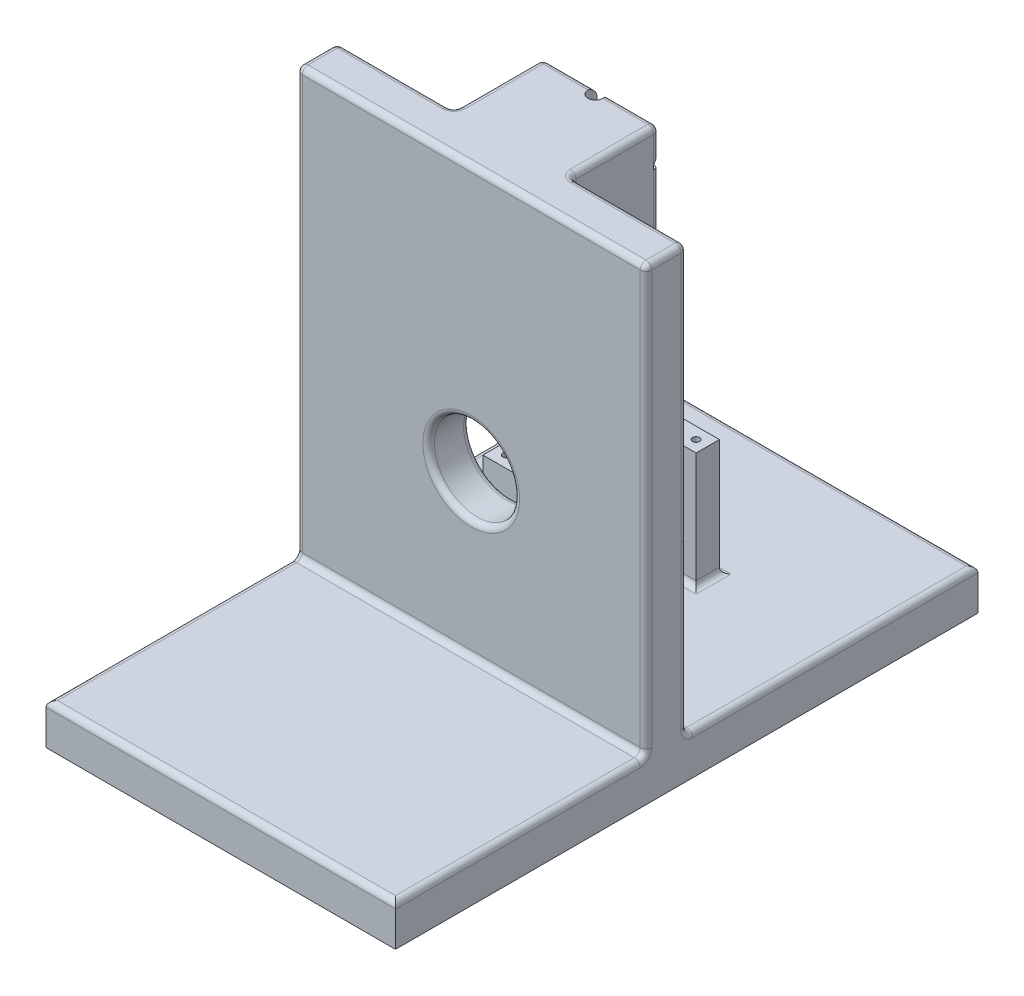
ISO-10303-21;
HEADER;
FILE_DESCRIPTION(('STEP AP214'),'2;1');
FILE_NAME('part.step','',(''),(''),'','','');
FILE_SCHEMA(('AUTOMOTIVE_DESIGN { 1 0 10303 214 1 1 1 1 }'));
ENDSEC;
DATA;
#1=APPLICATION_CONTEXT('core data for automotive mechanical design processes');
#2=APPLICATION_PROTOCOL_DEFINITION('international standard','automotive_design',2000,#1);
#3=PRODUCT_CONTEXT('',#1,'mechanical');
#4=PRODUCT('Part','Part','',(#3));
#5=PRODUCT_RELATED_PRODUCT_CATEGORY('part','',(#4));
#6=PRODUCT_DEFINITION_FORMATION('','',#4);
#7=PRODUCT_DEFINITION_CONTEXT('part definition',#1,'design');
#8=PRODUCT_DEFINITION('design','',#6,#7);
#9=PRODUCT_DEFINITION_SHAPE('','',#8);
#10=(LENGTH_UNIT() NAMED_UNIT(*) SI_UNIT(.MILLI.,.METRE.));
#11=(NAMED_UNIT(*) PLANE_ANGLE_UNIT() SI_UNIT($,.RADIAN.));
#12=(NAMED_UNIT(*) SI_UNIT($,.STERADIAN.) SOLID_ANGLE_UNIT());
#13=UNCERTAINTY_MEASURE_WITH_UNIT(LENGTH_MEASURE(1.E-05),#10,'distance_accuracy_value','');
#14=(GEOMETRIC_REPRESENTATION_CONTEXT(3) GLOBAL_UNCERTAINTY_ASSIGNED_CONTEXT((#13)) GLOBAL_UNIT_ASSIGNED_CONTEXT((#10,
#11,#12)) REPRESENTATION_CONTEXT('',''));
#15=CARTESIAN_POINT('',(0.,0.,0.));
#16=DIRECTION('',(0.,0.,1.));
#17=DIRECTION('',(1.,0.,0.));
#18=AXIS2_PLACEMENT_3D('',#15,#16,#17);
#19=CARTESIAN_POINT('',(-99.9999999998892,140.,-188.00691258));
#20=DIRECTION('',(0.,0.,-1.));
#21=DIRECTION('',(-1.,0.,0.));
#22=AXIS2_PLACEMENT_3D('',#19,#20,#21);
#23=PLANE('',#22);
#24=DIRECTION('',(0.,1.,0.));
#25=VECTOR('',#24,1.);
#26=CARTESIAN_POINT('',(-89.9999999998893,140.,-188.00691258));
#27=LINE('',#26,#25);
#28=CARTESIAN_POINT('',(-89.9999999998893,150.,-188.00691258));
#29=VERTEX_POINT('',#28);
#30=CARTESIAN_POINT('',(-89.9999999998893,335.271296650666,-188.00691258));
#31=VERTEX_POINT('',#30);
#32=EDGE_CURVE('E968',#29,#31,#27,.T.);
#33=ORIENTED_EDGE('',*,*,#32,.T.);
#34=DIRECTION('',(-1.,0.,0.));
#35=VECTOR('',#34,1.);
#36=CARTESIAN_POINT('',(-35.0000000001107,335.271296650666,-188.00691258));
#37=LINE('',#36,#35);
#38=CARTESIAN_POINT('',(-50.0999999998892,335.271296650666,-188.00691258));
#39=VERTEX_POINT('',#38);
#40=EDGE_CURVE('E58',#31,#39,#37,.F.);
#41=ORIENTED_EDGE('',*,*,#40,.T.);
#42=DIRECTION('',(0.,1.,0.));
#43=VECTOR('',#42,1.);
#44=CARTESIAN_POINT('',(-50.0999999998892,140.,-188.00691258));
#45=LINE('',#44,#43);
#46=CARTESIAN_POINT('',(-50.0999999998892,150.,-188.00691258));
#47=VERTEX_POINT('',#46);
#48=EDGE_CURVE('E590',#47,#39,#45,.T.);
#49=ORIENTED_EDGE('',*,*,#48,.F.);
#50=DIRECTION('',(-1.,0.,0.));
#51=VECTOR('',#50,1.);
#52=CARTESIAN_POINT('',(-99.9999999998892,150.,-188.00691258));
#53=LINE('',#52,#51);
#54=EDGE_CURVE('E970',#47,#29,#53,.T.);
#55=ORIENTED_EDGE('',*,*,#54,.T.);
#56=EDGE_LOOP('',(#33,#41,#49,#55));
#57=FACE_BOUND('',#56,.T.);
#58=ADVANCED_FACE('F37',(#57),#23,.T.);
#59=CARTESIAN_POINT('',(-50.0999999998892,349.413432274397,-188.00691258));
#60=VERTEX_POINT('',#59);
#61=CARTESIAN_POINT('',(-50.0999999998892,355.,-188.00691258));
#62=VERTEX_POINT('',#61);
#63=EDGE_CURVE('E594',#60,#62,#45,.T.);
#64=ORIENTED_EDGE('',*,*,#63,.F.);
#65=DIRECTION('',(-1.,0.,0.));
#66=VECTOR('',#65,1.);
#67=CARTESIAN_POINT('',(-35.0000000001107,349.413432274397,-188.00691258));
#68=LINE('',#67,#66);
#69=CARTESIAN_POINT('',(-89.9999999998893,349.413432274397,-188.00691258));
#70=VERTEX_POINT('',#69);
#71=EDGE_CURVE('E1021',#60,#70,#68,.T.);
#72=ORIENTED_EDGE('',*,*,#71,.T.);
#73=CARTESIAN_POINT('',(-89.9999999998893,390.,-188.00691258));
#74=VERTEX_POINT('',#73);
#75=EDGE_CURVE('E412',#70,#74,#27,.T.);
#76=ORIENTED_EDGE('',*,*,#75,.T.);
#77=DIRECTION('',(-1.,0.,0.));
#78=VECTOR('',#77,1.);
#79=CARTESIAN_POINT('',(100.000000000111,390.,-188.00691258));
#80=LINE('',#79,#78);
#81=CARTESIAN_POINT('',(-7.50000000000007,390.,-188.00691258));
#82=VERTEX_POINT('',#81);
#83=EDGE_CURVE('E965',#74,#82,#80,.F.);
#84=ORIENTED_EDGE('',*,*,#83,.T.);
#85=DIRECTION('',(0.,1.,0.));
#86=VECTOR('',#85,1.);
#87=CARTESIAN_POINT('',(-7.50000000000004,355.,-188.00691258));
#88=LINE('',#87,#86);
#89=CARTESIAN_POINT('',(-7.50000000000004,355.,-188.00691258));
#90=VERTEX_POINT('',#89);
#91=EDGE_CURVE('E579',#90,#82,#88,.T.);
#92=ORIENTED_EDGE('',*,*,#91,.F.);
#93=DIRECTION('',(-1.,0.,0.));
#94=VECTOR('',#93,1.);
#95=CARTESIAN_POINT('',(-50.0999999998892,355.,-188.00691258));
#96=LINE('',#95,#94);
#97=EDGE_CURVE('E505',#90,#62,#96,.T.);
#98=ORIENTED_EDGE('',*,*,#97,.T.);
#99=EDGE_LOOP('',(#64,#72,#76,#84,#92,#98));
#100=FACE_BOUND('',#99,.T.);
#101=ADVANCED_FACE('F547',(#100),#23,.T.);
#102=CARTESIAN_POINT('',(1.10758624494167E-10,140.,-188.00691258));
#103=DIRECTION('',(0.,1.,0.));
#104=DIRECTION('',(0.,0.,1.));
#105=AXIS2_PLACEMENT_3D('',#102,#103,#104);
#106=CYLINDRICAL_SURFACE('',#105,50.1);
#107=ORIENTED_EDGE('',*,*,#48,.T.);
#108=CARTESIAN_POINT('',(-50.0999999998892,335.271296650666,-188.00691258));
#109=CARTESIAN_POINT('',(-50.1000118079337,335.201544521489,-187.809695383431));
#110=CARTESIAN_POINT('',(-50.098836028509,335.140088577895,-187.609547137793));
#111=CARTESIAN_POINT('',(-50.0939850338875,335.03410661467,-187.204858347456));
#112=CARTESIAN_POINT('',(-50.0903099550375,334.989579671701,-187.000318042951));
#113=CARTESIAN_POINT('',(-50.0803415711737,334.917824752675,-186.588517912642));
#114=CARTESIAN_POINT('',(-50.0740511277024,334.890577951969,-186.38126129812));
#115=CARTESIAN_POINT('',(-50.0588163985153,334.853474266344,-185.965297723));
#116=CARTESIAN_POINT('',(-50.0498721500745,334.843617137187,-185.756590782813));
#117=CARTESIAN_POINT('',(-50.0293591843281,334.841335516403,-185.339160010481));
#118=CARTESIAN_POINT('',(-50.0177898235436,334.848915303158,-185.130436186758));
#119=CARTESIAN_POINT('',(-49.9921290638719,334.88143226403,-184.714424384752));
#120=CARTESIAN_POINT('',(-49.9780367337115,334.906375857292,-184.507136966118));
#121=CARTESIAN_POINT('',(-49.9475165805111,334.973394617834,-184.095629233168));
#122=CARTESIAN_POINT('',(-49.9310898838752,335.015461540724,-183.891407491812));
#123=CARTESIAN_POINT('',(-49.8961317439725,335.116409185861,-183.48726729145));
#124=CARTESIAN_POINT('',(-49.8775995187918,335.175296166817,-183.287350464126));
#125=CARTESIAN_POINT('',(-49.8386509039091,335.309730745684,-182.892380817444));
#126=CARTESIAN_POINT('',(-49.8182264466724,335.385351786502,-182.697353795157));
#127=CARTESIAN_POINT('',(-49.7759171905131,335.552573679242,-182.31435551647));
#128=CARTESIAN_POINT('',(-49.7540318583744,335.644180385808,-182.126386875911));
#129=CARTESIAN_POINT('',(-49.709213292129,335.842703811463,-181.758841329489));
#130=CARTESIAN_POINT('',(-49.6862800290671,335.949620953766,-181.57926465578));
#131=CARTESIAN_POINT('',(-49.6398081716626,336.178024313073,-181.229705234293));
#132=CARTESIAN_POINT('',(-49.6162695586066,336.299510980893,-181.059722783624));
#133=CARTESIAN_POINT('',(-49.5687529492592,336.557878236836,-180.728375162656));
#134=CARTESIAN_POINT('',(-49.544773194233,336.694936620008,-180.56714883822));
#135=CARTESIAN_POINT('',(-49.4971787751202,336.982212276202,-180.256819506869));
#136=CARTESIAN_POINT('',(-49.473564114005,337.132429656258,-180.107716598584));
#137=CARTESIAN_POINT('',(-49.4272106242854,337.444997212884,-179.822677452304));
#138=CARTESIAN_POINT('',(-49.4044717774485,337.607347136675,-179.686740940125));
#139=CARTESIAN_POINT('',(-49.360374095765,337.943072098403,-179.42900090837));
#140=CARTESIAN_POINT('',(-49.3390152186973,338.116446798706,-179.307196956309));
#141=CARTESIAN_POINT('',(-49.2981246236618,338.473364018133,-179.078393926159));
#142=CARTESIAN_POINT('',(-49.2785963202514,338.656924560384,-178.971422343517));
#143=CARTESIAN_POINT('',(-49.2418744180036,339.03257119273,-178.773389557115));
#144=CARTESIAN_POINT('',(-49.2246799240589,339.22465397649,-178.682322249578));
#145=CARTESIAN_POINT('',(-49.1930222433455,339.616113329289,-178.516724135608));
#146=CARTESIAN_POINT('',(-49.1785599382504,339.815492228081,-178.442198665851));
#147=CARTESIAN_POINT('',(-49.1527313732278,340.219966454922,-178.310340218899));
#148=CARTESIAN_POINT('',(-49.1413638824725,340.425059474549,-178.253000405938));
#149=CARTESIAN_POINT('',(-49.1221454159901,340.836398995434,-178.156673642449));
#150=CARTESIAN_POINT('',(-49.1142439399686,341.042581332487,-178.117422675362));
#151=CARTESIAN_POINT('',(-49.1019049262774,341.457535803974,-178.056339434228));
#152=CARTESIAN_POINT('',(-49.0974660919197,341.666306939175,-178.034500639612));
#153=CARTESIAN_POINT('',(-49.0921563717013,342.085009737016,-178.008394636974));
#154=CARTESIAN_POINT('',(-49.0912858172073,342.294941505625,-178.004129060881));
#155=CARTESIAN_POINT('',(-49.093135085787,342.714407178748,-178.013209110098));
#156=CARTESIAN_POINT('',(-49.0958548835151,342.923941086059,-178.026554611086));
#157=CARTESIAN_POINT('',(-49.104754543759,343.338142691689,-178.07043575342));
#158=CARTESIAN_POINT('',(-49.110885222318,343.54283738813,-178.1007270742));
#159=CARTESIAN_POINT('',(-49.1264279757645,343.948975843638,-178.178096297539));
#160=CARTESIAN_POINT('',(-49.1358411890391,344.150418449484,-178.225180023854));
#161=CARTESIAN_POINT('',(-49.1577231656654,344.548505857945,-178.335748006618));
#162=CARTESIAN_POINT('',(-49.1701909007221,344.745152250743,-178.399226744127));
#163=CARTESIAN_POINT('',(-49.1978995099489,345.132439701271,-178.542136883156));
#164=CARTESIAN_POINT('',(-49.2131414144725,345.323078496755,-178.621574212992));
#165=CARTESIAN_POINT('',(-49.2461398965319,345.698031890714,-178.796285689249));
#166=CARTESIAN_POINT('',(-49.2639100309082,345.88230526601,-178.8916457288));
#167=CARTESIAN_POINT('',(-49.3015057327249,346.242227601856,-179.097229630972));
#168=CARTESIAN_POINT('',(-49.3213320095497,346.417873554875,-179.207458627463));
#169=CARTESIAN_POINT('',(-49.3625954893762,346.759297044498,-179.441964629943));
#170=CARTESIAN_POINT('',(-49.3840325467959,346.925075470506,-179.566240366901));
#171=CARTESIAN_POINT('',(-49.4280574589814,347.245699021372,-179.827991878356));
#172=CARTESIAN_POINT('',(-49.4506453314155,347.400543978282,-179.965467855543));
#173=CARTESIAN_POINT('',(-49.4969108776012,347.700979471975,-180.255285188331));
#174=CARTESIAN_POINT('',(-49.5206008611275,347.846352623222,-180.407850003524));
#175=CARTESIAN_POINT('',(-49.5681700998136,348.123691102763,-180.724595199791));
#176=CARTESIAN_POINT('',(-49.5920492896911,348.255660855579,-180.888771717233));
#177=CARTESIAN_POINT('',(-49.6395204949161,348.505394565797,-181.227731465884));
#178=CARTESIAN_POINT('',(-49.6631123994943,348.623153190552,-181.402518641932));
#179=CARTESIAN_POINT('',(-49.7095177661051,348.843547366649,-181.761389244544));
#180=CARTESIAN_POINT('',(-49.7323315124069,348.946188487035,-181.945469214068));
#181=CARTESIAN_POINT('',(-49.7769199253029,349.13640458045,-182.323191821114));
#182=CARTESIAN_POINT('',(-49.7986851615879,349.223856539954,-182.516897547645));
#183=CARTESIAN_POINT('',(-49.8405671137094,349.382032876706,-182.911116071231));
#184=CARTESIAN_POINT('',(-49.8606844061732,349.452763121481,-183.111626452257));
#185=CARTESIAN_POINT('',(-49.8989278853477,349.57701387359,-183.518182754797));
#186=CARTESIAN_POINT('',(-49.9170532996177,349.630527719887,-183.724230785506));
#187=CARTESIAN_POINT('',(-49.9510050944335,349.719874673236,-184.140305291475));
#188=CARTESIAN_POINT('',(-49.9668315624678,349.755708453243,-184.350331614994));
#189=CARTESIAN_POINT('',(-49.9958243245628,349.809148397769,-184.77093004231));
#190=CARTESIAN_POINT('',(-50.009013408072,349.826916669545,-184.981479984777));
#191=CARTESIAN_POINT('',(-50.032756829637,349.844623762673,-185.403472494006));
#192=CARTESIAN_POINT('',(-50.0433112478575,349.844563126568,-185.61491503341));
#193=CARTESIAN_POINT('',(-50.0616989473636,349.826590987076,-186.036922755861));
#194=CARTESIAN_POINT('',(-50.0695352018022,349.808699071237,-186.247488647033));
#195=CARTESIAN_POINT('',(-50.082499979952,349.75520682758,-186.666360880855));
#196=CARTESIAN_POINT('',(-50.0876297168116,349.719614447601,-186.874668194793));
#197=CARTESIAN_POINT('',(-50.0943473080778,349.641590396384,-187.238125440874));
#198=CARTESIAN_POINT('',(-50.0964890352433,349.602834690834,-187.39406509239));
#199=CARTESIAN_POINT('',(-50.0993158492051,349.51547296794,-187.702872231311));
#200=CARTESIAN_POINT('',(-50.100003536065,349.466884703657,-187.855744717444));
#201=CARTESIAN_POINT('',(-50.0999999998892,349.413432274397,-188.00691258));
#202=B_SPLINE_CURVE_WITH_KNOTS('',3,(#108,#109,#110,#111,#112,#113,#114,#115,#116,#117,#118,
#119,#120,#121,#122,#123,#124,#125,#126,#127,#128,#129,#130,#131,#132,#133,#134,#135,#136,#137,
#138,#139,#140,#141,#142,#143,#144,#145,#146,#147,#148,#149,#150,#151,#152,#153,#154,#155,#156,
#157,#158,#159,#160,#161,#162,#163,#164,#165,#166,#167,#168,#169,#170,#171,#172,#173,#174,#175,
#176,#177,#178,#179,#180,#181,#182,#183,#184,#185,#186,#187,#188,#189,#190,#191,#192,#193,#194,
#195,#196,#197,#198,#199,#200,#201),.UNSPECIFIED.,.F.,.F.,(4,2,2,2,2,2,2,2,2,2,2,2,2,2,2,2,2,2,
2,2,2,2,2,2,2,2,2,2,2,2,2,2,2,2,2,2,2,2,2,2,2,2,2,2,2,2,4),(0.,0.627376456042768,
1.25471868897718,1.88137632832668,2.50802516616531,3.13482777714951,3.76186223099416,
4.38859514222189,5.01556156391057,5.64533622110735,6.27534201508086,6.90536522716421,
7.53540793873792,8.17354892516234,8.81169510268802,9.44982798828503,10.0879413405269,
10.7272222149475,11.3662572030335,12.005498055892,12.6444843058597,13.2738233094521,
13.9029265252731,14.5320881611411,15.1612453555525,15.781556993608,16.4020839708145,
17.0224023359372,17.6429515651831,18.266963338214,18.8911911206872,19.5153625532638,
20.1395435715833,20.7749866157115,21.4102192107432,22.045689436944,22.6809249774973,
23.3210868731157,23.96102380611,24.6012080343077,25.2413678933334,25.8757313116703,
26.510075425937,27.1437234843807,27.7770872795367,28.2588567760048,28.7397640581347),.UNSPECIFIED.);
#203=EDGE_CURVE('E1015',#39,#60,#202,.T.);
#204=ORIENTED_EDGE('',*,*,#203,.T.);
#205=ORIENTED_EDGE('',*,*,#63,.T.);
#206=CARTESIAN_POINT('',(1.10758624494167E-10,355.,-188.00691258));
#207=DIRECTION('',(0.,-1.,0.));
#208=DIRECTION('',(0.,0.,-1.));
#209=AXIS2_PLACEMENT_3D('',#206,#207,#208);
#210=CIRCLE('',#209,50.1);
#211=CARTESIAN_POINT('',(50.1000000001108,355.,-188.00691258));
#212=VERTEX_POINT('',#211);
#213=EDGE_CURVE('E914',#212,#62,#210,.T.);
#214=ORIENTED_EDGE('',*,*,#213,.F.);
#215=DIRECTION('',(0.,1.,0.));
#216=VECTOR('',#215,1.);
#217=CARTESIAN_POINT('',(50.1000000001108,140.,-188.00691258));
#218=LINE('',#217,#216);
#219=CARTESIAN_POINT('',(50.1000000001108,349.413432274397,-188.00691258));
#220=VERTEX_POINT('',#219);
#221=EDGE_CURVE('E589',#220,#212,#218,.T.);
#222=ORIENTED_EDGE('',*,*,#221,.F.);
#223=CARTESIAN_POINT('',(50.1000000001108,335.271296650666,-188.00691258));
#224=CARTESIAN_POINT('',(50.1000118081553,335.201544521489,-187.809695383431));
#225=CARTESIAN_POINT('',(50.0988360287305,335.140088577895,-187.609547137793));
#226=CARTESIAN_POINT('',(50.093985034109,335.03410661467,-187.204858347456));
#227=CARTESIAN_POINT('',(50.090309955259,334.989579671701,-187.000318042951));
#228=CARTESIAN_POINT('',(50.0803415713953,334.917824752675,-186.588517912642));
#229=CARTESIAN_POINT('',(50.0740511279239,334.890577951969,-186.38126129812));
#230=CARTESIAN_POINT('',(50.0588163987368,334.853474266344,-185.965297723));
#231=CARTESIAN_POINT('',(50.049872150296,334.843617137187,-185.756590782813));
#232=CARTESIAN_POINT('',(50.0293591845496,334.841335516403,-185.339160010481));
#233=CARTESIAN_POINT('',(50.0177898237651,334.848915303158,-185.130436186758));
#234=CARTESIAN_POINT('',(49.9921290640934,334.88143226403,-184.714424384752));
#235=CARTESIAN_POINT('',(49.978036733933,334.906375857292,-184.507136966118));
#236=CARTESIAN_POINT('',(49.9475165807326,334.973394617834,-184.095629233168));
#237=CARTESIAN_POINT('',(49.9310898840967,335.015461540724,-183.891407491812));
#238=CARTESIAN_POINT('',(49.8961317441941,335.116409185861,-183.48726729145));
#239=CARTESIAN_POINT('',(49.8775995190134,335.175296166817,-183.287350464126));
#240=CARTESIAN_POINT('',(49.8386509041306,335.309730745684,-182.892380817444));
#241=CARTESIAN_POINT('',(49.8182264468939,335.385351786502,-182.697353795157));
#242=CARTESIAN_POINT('',(49.7759171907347,335.552573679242,-182.31435551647));
#243=CARTESIAN_POINT('',(49.754031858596,335.644180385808,-182.126386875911));
#244=CARTESIAN_POINT('',(49.7092132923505,335.842703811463,-181.758841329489));
#245=CARTESIAN_POINT('',(49.6862800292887,335.949620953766,-181.57926465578));
#246=CARTESIAN_POINT('',(49.6398081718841,336.178024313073,-181.229705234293));
#247=CARTESIAN_POINT('',(49.6162695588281,336.299510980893,-181.059722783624));
#248=CARTESIAN_POINT('',(49.5687529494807,336.557878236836,-180.728375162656));
#249=CARTESIAN_POINT('',(49.5447731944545,336.694936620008,-180.56714883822));
#250=CARTESIAN_POINT('',(49.4971787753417,336.982212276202,-180.256819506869));
#251=CARTESIAN_POINT('',(49.4735641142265,337.132429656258,-180.107716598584));
#252=CARTESIAN_POINT('',(49.4272106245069,337.444997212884,-179.822677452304));
#253=CARTESIAN_POINT('',(49.4044717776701,337.607347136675,-179.686740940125));
#254=CARTESIAN_POINT('',(49.3603740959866,337.943072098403,-179.42900090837));
#255=CARTESIAN_POINT('',(49.3390152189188,338.116446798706,-179.307196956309));
#256=CARTESIAN_POINT('',(49.2981246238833,338.473364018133,-179.078393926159));
#257=CARTESIAN_POINT('',(49.2785963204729,338.656924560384,-178.971422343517));
#258=CARTESIAN_POINT('',(49.2418744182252,339.03257119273,-178.773389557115));
#259=CARTESIAN_POINT('',(49.2246799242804,339.22465397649,-178.682322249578));
#260=CARTESIAN_POINT('',(49.193022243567,339.616113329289,-178.516724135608));
#261=CARTESIAN_POINT('',(49.1785599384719,339.815492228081,-178.442198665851));
#262=CARTESIAN_POINT('',(49.1527313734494,340.219966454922,-178.310340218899));
#263=CARTESIAN_POINT('',(49.141363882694,340.425059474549,-178.253000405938));
#264=CARTESIAN_POINT('',(49.1221454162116,340.836398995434,-178.156673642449));
#265=CARTESIAN_POINT('',(49.1142439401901,341.042581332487,-178.117422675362));
#266=CARTESIAN_POINT('',(49.1019049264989,341.457535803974,-178.056339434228));
#267=CARTESIAN_POINT('',(49.0974660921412,341.666306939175,-178.034500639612));
#268=CARTESIAN_POINT('',(49.0921563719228,342.085009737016,-178.008394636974));
#269=CARTESIAN_POINT('',(49.0912858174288,342.294941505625,-178.004129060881));
#270=CARTESIAN_POINT('',(49.0931350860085,342.714407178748,-178.013209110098));
#271=CARTESIAN_POINT('',(49.0958548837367,342.923941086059,-178.026554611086));
#272=CARTESIAN_POINT('',(49.1047545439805,343.338142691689,-178.07043575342));
#273=CARTESIAN_POINT('',(49.1108852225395,343.54283738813,-178.1007270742));
#274=CARTESIAN_POINT('',(49.126427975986,343.948975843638,-178.178096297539));
#275=CARTESIAN_POINT('',(49.1358411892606,344.150418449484,-178.225180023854));
#276=CARTESIAN_POINT('',(49.157723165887,344.548505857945,-178.335748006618));
#277=CARTESIAN_POINT('',(49.1701909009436,344.745152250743,-178.399226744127));
#278=CARTESIAN_POINT('',(49.1978995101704,345.132439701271,-178.542136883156));
#279=CARTESIAN_POINT('',(49.213141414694,345.323078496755,-178.621574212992));
#280=CARTESIAN_POINT('',(49.2461398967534,345.698031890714,-178.796285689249));
#281=CARTESIAN_POINT('',(49.2639100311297,345.88230526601,-178.8916457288));
#282=CARTESIAN_POINT('',(49.3015057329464,346.242227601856,-179.097229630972));
#283=CARTESIAN_POINT('',(49.3213320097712,346.417873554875,-179.207458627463));
#284=CARTESIAN_POINT('',(49.3625954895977,346.759297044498,-179.441964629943));
#285=CARTESIAN_POINT('',(49.3840325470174,346.925075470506,-179.566240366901));
#286=CARTESIAN_POINT('',(49.4280574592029,347.245699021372,-179.827991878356));
#287=CARTESIAN_POINT('',(49.450645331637,347.400543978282,-179.965467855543));
#288=CARTESIAN_POINT('',(49.4969108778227,347.700979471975,-180.255285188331));
#289=CARTESIAN_POINT('',(49.520600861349,347.846352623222,-180.407850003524));
#290=CARTESIAN_POINT('',(49.5681701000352,348.123691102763,-180.724595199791));
#291=CARTESIAN_POINT('',(49.5920492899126,348.255660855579,-180.888771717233));
#292=CARTESIAN_POINT('',(49.6395204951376,348.505394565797,-181.227731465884));
#293=CARTESIAN_POINT('',(49.6631123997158,348.623153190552,-181.402518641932));
#294=CARTESIAN_POINT('',(49.7095177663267,348.843547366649,-181.761389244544));
#295=CARTESIAN_POINT('',(49.7323315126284,348.946188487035,-181.945469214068));
#296=CARTESIAN_POINT('',(49.7769199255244,349.13640458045,-182.323191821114));
#297=CARTESIAN_POINT('',(49.7986851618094,349.223856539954,-182.516897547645));
#298=CARTESIAN_POINT('',(49.8405671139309,349.382032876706,-182.911116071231));
#299=CARTESIAN_POINT('',(49.8606844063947,349.452763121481,-183.111626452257));
#300=CARTESIAN_POINT('',(49.8989278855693,349.57701387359,-183.518182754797));
#301=CARTESIAN_POINT('',(49.9170532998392,349.630527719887,-183.724230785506));
#302=CARTESIAN_POINT('',(49.951005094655,349.719874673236,-184.140305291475));
#303=CARTESIAN_POINT('',(49.9668315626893,349.755708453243,-184.350331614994));
#304=CARTESIAN_POINT('',(49.9958243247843,349.809148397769,-184.77093004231));
#305=CARTESIAN_POINT('',(50.0090134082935,349.826916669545,-184.981479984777));
#306=CARTESIAN_POINT('',(50.0327568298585,349.844623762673,-185.403472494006));
#307=CARTESIAN_POINT('',(50.043311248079,349.844563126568,-185.61491503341));
#308=CARTESIAN_POINT('',(50.0616989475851,349.826590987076,-186.036922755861));
#309=CARTESIAN_POINT('',(50.0695352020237,349.808699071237,-186.247488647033));
#310=CARTESIAN_POINT('',(50.0824999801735,349.75520682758,-186.666360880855));
#311=CARTESIAN_POINT('',(50.0876297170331,349.719614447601,-186.874668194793));
#312=CARTESIAN_POINT('',(50.0943473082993,349.641590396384,-187.238125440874));
#313=CARTESIAN_POINT('',(50.0964890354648,349.602834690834,-187.39406509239));
#314=CARTESIAN_POINT('',(50.0993158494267,349.51547296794,-187.702872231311));
#315=CARTESIAN_POINT('',(50.1000035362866,349.466884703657,-187.855744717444));
#316=CARTESIAN_POINT('',(50.1000000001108,349.413432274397,-188.00691258));
#317=B_SPLINE_CURVE_WITH_KNOTS('',3,(#223,#224,#225,#226,#227,#228,#229,#230,#231,#232,#233,
#234,#235,#236,#237,#238,#239,#240,#241,#242,#243,#244,#245,#246,#247,#248,#249,#250,#251,#252,
#253,#254,#255,#256,#257,#258,#259,#260,#261,#262,#263,#264,#265,#266,#267,#268,#269,#270,#271,
#272,#273,#274,#275,#276,#277,#278,#279,#280,#281,#282,#283,#284,#285,#286,#287,#288,#289,#290,
#291,#292,#293,#294,#295,#296,#297,#298,#299,#300,#301,#302,#303,#304,#305,#306,#307,#308,#309,
#310,#311,#312,#313,#314,#315,#316),.UNSPECIFIED.,.F.,.F.,(4,2,2,2,2,2,2,2,2,2,2,2,2,2,2,2,2,2,
2,2,2,2,2,2,2,2,2,2,2,2,2,2,2,2,2,2,2,2,2,2,2,2,2,2,2,2,4),(0.,0.627376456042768,
1.25471868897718,1.88137632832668,2.50802516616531,3.13482777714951,3.76186223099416,
4.38859514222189,5.01556156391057,5.64533622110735,6.27534201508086,6.90536522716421,
7.53540793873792,8.17354892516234,8.81169510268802,9.44982798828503,10.0879413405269,
10.7272222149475,11.3662572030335,12.005498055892,12.6444843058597,13.2738233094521,
13.9029265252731,14.5320881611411,15.1612453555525,15.781556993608,16.4020839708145,
17.0224023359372,17.6429515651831,18.266963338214,18.8911911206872,19.5153625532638,
20.1395435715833,20.7749866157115,21.4102192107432,22.045689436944,22.6809249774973,
23.3210868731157,23.96102380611,24.6012080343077,25.2413678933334,25.8757313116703,
26.510075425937,27.1437234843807,27.7770872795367,28.2588567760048,28.7397640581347),.UNSPECIFIED.);
#318=CARTESIAN_POINT('',(50.1000000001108,335.271296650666,-188.00691258));
#319=VERTEX_POINT('',#318);
#320=EDGE_CURVE('E567',#319,#220,#317,.T.);
#321=ORIENTED_EDGE('',*,*,#320,.F.);
#322=CARTESIAN_POINT('',(50.1000000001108,150.,-188.00691258));
#323=VERTEX_POINT('',#322);
#324=EDGE_CURVE('E595',#323,#319,#218,.T.);
#325=ORIENTED_EDGE('',*,*,#324,.F.);
#326=CARTESIAN_POINT('',(50.1000000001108,150.,-188.00691258));
#327=CARTESIAN_POINT('',(50.0999821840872,149.718850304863,-188.006942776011));
#328=CARTESIAN_POINT('',(50.0999994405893,149.437704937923,-187.995057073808));
#329=CARTESIAN_POINT('',(50.0999753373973,148.877423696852,-187.94767193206));
#330=CARTESIAN_POINT('',(50.0999339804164,148.598287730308,-187.912173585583));
#331=CARTESIAN_POINT('',(50.0996640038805,148.044189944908,-187.817813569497));
#332=CARTESIAN_POINT('',(50.0994355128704,147.769225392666,-187.758967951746));
#333=CARTESIAN_POINT('',(50.0985427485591,147.225229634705,-187.618341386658));
#334=CARTESIAN_POINT('',(50.0978784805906,146.95619835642,-187.536560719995));
#335=CARTESIAN_POINT('',(50.0957870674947,146.425841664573,-187.3505949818));
#336=CARTESIAN_POINT('',(50.0943595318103,146.164520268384,-187.24639845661));
#337=CARTESIAN_POINT('',(50.0903389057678,145.65158928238,-187.016370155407));
#338=CARTESIAN_POINT('',(50.0877458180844,145.39997967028,-186.890538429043));
#339=CARTESIAN_POINT('',(50.0809337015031,144.908307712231,-186.618163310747));
#340=CARTESIAN_POINT('',(50.076714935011,144.668243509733,-186.471623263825));
#341=CARTESIAN_POINT('',(50.0661484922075,144.201339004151,-186.158874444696));
#342=CARTESIAN_POINT('',(50.0598008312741,143.974498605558,-185.992665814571));
#343=CARTESIAN_POINT('',(50.0444632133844,143.536034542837,-185.642081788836));
#344=CARTESIAN_POINT('',(50.0354776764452,143.324386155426,-185.457737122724));
#345=CARTESIAN_POINT('',(50.0143338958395,142.91740704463,-185.072001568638));
#346=CARTESIAN_POINT('',(50.0021756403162,142.722076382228,-184.870610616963));
#347=CARTESIAN_POINT('',(49.9741778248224,142.349123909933,-184.452269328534));
#348=CARTESIAN_POINT('',(49.9583381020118,142.171502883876,-184.235318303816));
#349=CARTESIAN_POINT('',(49.9225098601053,141.835244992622,-183.787498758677));
#350=CARTESIAN_POINT('',(49.9025214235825,141.676607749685,-183.55663051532));
#351=CARTESIAN_POINT('',(49.8581393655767,141.380430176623,-183.084331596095));
#352=CARTESIAN_POINT('',(49.8337765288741,141.242754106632,-182.842983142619));
#353=CARTESIAN_POINT('',(49.7802361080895,140.98813654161,-182.350098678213));
#354=CARTESIAN_POINT('',(49.7510584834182,140.871195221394,-182.098562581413));
#355=CARTESIAN_POINT('',(49.6876659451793,140.658809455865,-181.58724229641));
#356=CARTESIAN_POINT('',(49.6534521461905,140.563360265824,-181.327459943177));
#357=CARTESIAN_POINT('',(49.5798823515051,140.394494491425,-180.801649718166));
#358=CARTESIAN_POINT('',(49.5405274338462,140.321073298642,-180.535623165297));
#359=CARTESIAN_POINT('',(49.440397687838,140.172502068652,-179.895285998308));
#360=CARTESIAN_POINT('',(49.37722463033,140.107661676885,-179.518880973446));
#361=CARTESIAN_POINT('',(49.2753789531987,140.042983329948,-178.952413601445));
#362=CARTESIAN_POINT('',(49.2402735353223,140.026854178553,-178.763399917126));
#363=CARTESIAN_POINT('',(49.1677654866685,140.005362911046,-178.385169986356));
#364=CARTESIAN_POINT('',(49.1303625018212,140.000002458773,-178.195953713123));
#365=CARTESIAN_POINT('',(49.0918526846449,140.,-178.00691258));
#366=B_SPLINE_CURVE_WITH_KNOTS('',3,(#326,#327,#328,#329,#330,#331,#332,#333,#334,#335,#336,
#337,#338,#339,#340,#341,#342,#343,#344,#345,#346,#347,#348,#349,#350,#351,#352,#353,#354,#355,
#356,#357,#358,#359,#360,#361,#362,#363,#364,#365),.UNSPECIFIED.,.F.,.F.,(4,2,2,2,2,2,2,2,2,2,2,
2,2,2,2,2,2,2,2,4),(0.,0.843191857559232,1.68634468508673,2.52891882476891,3.37148265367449,
4.21447802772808,5.05747146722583,5.90032889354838,6.74318023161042,7.58462727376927,
8.42607746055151,9.26756487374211,10.1090355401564,10.9448012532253,11.7805740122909,
12.6161620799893,13.4515752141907,14.6100276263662,15.1885309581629,15.7671236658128),.UNSPECIFIED.);
#367=CARTESIAN_POINT('',(49.0918526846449,140.,-178.00691258));
#368=VERTEX_POINT('',#367);
#369=EDGE_CURVE('E561',#323,#368,#366,.T.);
#370=ORIENTED_EDGE('',*,*,#369,.T.);
#371=CARTESIAN_POINT('',(1.10758624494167E-10,140.,-188.00691258));
#372=DIRECTION('',(0.,-1.,0.));
#373=DIRECTION('',(0.,0.,1.));
#374=AXIS2_PLACEMENT_3D('',#371,#372,#373);
#375=CIRCLE('',#374,50.1);
#376=CARTESIAN_POINT('',(-49.0918526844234,140.,-178.00691258));
#377=VERTEX_POINT('',#376);
#378=EDGE_CURVE('E586',#368,#377,#375,.T.);
#379=ORIENTED_EDGE('',*,*,#378,.T.);
#380=CARTESIAN_POINT('',(-49.0918526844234,140.,-178.00691258));
#381=CARTESIAN_POINT('',(-49.1479084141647,139.99996860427,-178.28198586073));
#382=CARTESIAN_POINT('',(-49.201610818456,140.011348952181,-178.557552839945));
#383=CARTESIAN_POINT('',(-49.3040799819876,140.056950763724,-179.107733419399));
#384=CARTESIAN_POINT('',(-49.3528463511,140.091174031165,-179.382346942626));
#385=CARTESIAN_POINT('',(-49.4451841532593,140.182458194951,-179.9285093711));
#386=CARTESIAN_POINT('',(-49.4887579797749,140.239508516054,-180.200059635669));
#387=CARTESIAN_POINT('',(-49.5706554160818,140.376221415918,-180.738201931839));
#388=CARTESIAN_POINT('',(-49.6089793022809,140.455882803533,-181.004794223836));
#389=CARTESIAN_POINT('',(-49.6804542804,140.637515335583,-181.531331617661));
#390=CARTESIAN_POINT('',(-49.7135993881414,140.739511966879,-181.791268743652));
#391=CARTESIAN_POINT('',(-49.7748166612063,140.965147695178,-182.302192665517));
#392=CARTESIAN_POINT('',(-49.8028888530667,141.088786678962,-182.553179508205));
#393=CARTESIAN_POINT('',(-49.8542105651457,141.35685016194,-183.044190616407));
#394=CARTESIAN_POINT('',(-49.8774618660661,141.501266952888,-183.284218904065));
#395=CARTESIAN_POINT('',(-49.9195069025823,141.809929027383,-183.751576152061));
#396=CARTESIAN_POINT('',(-49.9383007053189,141.974174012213,-183.978905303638));
#397=CARTESIAN_POINT('',(-49.9716855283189,142.319544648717,-184.416871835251));
#398=CARTESIAN_POINT('',(-49.9863178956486,142.500478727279,-184.627657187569));
#399=CARTESIAN_POINT('',(-50.0121037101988,142.879370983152,-185.033556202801));
#400=CARTESIAN_POINT('',(-50.0232571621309,143.077329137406,-185.22866988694));
#401=CARTESIAN_POINT('',(-50.0425883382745,143.48893339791,-185.601858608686));
#402=CARTESIAN_POINT('',(-50.0507652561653,143.702583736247,-185.779929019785));
#403=CARTESIAN_POINT('',(-50.0646524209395,144.14401940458,-186.117691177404));
#404=CARTESIAN_POINT('',(-50.0703626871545,144.371804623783,-186.277383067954));
#405=CARTESIAN_POINT('',(-50.0798433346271,144.840958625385,-186.577924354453));
#406=CARTESIAN_POINT('',(-50.0836049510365,145.082383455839,-186.718686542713));
#407=CARTESIAN_POINT('',(-50.0896346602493,145.576178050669,-186.979525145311));
#408=CARTESIAN_POINT('',(-50.0919027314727,145.828547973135,-187.099601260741));
#409=CARTESIAN_POINT('',(-50.0953850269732,146.342366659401,-187.318175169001));
#410=CARTESIAN_POINT('',(-50.0965996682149,146.603811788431,-187.416681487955));
#411=CARTESIAN_POINT('',(-50.0983533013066,147.133924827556,-187.591460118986));
#412=CARTESIAN_POINT('',(-50.0988924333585,147.402591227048,-187.66773704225));
#413=CARTESIAN_POINT('',(-50.099749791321,148.054773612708,-187.82368961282));
#414=CARTESIAN_POINT('',(-50.0998918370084,148.441002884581,-187.892382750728));
#415=CARTESIAN_POINT('',(-50.0999833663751,149.023873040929,-187.961082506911));
#416=CARTESIAN_POINT('',(-50.099993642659,149.218660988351,-187.978259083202));
#417=CARTESIAN_POINT('',(-50.1000004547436,149.608947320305,-188.001173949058));
#418=CARTESIAN_POINT('',(-50.0999969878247,149.804445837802,-188.006909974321));
#419=CARTESIAN_POINT('',(-50.0999999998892,150.,-188.00691258));
#420=B_SPLINE_CURVE_WITH_KNOTS('',3,(#380,#381,#382,#383,#384,#385,#386,#387,#388,#389,#390,
#391,#392,#393,#394,#395,#396,#397,#398,#399,#400,#401,#402,#403,#404,#405,#406,#407,#408,#409,
#410,#411,#412,#413,#414,#415,#416,#417,#418,#419),.UNSPECIFIED.,.F.,.F.,(4,2,2,2,2,2,2,2,2,2,2,
2,2,2,2,2,2,2,2,4),(0.,0.841960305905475,1.68398710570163,2.52562426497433,3.36721709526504,
4.20977532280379,5.05232914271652,5.89457119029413,6.73680055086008,7.57034341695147,
8.40388515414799,9.23765252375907,10.0714133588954,10.9088925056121,11.7463837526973,
12.5835433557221,13.4205291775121,14.5943030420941,15.1806543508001,15.7671216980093),.UNSPECIFIED.);
#421=EDGE_CURVE('E553',#377,#47,#420,.T.);
#422=ORIENTED_EDGE('',*,*,#421,.T.);
#423=EDGE_LOOP('',(#107,#204,#205,#214,#222,#321,#325,#370,#379,#422));
#424=FACE_BOUND('',#423,.T.);
#425=ADVANCED_FACE('F543',(#424),#106,.F.);
#426=CARTESIAN_POINT('',(-89.9999999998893,140.,-178.00691258));
#427=DIRECTION('',(0.,1.,0.));
#428=DIRECTION('',(0.,0.,1.));
#429=AXIS2_PLACEMENT_3D('',#426,#427,#428);
#430=CYLINDRICAL_SURFACE('',#429,10.);
#431=ORIENTED_EDGE('',*,*,#75,.F.);
#432=CARTESIAN_POINT('',(-89.9999999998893,349.413432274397,-188.00691258));
#433=CARTESIAN_POINT('',(-90.1606366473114,349.413415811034,-188.006916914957));
#434=CARTESIAN_POINT('',(-90.3212691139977,349.414800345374,-188.003042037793));
#435=CARTESIAN_POINT('',(-90.6421052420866,349.420250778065,-187.987567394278));
#436=CARTESIAN_POINT('',(-90.8023089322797,349.424316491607,-187.975968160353));
#437=CARTESIAN_POINT('',(-91.1217912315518,349.435005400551,-187.945087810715));
#438=CARTESIAN_POINT('',(-91.2810703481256,349.441627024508,-187.925811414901));
#439=CARTESIAN_POINT('',(-91.5983934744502,349.457188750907,-187.879645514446));
#440=CARTESIAN_POINT('',(-91.7564374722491,349.466128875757,-187.852755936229));
#441=CARTESIAN_POINT('',(-92.2278880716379,349.495970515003,-187.760830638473));
#442=CARTESIAN_POINT('',(-92.5389776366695,349.519906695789,-187.684502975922));
#443=CARTESIAN_POINT('',(-93.1519752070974,349.572600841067,-187.502560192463));
#444=CARTESIAN_POINT('',(-93.4538833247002,349.601358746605,-187.396945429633));
#445=CARTESIAN_POINT('',(-94.0030318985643,349.655312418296,-187.174804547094));
#446=CARTESIAN_POINT('',(-94.2518350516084,349.680417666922,-187.062101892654));
#447=CARTESIAN_POINT('',(-94.7395776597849,349.728182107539,-186.816618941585));
#448=CARTESIAN_POINT('',(-94.9785177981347,349.750841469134,-186.683840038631));
#449=CARTESIAN_POINT('',(-95.4447473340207,349.790490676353,-186.399125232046));
#450=CARTESIAN_POINT('',(-95.6720526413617,349.80748844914,-186.24721652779));
#451=CARTESIAN_POINT('',(-96.1137705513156,349.832442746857,-185.925023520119));
#452=CARTESIAN_POINT('',(-96.3281861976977,349.84040141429,-185.754743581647));
#453=CARTESIAN_POINT('',(-96.6963842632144,349.843326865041,-185.436836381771));
#454=CARTESIAN_POINT('',(-96.8530595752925,349.840785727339,-185.292572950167));
#455=CARTESIAN_POINT('',(-97.1566545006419,349.826331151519,-184.994580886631));
#456=CARTESIAN_POINT('',(-97.3035763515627,349.814419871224,-184.84085444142));
#457=CARTESIAN_POINT('',(-97.5866785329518,349.779522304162,-184.525135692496));
#458=CARTESIAN_POINT('',(-97.7228653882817,349.756542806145,-184.363148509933));
#459=CARTESIAN_POINT('',(-97.9836901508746,349.697884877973,-184.032280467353));
#460=CARTESIAN_POINT('',(-98.1083279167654,349.662206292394,-183.863399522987));
#461=CARTESIAN_POINT('',(-98.346256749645,349.576334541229,-183.519095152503));
#462=CARTESIAN_POINT('',(-98.4594402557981,349.526018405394,-183.343627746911));
#463=CARTESIAN_POINT('',(-98.6725686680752,349.409812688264,-182.989803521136));
#464=CARTESIAN_POINT('',(-98.7725135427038,349.343923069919,-182.811446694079));
#465=CARTESIAN_POINT('',(-98.9587684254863,349.195834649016,-182.454493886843));
#466=CARTESIAN_POINT('',(-99.0450850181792,349.113643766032,-182.275898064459));
#467=CARTESIAN_POINT('',(-99.204169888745,348.932641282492,-181.921123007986));
#468=CARTESIAN_POINT('',(-99.2769398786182,348.83383178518,-181.74494347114));
#469=CARTESIAN_POINT('',(-99.4004167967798,348.634327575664,-181.421292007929));
#470=CARTESIAN_POINT('',(-99.4527774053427,348.535705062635,-181.273166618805));
#471=CARTESIAN_POINT('',(-99.5482813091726,348.326606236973,-180.982434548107));
#472=CARTESIAN_POINT('',(-99.5914255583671,348.216131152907,-180.839827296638));
#473=CARTESIAN_POINT('',(-99.6692412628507,347.983918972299,-180.561642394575));
#474=CARTESIAN_POINT('',(-99.7039121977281,347.86218118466,-180.426065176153));
#475=CARTESIAN_POINT('',(-99.7656686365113,347.608200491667,-180.163284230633));
#476=CARTESIAN_POINT('',(-99.792753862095,347.475957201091,-180.036080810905));
#477=CARTESIAN_POINT('',(-99.840220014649,347.2024019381,-179.791710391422));
#478=CARTESIAN_POINT('',(-99.8606284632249,347.061130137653,-179.674503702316));
#479=CARTESIAN_POINT('',(-99.895914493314,346.769871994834,-179.45043225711));
#480=CARTESIAN_POINT('',(-99.9107897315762,346.619881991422,-179.343571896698));
#481=CARTESIAN_POINT('',(-99.936008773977,346.312138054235,-179.140999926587));
#482=CARTESIAN_POINT('',(-99.9463513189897,346.154381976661,-179.045291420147));
#483=CARTESIAN_POINT('',(-99.9634653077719,345.832092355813,-178.86569000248));
#484=CARTESIAN_POINT('',(-99.9702365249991,345.667558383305,-178.781797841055));
#485=CARTESIAN_POINT('',(-99.9815669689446,345.318303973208,-178.619681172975));
#486=CARTESIAN_POINT('',(-99.9858866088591,345.133062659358,-178.542560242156));
#487=CARTESIAN_POINT('',(-99.9923802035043,344.756939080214,-178.403388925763));
#488=CARTESIAN_POINT('',(-99.9945538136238,344.566055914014,-178.341340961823));
#489=CARTESIAN_POINT('',(-99.9975959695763,344.180119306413,-178.23279396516));
#490=CARTESIAN_POINT('',(-99.9984658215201,343.985070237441,-178.186279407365));
#491=CARTESIAN_POINT('',(-99.9995532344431,343.591944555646,-178.109030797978));
#492=CARTESIAN_POINT('',(-99.9997710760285,343.393869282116,-178.078289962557));
#493=CARTESIAN_POINT('',(-99.999960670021,343.053303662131,-178.039323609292));
#494=CARTESIAN_POINT('',(-99.9999852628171,342.911251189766,-178.027162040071));
#495=CARTESIAN_POINT('',(-99.999999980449,342.626924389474,-178.010961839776));
#496=CARTESIAN_POINT('',(-99.9999901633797,342.484650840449,-178.006909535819));
#497=CARTESIAN_POINT('',(-99.9999999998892,342.342364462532,-178.00691258));
#498=B_SPLINE_CURVE_WITH_KNOTS('',3,(#432,#433,#434,#435,#436,#437,#438,#439,#440,#441,#442,
#443,#444,#445,#446,#447,#448,#449,#450,#451,#452,#453,#454,#455,#456,#457,#458,#459,#460,#461,
#462,#463,#464,#465,#466,#467,#468,#469,#470,#471,#472,#473,#474,#475,#476,#477,#478,#479,#480,
#481,#482,#483,#484,#485,#486,#487,#488,#489,#490,#491,#492,#493,#494,#495,#496,#497),
.UNSPECIFIED.,.F.,.F.,(4,2,2,2,2,2,2,2,2,2,2,2,2,2,2,2,2,2,2,2,2,2,2,2,2,2,2,2,2,2,2,2,4),(0.,
0.481849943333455,0.963666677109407,1.44518764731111,1.92671327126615,2.88867047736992,
3.85061592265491,4.67259895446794,5.49452495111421,6.31529522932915,7.13587092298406,
7.7742687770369,8.41251965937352,9.05037956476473,9.68824727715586,10.331636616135,
10.9750274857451,11.6181065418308,12.2611042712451,12.8169178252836,13.3726738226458,
13.9284639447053,14.484274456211,15.0377641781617,15.5914880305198,16.1453656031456,
16.6992783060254,17.3007086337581,17.9022355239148,18.503159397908,19.1038246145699,
19.5313220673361,19.9580981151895),.UNSPECIFIED.);
#499=CARTESIAN_POINT('',(-100.000000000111,342.342364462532,-178.00691258));
#500=VERTEX_POINT('',#499);
#501=EDGE_CURVE('E11',#70,#500,#498,.T.);
#502=ORIENTED_EDGE('',*,*,#501,.T.);
#503=DIRECTION('',(0.,1.,0.));
#504=VECTOR('',#503,1.);
#505=CARTESIAN_POINT('',(-99.9999999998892,140.,-178.00691258));
#506=LINE('',#505,#504);
#507=CARTESIAN_POINT('',(-99.9999999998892,390.,-178.00691258));
#508=VERTEX_POINT('',#507);
#509=EDGE_CURVE('E411',#508,#500,#506,.F.);
#510=ORIENTED_EDGE('',*,*,#509,.F.);
#511=CARTESIAN_POINT('',(-89.9999999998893,390.,-178.00691258));
#512=DIRECTION('',(0.,1.,0.));
#513=DIRECTION('',(0.,0.,1.));
#514=AXIS2_PLACEMENT_3D('',#511,#512,#513);
#515=CIRCLE('',#514,10.);
#516=EDGE_CURVE('E491',#508,#74,#515,.F.);
#517=ORIENTED_EDGE('',*,*,#516,.T.);
#518=EDGE_LOOP('',(#431,#502,#510,#517));
#519=FACE_BOUND('',#518,.T.);
#520=ADVANCED_FACE('F408',(#519),#430,.T.);
#521=CARTESIAN_POINT('',(-99.9999999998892,150.,-178.00691258));
#522=VERTEX_POINT('',#521);
#523=EDGE_CURVE('E414',#500,#522,#506,.F.);
#524=ORIENTED_EDGE('',*,*,#523,.F.);
#525=CARTESIAN_POINT('',(-100.000000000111,342.342364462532,-178.00691258));
#526=CARTESIAN_POINT('',(-99.9999976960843,342.237491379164,-178.006912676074));
#527=CARTESIAN_POINT('',(-100.000000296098,342.132630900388,-178.009112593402));
#528=CARTESIAN_POINT('',(-99.9999953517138,341.923096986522,-178.017906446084));
#529=CARTESIAN_POINT('',(-99.9999878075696,341.818423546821,-178.024500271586));
#530=CARTESIAN_POINT('',(-99.9999200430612,341.504967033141,-178.050860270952));
#531=CARTESIAN_POINT('',(-99.9998147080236,341.296699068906,-178.077204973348));
#532=CARTESIAN_POINT('',(-99.9990759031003,340.882997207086,-178.147272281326));
#533=CARTESIAN_POINT('',(-99.9984420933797,340.677565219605,-178.191006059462));
#534=CARTESIAN_POINT('',(-99.9959704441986,340.271092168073,-178.295542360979));
#535=CARTESIAN_POINT('',(-99.994132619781,340.070051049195,-178.356344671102));
#536=CARTESIAN_POINT('',(-99.9883388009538,339.673630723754,-178.494639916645));
#537=CARTESIAN_POINT('',(-99.9843809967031,339.478256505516,-178.572147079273));
#538=CARTESIAN_POINT('',(-99.9732224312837,339.094777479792,-178.743240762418));
#539=CARTESIAN_POINT('',(-99.9660217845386,338.906672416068,-178.836826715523));
#540=CARTESIAN_POINT('',(-99.9470860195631,338.539225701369,-179.039292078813));
#541=CARTESIAN_POINT('',(-99.9353530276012,338.359879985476,-179.148164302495));
#542=CARTESIAN_POINT('',(-99.905932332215,338.011264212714,-179.380297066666));
#543=CARTESIAN_POINT('',(-99.8882448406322,337.841993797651,-179.503557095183));
#544=CARTESIAN_POINT('',(-99.8459151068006,337.518620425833,-179.760335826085));
#545=CARTESIAN_POINT('',(-99.8214400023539,337.364260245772,-179.89355783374));
#546=CARTESIAN_POINT('',(-99.7640006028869,337.067704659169,-180.171256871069));
#547=CARTESIAN_POINT('',(-99.7310364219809,336.925509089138,-180.315733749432));
#548=CARTESIAN_POINT('',(-99.6553514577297,336.654499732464,-180.614183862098));
#549=CARTESIAN_POINT('',(-99.6126375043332,336.52567666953,-180.768150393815));
#550=CARTESIAN_POINT('',(-99.5163250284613,336.282242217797,-181.083721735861));
#551=CARTESIAN_POINT('',(-99.4627275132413,336.167629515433,-181.245325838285));
#552=CARTESIAN_POINT('',(-99.3488318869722,335.962340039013,-181.560071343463));
#553=CARTESIAN_POINT('',(-99.2894837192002,335.870458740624,-181.712772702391));
#554=CARTESIAN_POINT('',(-99.1605429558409,335.699399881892,-182.020930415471));
#555=CARTESIAN_POINT('',(-99.0909510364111,335.620221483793,-182.17638658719));
#556=CARTESIAN_POINT('',(-98.9413641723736,335.474543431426,-182.488196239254));
#557=CARTESIAN_POINT('',(-98.8613704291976,335.408042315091,-182.644549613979));
#558=CARTESIAN_POINT('',(-98.6910486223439,335.287384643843,-182.956380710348));
#559=CARTESIAN_POINT('',(-98.600720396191,335.233228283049,-183.111858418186));
#560=CARTESIAN_POINT('',(-98.4128446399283,335.13809948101,-183.415702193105));
#561=CARTESIAN_POINT('',(-98.3155896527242,335.09678447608,-183.564142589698));
#562=CARTESIAN_POINT('',(-98.1120410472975,335.02447851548,-183.857265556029));
#563=CARTESIAN_POINT('',(-98.0057478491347,334.993487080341,-184.001948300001));
#564=CARTESIAN_POINT('',(-97.7845881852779,334.940917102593,-184.286455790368));
#565=CARTESIAN_POINT('',(-97.6697186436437,334.91934195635,-184.426278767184));
#566=CARTESIAN_POINT('',(-97.431992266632,334.884612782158,-184.700071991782));
#567=CARTESIAN_POINT('',(-97.3091338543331,334.871460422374,-184.834041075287));
#568=CARTESIAN_POINT('',(-97.0081251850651,334.848937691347,-185.144769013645));
#569=CARTESIAN_POINT('',(-96.8266363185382,334.842878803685,-185.31854915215));
#570=CARTESIAN_POINT('',(-96.4510609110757,334.841912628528,-185.65197204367));
#571=CARTESIAN_POINT('',(-96.2569702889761,334.847008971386,-185.811610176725));
#572=CARTESIAN_POINT('',(-95.857269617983,334.865572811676,-186.115894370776));
#573=CARTESIAN_POINT('',(-95.6516409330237,334.879054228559,-186.26051503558));
#574=CARTESIAN_POINT('',(-95.2304416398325,334.911704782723,-186.533664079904));
#575=CARTESIAN_POINT('',(-95.0148718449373,334.930873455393,-186.662193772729));
#576=CARTESIAN_POINT('',(-94.5715064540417,334.972680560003,-186.90444786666));
#577=CARTESIAN_POINT('',(-94.3435728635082,334.995368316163,-187.017910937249));
#578=CARTESIAN_POINT('',(-93.8797842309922,335.041514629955,-187.22710721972));
#579=CARTESIAN_POINT('',(-93.6439290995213,335.064973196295,-187.322840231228));
#580=CARTESIAN_POINT('',(-93.1658605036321,335.110371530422,-187.495951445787));
#581=CARTESIAN_POINT('',(-92.9236576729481,335.132313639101,-187.573358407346));
#582=CARTESIAN_POINT('',(-92.4338228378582,335.1727433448,-187.70954567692));
#583=CARTESIAN_POINT('',(-92.186192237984,335.191231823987,-187.768330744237));
#584=CARTESIAN_POINT('',(-91.7774311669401,335.217365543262,-187.849019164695));
#585=CARTESIAN_POINT('',(-91.6174883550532,335.226511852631,-187.876567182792));
#586=CARTESIAN_POINT('',(-91.2963557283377,335.242434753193,-187.923857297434));
#587=CARTESIAN_POINT('',(-91.1351661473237,335.249211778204,-187.943600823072));
#588=CARTESIAN_POINT('',(-90.8118837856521,335.260151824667,-187.975223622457));
#589=CARTESIAN_POINT('',(-90.6497907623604,335.264314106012,-187.987100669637));
#590=CARTESIAN_POINT('',(-90.3251331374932,335.269895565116,-188.002948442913));
#591=CARTESIAN_POINT('',(-90.162568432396,335.271314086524,-188.006917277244));
#592=CARTESIAN_POINT('',(-89.9999999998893,335.271296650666,-188.00691258));
#593=B_SPLINE_CURVE_WITH_KNOTS('',3,(#525,#526,#527,#528,#529,#530,#531,#532,#533,#534,#535,
#536,#537,#538,#539,#540,#541,#542,#543,#544,#545,#546,#547,#548,#549,#550,#551,#552,#553,#554,
#555,#556,#557,#558,#559,#560,#561,#562,#563,#564,#565,#566,#567,#568,#569,#570,#571,#572,#573,
#574,#575,#576,#577,#578,#579,#580,#581,#582,#583,#584,#585,#586,#587,#588,#589,#590,#591,#592),
.UNSPECIFIED.,.F.,.F.,(4,2,2,2,2,2,2,2,2,2,2,2,2,2,2,2,2,2,2,2,2,2,2,2,2,2,2,2,2,2,2,2,2,4),(0.,
0.314571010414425,0.629134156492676,1.25811482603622,1.8875002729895,2.51687785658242,
3.14679360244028,3.7766871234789,4.40628549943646,5.03586147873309,5.65113384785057,
6.26639794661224,6.8812323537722,7.49600988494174,8.05879802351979,8.62154903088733,
9.18423509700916,9.74693001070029,10.2929821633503,10.8390089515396,11.3852325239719,
11.9315642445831,12.6845140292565,13.4377088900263,14.1921574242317,14.946544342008,
15.7126631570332,16.4787906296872,17.2437077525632,18.0084292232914,18.4959083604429,
18.983298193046,19.4708259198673,19.9584702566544),.UNSPECIFIED.);
#594=EDGE_CURVE('E51',#500,#31,#593,.T.);
#595=ORIENTED_EDGE('',*,*,#594,.T.);
#596=ORIENTED_EDGE('',*,*,#32,.F.);
#597=CARTESIAN_POINT('',(-89.9999999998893,150.,-178.00691258));
#598=DIRECTION('',(0.,-1.,0.));
#599=DIRECTION('',(0.,0.,-1.));
#600=AXIS2_PLACEMENT_3D('',#597,#598,#599);
#601=CIRCLE('',#600,10.);
#602=EDGE_CURVE('E417',#522,#29,#601,.T.);
#603=ORIENTED_EDGE('',*,*,#602,.F.);
#604=EDGE_LOOP('',(#524,#595,#596,#603));
#605=FACE_BOUND('',#604,.T.);
#606=ADVANCED_FACE('F415',(#605),#430,.T.);
#607=DIRECTION('',(1.,0.,0.));
#608=VECTOR('',#607,1.);
#609=CARTESIAN_POINT('',(35.0000000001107,349.413432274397,-188.00691258));
#610=LINE('',#609,#608);
#611=CARTESIAN_POINT('',(90.0000000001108,349.413432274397,-188.00691258));
#612=VERTEX_POINT('',#611);
#613=EDGE_CURVE('E574',#220,#612,#610,.T.);
#614=ORIENTED_EDGE('',*,*,#613,.F.);
#615=ORIENTED_EDGE('',*,*,#221,.T.);
#616=CARTESIAN_POINT('',(7.50000000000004,355.,-188.00691258));
#617=VERTEX_POINT('',#616);
#618=EDGE_CURVE('E583',#212,#617,#96,.T.);
#619=ORIENTED_EDGE('',*,*,#618,.T.);
#620=DIRECTION('',(0.,1.,0.));
#621=VECTOR('',#620,1.);
#622=CARTESIAN_POINT('',(7.50000000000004,355.,-188.00691258));
#623=LINE('',#622,#621);
#624=CARTESIAN_POINT('',(7.50000000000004,390.,-188.00691258));
#625=VERTEX_POINT('',#624);
#626=EDGE_CURVE('E449',#625,#617,#623,.F.);
#627=ORIENTED_EDGE('',*,*,#626,.F.);
#628=CARTESIAN_POINT('',(90.0000000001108,390.,-188.00691258));
#629=VERTEX_POINT('',#628);
#630=EDGE_CURVE('E964',#625,#629,#80,.F.);
#631=ORIENTED_EDGE('',*,*,#630,.T.);
#632=DIRECTION('',(0.,1.,0.));
#633=VECTOR('',#632,1.);
#634=CARTESIAN_POINT('',(90.0000000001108,140.,-188.00691258));
#635=LINE('',#634,#633);
#636=EDGE_CURVE('E961',#629,#612,#635,.F.);
#637=ORIENTED_EDGE('',*,*,#636,.T.);
#638=EDGE_LOOP('',(#614,#615,#619,#627,#631,#637));
#639=FACE_BOUND('',#638,.T.);
#640=ADVANCED_FACE('F542',(#639),#23,.T.);
#641=CARTESIAN_POINT('',(90.0000000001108,140.,-178.00691258));
#642=DIRECTION('',(0.,1.,0.));
#643=DIRECTION('',(0.,0.,1.));
#644=AXIS2_PLACEMENT_3D('',#641,#642,#643);
#645=CYLINDRICAL_SURFACE('',#644,10.);
#646=CARTESIAN_POINT('',(90.0000000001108,349.413432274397,-188.00691258));
#647=CARTESIAN_POINT('',(90.1606365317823,349.413415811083,-188.006916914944));
#648=CARTESIAN_POINT('',(90.3212688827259,349.414800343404,-188.00304204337));
#649=CARTESIAN_POINT('',(90.6421047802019,349.420250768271,-187.987567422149));
#650=CARTESIAN_POINT('',(90.8023083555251,349.424316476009,-187.975968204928));
#651=CARTESIAN_POINT('',(91.1217904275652,349.435005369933,-187.945087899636));
#652=CARTESIAN_POINT('',(91.2810694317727,349.441626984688,-187.925811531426));
#653=CARTESIAN_POINT('',(91.598392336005,349.457188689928,-187.879645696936));
#654=CARTESIAN_POINT('',(91.7564362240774,349.46612880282,-187.852756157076));
#655=CARTESIAN_POINT('',(92.2278869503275,349.495970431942,-187.760830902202));
#656=CARTESIAN_POINT('',(92.5389767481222,349.519906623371,-187.684503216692));
#657=CARTESIAN_POINT('',(93.151974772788,349.572600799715,-187.502560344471));
#658=CARTESIAN_POINT('',(93.4538831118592,349.601358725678,-187.396945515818));
#659=CARTESIAN_POINT('',(94.0030319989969,349.655312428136,-187.174804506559));
#660=CARTESIAN_POINT('',(94.2518352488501,349.680417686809,-187.062101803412));
#661=CARTESIAN_POINT('',(94.7395780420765,349.728182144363,-186.816618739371));
#662=CARTESIAN_POINT('',(94.9785182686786,349.750841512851,-186.683839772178));
#663=CARTESIAN_POINT('',(95.4447477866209,349.790490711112,-186.399124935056));
#664=CARTESIAN_POINT('',(95.6720529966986,349.807488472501,-186.24721627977));
#665=CARTESIAN_POINT('',(96.1137707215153,349.832442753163,-185.925023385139));
#666=CARTESIAN_POINT('',(96.3281862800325,349.840401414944,-185.75474351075));
#667=CARTESIAN_POINT('',(96.6963840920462,349.843326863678,-185.43683652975));
#668=CARTESIAN_POINT('',(96.8530592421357,349.840785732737,-185.292573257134));
#669=CARTESIAN_POINT('',(97.1566538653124,349.826331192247,-184.994581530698));
#670=CARTESIAN_POINT('',(97.3035755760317,349.814419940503,-184.840855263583));
#671=CARTESIAN_POINT('',(97.5866778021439,349.7795224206,-184.525136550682));
#672=CARTESIAN_POINT('',(97.7228648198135,349.75654291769,-184.363149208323));
#673=CARTESIAN_POINT('',(97.9836898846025,349.697884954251,-184.032280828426));
#674=CARTESIAN_POINT('',(98.1083277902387,349.662206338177,-183.863399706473));
#675=CARTESIAN_POINT('',(98.3462574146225,349.576334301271,-183.51909419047));
#676=CARTESIAN_POINT('',(98.4594415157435,349.526017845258,-183.343625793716));
#677=CARTESIAN_POINT('',(98.6725709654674,349.409811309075,-182.989799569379));
#678=CARTESIAN_POINT('',(98.7725162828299,349.343921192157,-182.811441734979));
#679=CARTESIAN_POINT('',(98.9587708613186,349.195832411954,-182.454488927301));
#680=CARTESIAN_POINT('',(99.0450868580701,349.113641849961,-182.275894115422));
#681=CARTESIAN_POINT('',(99.204170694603,348.932640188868,-181.921121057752));
#682=CARTESIAN_POINT('',(99.2769402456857,348.833831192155,-181.744942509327));
#683=CARTESIAN_POINT('',(99.4004151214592,348.634330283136,-181.421296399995));
#684=CARTESIAN_POINT('',(99.4527743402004,348.53571083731,-181.273175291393));
#685=CARTESIAN_POINT('',(99.5482759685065,348.326618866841,-180.982451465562));
#686=CARTESIAN_POINT('',(99.591419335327,348.216147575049,-180.839848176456));
#687=CARTESIAN_POINT('',(99.6692359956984,347.983936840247,-180.561662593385));
#688=CARTESIAN_POINT('',(99.7039082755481,347.862196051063,-180.426081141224));
#689=CARTESIAN_POINT('',(99.7656669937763,347.608208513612,-180.163291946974));
#690=CARTESIAN_POINT('',(99.7927531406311,347.475961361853,-180.036084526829));
#691=CARTESIAN_POINT('',(99.8402234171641,347.202382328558,-179.791692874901));
#692=CARTESIAN_POINT('',(99.8606343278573,347.061089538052,-179.674470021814));
#693=CARTESIAN_POINT('',(99.8959238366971,346.76978705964,-179.450369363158));
#694=CARTESIAN_POINT('',(99.9108000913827,346.619773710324,-179.343495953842));
#695=CARTESIAN_POINT('',(99.9360165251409,346.312025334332,-179.140930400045));
#696=CARTESIAN_POINT('',(99.9463567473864,346.154290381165,-179.045238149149));
#697=CARTESIAN_POINT('',(99.9634672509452,345.83204513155,-178.865665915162));
#698=CARTESIAN_POINT('',(99.9702373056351,345.667534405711,-178.781786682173));
#699=CARTESIAN_POINT('',(99.9815633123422,345.318416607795,-178.619733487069));
#700=CARTESIAN_POINT('',(99.9858812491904,345.133292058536,-178.542655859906));
#701=CARTESIAN_POINT('',(99.9923731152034,344.757430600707,-178.403560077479));
#702=CARTESIAN_POINT('',(99.9945469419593,344.56669342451,-178.34154264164));
#703=CARTESIAN_POINT('',(99.9975922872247,344.180820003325,-178.232968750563));
#704=CARTESIAN_POINT('',(99.9984635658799,343.985682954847,-178.186415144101));
#705=CARTESIAN_POINT('',(99.9995527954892,343.5923056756,-178.10908646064));
#706=CARTESIAN_POINT('',(99.999770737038,343.394065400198,-178.078311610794));
#707=CARTESIAN_POINT('',(99.9999981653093,342.98638431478,-178.031667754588));
#708=CARTESIAN_POINT('',(99.9999973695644,342.776855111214,-178.016567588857));
#709=CARTESIAN_POINT('',(100.000001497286,342.357263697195,-178.003990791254));
#710=CARTESIAN_POINT('',(100.000006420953,342.147201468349,-178.006514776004));
#711=CARTESIAN_POINT('',(99.9999816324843,341.728002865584,-178.029170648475));
#712=CARTESIAN_POINT('',(99.9999519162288,341.518866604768,-178.049304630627));
#713=CARTESIAN_POINT('',(99.9995402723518,341.103020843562,-178.107041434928));
#714=CARTESIAN_POINT('',(99.9991583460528,340.896311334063,-178.144644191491));
#715=CARTESIAN_POINT('',(99.9974541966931,340.485831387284,-178.237266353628));
#716=CARTESIAN_POINT('',(99.9961276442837,340.28207890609,-178.292365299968));
#717=CARTESIAN_POINT('',(99.9916861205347,339.879953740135,-178.419529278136));
#718=CARTESIAN_POINT('',(99.9885711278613,339.681581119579,-178.491594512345));
#719=CARTESIAN_POINT('',(99.979484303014,339.291632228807,-178.65216973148));
#720=CARTESIAN_POINT('',(99.9735120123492,339.100057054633,-178.740682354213));
#721=CARTESIAN_POINT('',(99.9574529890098,338.725174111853,-178.933454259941));
#722=CARTESIAN_POINT('',(99.9473663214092,338.541866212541,-179.037713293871));
#723=CARTESIAN_POINT('',(99.9218162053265,338.186896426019,-179.259877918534));
#724=CARTESIAN_POINT('',(99.9064128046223,338.015129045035,-179.37762168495));
#725=CARTESIAN_POINT('',(99.8687637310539,337.68243627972,-179.626586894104));
#726=CARTESIAN_POINT('',(99.8465180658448,337.521510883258,-179.757808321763));
#727=CARTESIAN_POINT('',(99.7937401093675,337.211935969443,-180.032292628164));
#728=CARTESIAN_POINT('',(99.7632138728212,337.063277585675,-180.175546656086));
#729=CARTESIAN_POINT('',(99.692470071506,336.779337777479,-180.472538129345));
#730=CARTESIAN_POINT('',(99.6522533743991,336.644055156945,-180.626274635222));
#731=CARTESIAN_POINT('',(99.5641178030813,336.396953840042,-180.931124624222));
#732=CARTESIAN_POINT('',(99.5169426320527,336.284153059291,-181.081657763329));
#733=CARTESIAN_POINT('',(99.4123536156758,336.071648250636,-181.388307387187));
#734=CARTESIAN_POINT('',(99.3549403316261,335.971943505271,-181.544423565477));
#735=CARTESIAN_POINT('',(99.2293422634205,335.786045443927,-181.860236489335));
#736=CARTESIAN_POINT('',(99.1611614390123,335.699847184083,-182.019931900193));
#737=CARTESIAN_POINT('',(99.0137359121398,335.540992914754,-182.34093502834));
#738=CARTESIAN_POINT('',(98.9344915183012,335.468336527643,-182.502242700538));
#739=CARTESIAN_POINT('',(98.7704818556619,335.340617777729,-182.8139508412));
#740=CARTESIAN_POINT('',(98.6864138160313,335.284716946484,-182.964376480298));
#741=CARTESIAN_POINT('',(98.508827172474,335.18406262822,-183.26334545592));
#742=CARTESIAN_POINT('',(98.4153090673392,335.139308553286,-183.411888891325));
#743=CARTESIAN_POINT('',(98.21916253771,335.060268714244,-183.705735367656));
#744=CARTESIAN_POINT('',(98.1165323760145,335.025984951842,-183.851037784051));
#745=CARTESIAN_POINT('',(97.9026470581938,334.96705746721,-184.137172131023));
#746=CARTESIAN_POINT('',(97.7913914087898,334.942414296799,-184.278003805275));
#747=CARTESIAN_POINT('',(97.5524710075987,334.900348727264,-184.564151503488));
#748=CARTESIAN_POINT('',(97.4242014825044,334.883575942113,-184.709057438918));
#749=CARTESIAN_POINT('',(97.159073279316,334.858747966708,-184.991553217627));
#750=CARTESIAN_POINT('',(97.0222142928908,334.850693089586,-185.129142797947));
#751=CARTESIAN_POINT('',(96.7405455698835,334.841989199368,-185.396279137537));
#752=CARTESIAN_POINT('',(96.595732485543,334.841343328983,-185.52582246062));
#753=CARTESIAN_POINT('',(96.2988627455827,334.846154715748,-185.776214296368));
#754=CARTESIAN_POINT('',(96.1468051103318,334.85161280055,-185.897061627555));
#755=CARTESIAN_POINT('',(95.8044963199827,334.868948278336,-186.153220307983));
#756=CARTESIAN_POINT('',(95.6127626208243,334.881904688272,-186.286481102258));
#757=CARTESIAN_POINT('',(95.2207276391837,334.912642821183,-186.539110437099));
#758=CARTESIAN_POINT('',(95.0204255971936,334.930424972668,-186.658477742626));
#759=CARTESIAN_POINT('',(94.6120679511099,334.968787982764,-186.882899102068));
#760=CARTESIAN_POINT('',(94.404007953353,334.989370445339,-186.987944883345));
#761=CARTESIAN_POINT('',(93.9811229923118,335.031419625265,-187.18323633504));
#762=CARTESIAN_POINT('',(93.7662971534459,335.052886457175,-187.273480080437));
#763=CARTESIAN_POINT('',(93.2669930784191,335.101097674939,-187.462991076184));
#764=CARTESIAN_POINT('',(92.9805373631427,335.127547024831,-187.557164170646));
#765=CARTESIAN_POINT('',(92.3998382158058,335.175617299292,-187.719359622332));
#766=CARTESIAN_POINT('',(92.1055939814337,335.197237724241,-187.787379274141));
#767=CARTESIAN_POINT('',(91.6598686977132,335.224101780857,-187.869355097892));
#768=CARTESIAN_POINT('',(91.5103399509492,335.232136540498,-187.893358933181));
#769=CARTESIAN_POINT('',(91.2102384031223,335.246098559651,-187.934563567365));
#770=CARTESIAN_POINT('',(91.0596656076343,335.252025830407,-187.951764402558));
#771=CARTESIAN_POINT('',(90.7577581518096,335.261583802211,-187.979313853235));
#772=CARTESIAN_POINT('',(90.6064231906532,335.265213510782,-187.989659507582));
#773=CARTESIAN_POINT('',(90.3033932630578,335.270076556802,-188.003460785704));
#774=CARTESIAN_POINT('',(90.1516982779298,335.271309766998,-188.006916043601));
#775=CARTESIAN_POINT('',(90.0000000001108,335.271296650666,-188.00691258));
#776=B_SPLINE_CURVE_WITH_KNOTS('',3,(#646,#647,#648,#649,#650,#651,#652,#653,#654,#655,#656,
#657,#658,#659,#660,#661,#662,#663,#664,#665,#666,#667,#668,#669,#670,#671,#672,#673,#674,#675,
#676,#677,#678,#679,#680,#681,#682,#683,#684,#685,#686,#687,#688,#689,#690,#691,#692,#693,#694,
#695,#696,#697,#698,#699,#700,#701,#702,#703,#704,#705,#706,#707,#708,#709,#710,#711,#712,#713,
#714,#715,#716,#717,#718,#719,#720,#721,#722,#723,#724,#725,#726,#727,#728,#729,#730,#731,#732,
#733,#734,#735,#736,#737,#738,#739,#740,#741,#742,#743,#744,#745,#746,#747,#748,#749,#750,#751,
#752,#753,#754,#755,#756,#757,#758,#759,#760,#761,#762,#763,#764,#765,#766,#767,#768,#769,#770,
#771,#772,#773,#774,#775),.UNSPECIFIED.,.F.,.F.,(4,2,2,2,2,2,2,2,2,2,2,2,2,2,2,2,2,2,2,2,2,2,2,
2,2,2,2,2,2,2,2,2,2,2,2,2,2,2,2,2,2,2,2,2,2,2,2,2,2,2,2,2,2,2,2,2,2,2,2,2,2,2,2,2,4),(0.,
0.481849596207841,0.963665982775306,1.44518660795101,1.92671188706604,2.88866978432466,
3.85061592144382,4.67259927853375,5.49452559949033,6.31529555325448,7.13587092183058,
7.77426809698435,8.41251830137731,9.05037888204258,9.68824727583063,10.3316401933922,
10.9750346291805,11.6181100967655,12.2611042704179,12.8169015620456,13.3726410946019,
13.9284470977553,14.4842744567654,15.0378436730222,15.5916470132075,16.1454450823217,
16.6992783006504,17.3003358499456,17.9014221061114,18.5026190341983,19.1038246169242,
19.7332964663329,20.3627903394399,20.9923590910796,21.621925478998,22.2543959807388,
22.8868740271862,23.5194535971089,24.1520231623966,24.7776703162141,25.4033167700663,
26.028506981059,26.653641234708,27.2346655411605,27.815658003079,28.3964373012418,
28.9772004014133,29.5200832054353,30.0629373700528,30.6058952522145,31.1488842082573,
31.7310675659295,32.3132718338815,32.8957230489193,33.4782532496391,34.1791506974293,
34.8801104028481,35.5814733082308,36.2829273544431,37.1897587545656,38.0966839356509,
38.5515105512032,39.0063347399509,39.4613552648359,39.916399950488),.UNSPECIFIED.);
#777=CARTESIAN_POINT('',(100.000000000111,342.342364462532,-178.00691258));
#778=VERTEX_POINT('',#777);
#779=EDGE_CURVE('E66',#612,#778,#776,.T.);
#780=ORIENTED_EDGE('',*,*,#779,.F.);
#781=ORIENTED_EDGE('',*,*,#636,.F.);
#782=CARTESIAN_POINT('',(90.0000000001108,390.,-178.00691258));
#783=DIRECTION('',(0.,1.,0.));
#784=DIRECTION('',(0.,0.,1.));
#785=AXIS2_PLACEMENT_3D('',#782,#783,#784);
#786=CIRCLE('',#785,10.);
#787=CARTESIAN_POINT('',(100.000000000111,390.,-178.00691258));
#788=VERTEX_POINT('',#787);
#789=EDGE_CURVE('E493',#629,#788,#786,.F.);
#790=ORIENTED_EDGE('',*,*,#789,.T.);
#791=DIRECTION('',(0.,1.,0.));
#792=VECTOR('',#791,1.);
#793=CARTESIAN_POINT('',(100.000000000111,140.,-178.00691258));
#794=LINE('',#793,#792);
#795=EDGE_CURVE('E951',#778,#788,#794,.T.);
#796=ORIENTED_EDGE('',*,*,#795,.F.);
#797=EDGE_LOOP('',(#780,#781,#790,#796));
#798=FACE_BOUND('',#797,.T.);
#799=ADVANCED_FACE('F1064',(#798),#645,.T.);
#800=CARTESIAN_POINT('',(0.,390.,-178.00691258));
#801=DIRECTION('',(1.,0.,0.));
#802=DIRECTION('',(0.,0.,-1.));
#803=AXIS2_PLACEMENT_3D('',#800,#801,#802);
#804=CYLINDRICAL_SURFACE('',#803,10.);
#805=CARTESIAN_POINT('',(12.5,400.,-178.00691258));
#806=CARTESIAN_POINT('',(12.5000017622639,400.000001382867,-178.127663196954));
#807=CARTESIAN_POINT('',(12.4982497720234,399.997812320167,-178.248395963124));
#808=CARTESIAN_POINT('',(12.4912596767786,399.98907294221,-178.489595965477));
#809=CARTESIAN_POINT('',(12.4860217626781,399.982522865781,-178.610063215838));
#810=CARTESIAN_POINT('',(12.4651237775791,399.956376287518,-178.97052018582));
#811=CARTESIAN_POINT('',(12.4442793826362,399.930283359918,-179.209788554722));
#812=CARTESIAN_POINT('',(12.3894564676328,399.86149362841,-179.682502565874));
#813=CARTESIAN_POINT('',(12.355576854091,399.818921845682,-179.915978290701));
#814=CARTESIAN_POINT('',(12.2754235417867,399.717868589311,-180.377311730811));
#815=CARTESIAN_POINT('',(12.2291483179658,399.659385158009,-180.605168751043));
#816=CARTESIAN_POINT('',(12.1253064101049,399.527575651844,-181.053170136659));
#817=CARTESIAN_POINT('',(12.0677709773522,399.454290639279,-181.273333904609));
#818=CARTESIAN_POINT('',(11.942390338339,399.293718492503,-181.705557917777));
#819=CARTESIAN_POINT('',(11.874540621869,399.20642523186,-181.917614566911));
#820=CARTESIAN_POINT('',(11.7296175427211,399.01872998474,-182.332940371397));
#821=CARTESIAN_POINT('',(11.6525316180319,398.918310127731,-182.536197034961));
#822=CARTESIAN_POINT('',(11.4904093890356,398.705415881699,-182.933011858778));
#823=CARTESIAN_POINT('',(11.4053714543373,398.592939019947,-183.126568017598));
#824=CARTESIAN_POINT('',(11.197856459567,398.315835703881,-183.568984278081));
#825=CARTESIAN_POINT('',(11.0726298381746,398.146659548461,-183.81371985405));
#826=CARTESIAN_POINT('',(10.8128790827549,397.789949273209,-184.284165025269));
#827=CARTESIAN_POINT('',(10.6783519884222,397.602409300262,-184.509868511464));
#828=CARTESIAN_POINT('',(10.402623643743,397.210002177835,-184.94242630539));
#829=CARTESIAN_POINT('',(10.2614070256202,397.005094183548,-185.149233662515));
#830=CARTESIAN_POINT('',(9.9756555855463,396.579408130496,-185.543191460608));
#831=CARTESIAN_POINT('',(9.83112114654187,396.358631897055,-185.730344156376));
#832=CARTESIAN_POINT('',(9.53971543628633,395.898175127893,-186.087616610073));
#833=CARTESIAN_POINT('',(9.39284299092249,395.658252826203,-186.257423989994));
#834=CARTESIAN_POINT('',(9.10288958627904,395.162658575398,-186.576266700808));
#835=CARTESIAN_POINT('',(8.95980985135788,394.906981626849,-186.725295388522));
#836=CARTESIAN_POINT('',(8.68258561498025,394.380327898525,-187.001403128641));
#837=CARTESIAN_POINT('',(8.54841945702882,394.109391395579,-187.128536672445));
#838=CARTESIAN_POINT('',(8.29471317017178,393.551621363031,-187.359835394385));
#839=CARTESIAN_POINT('',(8.17516034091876,393.264801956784,-187.464020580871));
#840=CARTESIAN_POINT('',(7.93838846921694,392.621516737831,-187.664046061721));
#841=CARTESIAN_POINT('',(7.82547416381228,392.261815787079,-187.754997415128));
#842=CARTESIAN_POINT('',(7.69017747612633,391.709008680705,-187.86157933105));
#843=CARTESIAN_POINT('',(7.65079020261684,391.522809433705,-187.892109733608));
#844=CARTESIAN_POINT('',(7.58491460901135,391.146778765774,-187.942747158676));
#845=CARTESIAN_POINT('',(7.55841835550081,390.9569496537,-187.962860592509));
#846=CARTESIAN_POINT('',(7.52612025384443,390.639092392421,-187.987282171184));
#847=CARTESIAN_POINT('',(7.51635851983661,390.511682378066,-187.994628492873));
#848=CARTESIAN_POINT('',(7.50328292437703,390.256190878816,-188.004450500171));
#849=CARTESIAN_POINT('',(7.49997691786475,390.128108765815,-188.006920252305));
#850=CARTESIAN_POINT('',(7.50000000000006,390.,-188.00691258));
#851=B_SPLINE_CURVE_WITH_KNOTS('',3,(#805,#806,#807,#808,#809,#810,#811,#812,#813,#814,#815,
#816,#817,#818,#819,#820,#821,#822,#823,#824,#825,#826,#827,#828,#829,#830,#831,#832,#833,#834,
#835,#836,#837,#838,#839,#840,#841,#842,#843,#844,#845,#846,#847,#848,#849,#850),.UNSPECIFIED.,
.F.,.F.,(4,2,2,2,2,2,2,2,2,2,2,2,2,2,2,2,2,2,2,2,2,2,4),(0.,0.3621840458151,0.724348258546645,
1.44800898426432,2.16628380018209,2.88464702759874,3.60104410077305,4.31775534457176,
5.03545268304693,5.75329749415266,6.72031700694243,7.68764574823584,8.65731609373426,
9.62687507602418,10.6116065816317,11.5966521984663,12.5792097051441,13.5609071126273,
14.719551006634,15.2972030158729,15.8744990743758,16.2582431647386,16.6424538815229),.UNSPECIFIED.);
#852=CARTESIAN_POINT('',(12.5,400.,-178.00691258));
#853=VERTEX_POINT('',#852);
#854=EDGE_CURVE('E511',#853,#625,#851,.T.);
#855=ORIENTED_EDGE('',*,*,#854,.F.);
#856=DIRECTION('',(-1.,0.,0.));
#857=VECTOR('',#856,1.);
#858=CARTESIAN_POINT('',(-99.9999999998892,400.,-178.00691258));
#859=LINE('',#858,#857);
#860=CARTESIAN_POINT('',(90.0000000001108,400.,-178.00691258));
#861=VERTEX_POINT('',#860);
#862=EDGE_CURVE('E436',#861,#853,#859,.T.);
#863=ORIENTED_EDGE('',*,*,#862,.F.);
#864=CARTESIAN_POINT('',(90.0000000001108,390.,-178.00691258));
#865=DIRECTION('',(1.,0.,0.));
#866=DIRECTION('',(0.,0.,-1.));
#867=AXIS2_PLACEMENT_3D('',#864,#865,#866);
#868=CIRCLE('',#867,10.);
#869=EDGE_CURVE('E502',#629,#861,#868,.T.);
#870=ORIENTED_EDGE('',*,*,#869,.F.);
#871=ORIENTED_EDGE('',*,*,#630,.F.);
#872=EDGE_LOOP('',(#855,#863,#870,#871));
#873=FACE_BOUND('',#872,.T.);
#874=ADVANCED_FACE('F1078',(#873),#804,.T.);
#875=CARTESIAN_POINT('',(0.,390.,-25.));
#876=DIRECTION('',(-1.,0.,0.));
#877=DIRECTION('',(0.,0.,1.));
#878=AXIS2_PLACEMENT_3D('',#875,#876,#877);
#879=CYLINDRICAL_SURFACE('',#878,10.);
#880=DIRECTION('',(-1.,0.,0.));
#881=VECTOR('',#880,1.);
#882=CARTESIAN_POINT('',(300.,390.,-35.));
#883=LINE('',#882,#881);
#884=CARTESIAN_POINT('',(110.000000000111,390.,-35.));
#885=VERTEX_POINT('',#884);
#886=CARTESIAN_POINT('',(290.,390.,-35.));
#887=VERTEX_POINT('',#886);
#888=EDGE_CURVE('E842',#885,#887,#883,.F.);
#889=ORIENTED_EDGE('',*,*,#888,.F.);
#890=CARTESIAN_POINT('',(110.000000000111,390.,-25.));
#891=DIRECTION('',(1.,0.,0.));
#892=DIRECTION('',(0.,0.,-1.));
#893=AXIS2_PLACEMENT_3D('',#890,#891,#892);
#894=CIRCLE('',#893,10.);
#895=CARTESIAN_POINT('',(110.000000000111,400.,-25.));
#896=VERTEX_POINT('',#895);
#897=EDGE_CURVE('E945',#885,#896,#894,.T.);
#898=ORIENTED_EDGE('',*,*,#897,.T.);
#899=DIRECTION('',(-1.,0.,0.));
#900=VECTOR('',#899,1.);
#901=CARTESIAN_POINT('',(0.,400.,-25.));
#902=LINE('',#901,#900);
#903=CARTESIAN_POINT('',(290.,400.,-25.));
#904=VERTEX_POINT('',#903);
#905=EDGE_CURVE('E839',#904,#896,#902,.T.);
#906=ORIENTED_EDGE('',*,*,#905,.F.);
#907=CARTESIAN_POINT('',(290.,390.,-25.));
#908=DIRECTION('',(-1.,0.,0.));
#909=DIRECTION('',(0.,0.,1.));
#910=AXIS2_PLACEMENT_3D('',#907,#908,#909);
#911=CIRCLE('',#910,10.);
#912=EDGE_CURVE('E866',#904,#887,#911,.T.);
#913=ORIENTED_EDGE('',*,*,#912,.T.);
#914=EDGE_LOOP('',(#889,#898,#906,#913));
#915=FACE_BOUND('',#914,.T.);
#916=ADVANCED_FACE('F1203',(#915),#879,.T.);
#917=CARTESIAN_POINT('',(-300.,-330.,-535.));
#918=DIRECTION('',(0.,-1.,0.));
#919=DIRECTION('',(0.,0.,-1.));
#920=AXIS2_PLACEMENT_3D('',#917,#918,#919);
#921=PLANE('',#920);
#922=DIRECTION('',(0.,0.,-1.));
#923=VECTOR('',#922,1.);
#924=CARTESIAN_POINT('',(-100.,-330.,-535.));
#925=LINE('',#924,#923);
#926=CARTESIAN_POINT('',(-100.,-330.,-65.));
#927=VERTEX_POINT('',#926);
#928=CARTESIAN_POINT('',(-100.,-330.,-125.));
#929=VERTEX_POINT('',#928);
#930=EDGE_CURVE('E713',#927,#929,#925,.T.);
#931=ORIENTED_EDGE('',*,*,#930,.T.);
#932=DIRECTION('',(-1.,0.,0.));
#933=VECTOR('',#932,1.);
#934=CARTESIAN_POINT('',(90.,-330.,-125.));
#935=LINE('',#934,#933);
#936=CARTESIAN_POINT('',(100.,-330.,-125.));
#937=VERTEX_POINT('',#936);
#938=EDGE_CURVE('E707',#929,#937,#935,.F.);
#939=ORIENTED_EDGE('',*,*,#938,.T.);
#940=DIRECTION('',(0.,0.,-1.));
#941=VECTOR('',#940,1.);
#942=CARTESIAN_POINT('',(100.,-330.,-75.));
#943=LINE('',#942,#941);
#944=CARTESIAN_POINT('',(100.,-330.,-65.));
#945=VERTEX_POINT('',#944);
#946=EDGE_CURVE('E709',#937,#945,#943,.F.);
#947=ORIENTED_EDGE('',*,*,#946,.T.);
#948=DIRECTION('',(-1.,0.,0.));
#949=VECTOR('',#948,1.);
#950=CARTESIAN_POINT('',(-300.,-330.,-64.9999999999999));
#951=LINE('',#950,#949);
#952=EDGE_CURVE('E711',#945,#927,#951,.T.);
#953=ORIENTED_EDGE('',*,*,#952,.T.);
#954=EDGE_LOOP('',(#931,#939,#947,#953));
#955=FACE_BOUND('',#954,.T.);
#956=DIRECTION('',(1.,0.,0.));
#957=VECTOR('',#956,1.);
#958=CARTESIAN_POINT('',(300.,-330.,-45.0000000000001));
#959=LINE('',#958,#957);
#960=CARTESIAN_POINT('',(-290.,-330.,-45.));
#961=VERTEX_POINT('',#960);
#962=CARTESIAN_POINT('',(290.,-330.,-45.0000000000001));
#963=VERTEX_POINT('',#962);
#964=EDGE_CURVE('E692',#961,#963,#959,.T.);
#965=ORIENTED_EDGE('',*,*,#964,.T.);
#966=DIRECTION('',(0.,0.,1.));
#967=VECTOR('',#966,1.);
#968=CARTESIAN_POINT('',(290.,-330.,-535.));
#969=LINE('',#968,#967);
#970=CARTESIAN_POINT('',(290.,-330.,-525.));
#971=VERTEX_POINT('',#970);
#972=EDGE_CURVE('E761',#963,#971,#969,.F.);
#973=ORIENTED_EDGE('',*,*,#972,.T.);
#974=DIRECTION('',(1.,0.,0.));
#975=VECTOR('',#974,1.);
#976=CARTESIAN_POINT('',(-300.,-330.,-525.));
#977=LINE('',#976,#975);
#978=CARTESIAN_POINT('',(-290.,-330.,-525.));
#979=VERTEX_POINT('',#978);
#980=EDGE_CURVE('E759',#971,#979,#977,.F.);
#981=ORIENTED_EDGE('',*,*,#980,.T.);
#982=DIRECTION('',(0.,0.,1.));
#983=VECTOR('',#982,1.);
#984=CARTESIAN_POINT('',(-290.,-330.,-535.));
#985=LINE('',#984,#983);
#986=EDGE_CURVE('E757',#979,#961,#985,.T.);
#987=ORIENTED_EDGE('',*,*,#986,.T.);
#988=EDGE_LOOP('',(#965,#973,#981,#987));
#989=FACE_BOUND('',#988,.T.);
#990=DIRECTION('',(0.,0.,-1.));
#991=VECTOR('',#990,1.);
#992=CARTESIAN_POINT('',(-100.,-330.,-535.));
#993=LINE('',#992,#991);
#994=CARTESIAN_POINT('',(-100.,-330.,-251.));
#995=VERTEX_POINT('',#994);
#996=CARTESIAN_POINT('',(-100.,-330.,-311.));
#997=VERTEX_POINT('',#996);
#998=EDGE_CURVE('E900',#995,#997,#993,.T.);
#999=ORIENTED_EDGE('',*,*,#998,.T.);
#1000=DIRECTION('',(-1.,0.,0.));
#1001=VECTOR('',#1000,1.);
#1002=CARTESIAN_POINT('',(90.,-330.,-311.));
#1003=LINE('',#1002,#1001);
#1004=CARTESIAN_POINT('',(100.,-330.,-311.));
#1005=VERTEX_POINT('',#1004);
#1006=EDGE_CURVE('E894',#997,#1005,#1003,.F.);
#1007=ORIENTED_EDGE('',*,*,#1006,.T.);
#1008=DIRECTION('',(0.,0.,-1.));
#1009=VECTOR('',#1008,1.);
#1010=CARTESIAN_POINT('',(100.,-330.,-261.));
#1011=LINE('',#1010,#1009);
#1012=CARTESIAN_POINT('',(100.,-330.,-251.));
#1013=VERTEX_POINT('',#1012);
#1014=EDGE_CURVE('E896',#1005,#1013,#1011,.F.);
#1015=ORIENTED_EDGE('',*,*,#1014,.T.);
#1016=DIRECTION('',(-1.,0.,0.));
#1017=VECTOR('',#1016,1.);
#1018=CARTESIAN_POINT('',(-300.,-330.,-251.));
#1019=LINE('',#1018,#1017);
#1020=EDGE_CURVE('E898',#1013,#995,#1019,.T.);
#1021=ORIENTED_EDGE('',*,*,#1020,.T.);
#1022=EDGE_LOOP('',(#999,#1007,#1015,#1021));
#1023=FACE_BOUND('',#1022,.T.);
#1024=ADVANCED_FACE('F1361',(#955,#989,#1023),#921,.F.);
#1025=CARTESIAN_POINT('',(300.,400.,-35.));
#1026=DIRECTION('',(0.,0.,1.));
#1027=DIRECTION('',(1.,0.,0.));
#1028=AXIS2_PLACEMENT_3D('',#1025,#1026,#1027);
#1029=PLANE('',#1028);
#1030=CARTESIAN_POINT('',(0.,-53.9999999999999,-35.));
#1031=DIRECTION('',(0.,0.,1.));
#1032=DIRECTION('',(1.,0.,0.));
#1033=AXIS2_PLACEMENT_3D('',#1030,#1031,#1032);
#1034=CIRCLE('',#1033,83.);
#1035=CARTESIAN_POINT('',(83.,-53.9999999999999,-35.));
#1036=VERTEX_POINT('',#1035);
#1037=EDGE_CURVE('E888',#1036,#1036,#1034,.T.);
#1038=ORIENTED_EDGE('',*,*,#1037,.T.);
#1039=EDGE_LOOP('',(#1038));
#1040=FACE_BOUND('',#1039,.T.);
#1041=CARTESIAN_POINT('',(90.0000000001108,150.,-35.));
#1042=DIRECTION('',(0.,0.,1.));
#1043=DIRECTION('',(1.,0.,0.));
#1044=AXIS2_PLACEMENT_3D('',#1041,#1042,#1043);
#1045=CIRCLE('',#1044,20.);
#1046=CARTESIAN_POINT('',(110.000000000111,150.,-35.));
#1047=VERTEX_POINT('',#1046);
#1048=CARTESIAN_POINT('',(90.0000000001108,130.,-35.));
#1049=VERTEX_POINT('',#1048);
#1050=EDGE_CURVE('E940',#1047,#1049,#1045,.F.);
#1051=ORIENTED_EDGE('',*,*,#1050,.F.);
#1052=DIRECTION('',(0.,1.,0.));
#1053=VECTOR('',#1052,1.);
#1054=CARTESIAN_POINT('',(110.000000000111,400.,-35.));
#1055=LINE('',#1054,#1053);
#1056=EDGE_CURVE('E943',#1047,#885,#1055,.T.);
#1057=ORIENTED_EDGE('',*,*,#1056,.T.);
#1058=ORIENTED_EDGE('',*,*,#888,.T.);
#1059=DIRECTION('',(0.,-1.,0.));
#1060=VECTOR('',#1059,1.);
#1061=CARTESIAN_POINT('',(290.,-320.,-35.));
#1062=LINE('',#1061,#1060);
#1063=CARTESIAN_POINT('',(290.,-320.,-35.));
#1064=VERTEX_POINT('',#1063);
#1065=EDGE_CURVE('E736',#887,#1064,#1062,.T.);
#1066=ORIENTED_EDGE('',*,*,#1065,.T.);
#1067=DIRECTION('',(1.,0.,0.));
#1068=VECTOR('',#1067,1.);
#1069=CARTESIAN_POINT('',(-300.,-320.,-35.));
#1070=LINE('',#1069,#1068);
#1071=CARTESIAN_POINT('',(-290.,-320.,-35.));
#1072=VERTEX_POINT('',#1071);
#1073=EDGE_CURVE('E695',#1064,#1072,#1070,.F.);
#1074=ORIENTED_EDGE('',*,*,#1073,.T.);
#1075=DIRECTION('',(0.,-1.,0.));
#1076=VECTOR('',#1075,1.);
#1077=CARTESIAN_POINT('',(-290.,400.,-35.));
#1078=LINE('',#1077,#1076);
#1079=CARTESIAN_POINT('',(-290.,390.,-35.));
#1080=VERTEX_POINT('',#1079);
#1081=EDGE_CURVE('E727',#1072,#1080,#1078,.F.);
#1082=ORIENTED_EDGE('',*,*,#1081,.T.);
#1083=CARTESIAN_POINT('',(-109.999999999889,390.,-35.));
#1084=VERTEX_POINT('',#1083);
#1085=EDGE_CURVE('E843',#1080,#1084,#883,.F.);
#1086=ORIENTED_EDGE('',*,*,#1085,.T.);
#1087=DIRECTION('',(0.,-1.,0.));
#1088=VECTOR('',#1087,1.);
#1089=CARTESIAN_POINT('',(-109.999999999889,400.,-35.));
#1090=LINE('',#1089,#1088);
#1091=CARTESIAN_POINT('',(-109.999999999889,150.,-35.));
#1092=VERTEX_POINT('',#1091);
#1093=EDGE_CURVE('E935',#1084,#1092,#1090,.T.);
#1094=ORIENTED_EDGE('',*,*,#1093,.T.);
#1095=CARTESIAN_POINT('',(-89.9999999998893,150.,-35.));
#1096=DIRECTION('',(0.,0.,1.));
#1097=DIRECTION('',(1.,0.,0.));
#1098=AXIS2_PLACEMENT_3D('',#1095,#1096,#1097);
#1099=CIRCLE('',#1098,20.);
#1100=CARTESIAN_POINT('',(-89.9999999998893,130.,-35.));
#1101=VERTEX_POINT('',#1100);
#1102=EDGE_CURVE('E932',#1101,#1092,#1099,.F.);
#1103=ORIENTED_EDGE('',*,*,#1102,.F.);
#1104=DIRECTION('',(-1.,0.,0.));
#1105=VECTOR('',#1104,1.);
#1106=CARTESIAN_POINT('',(100.000000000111,130.,-35.));
#1107=LINE('',#1106,#1105);
#1108=EDGE_CURVE('E937',#1101,#1049,#1107,.F.);
#1109=ORIENTED_EDGE('',*,*,#1108,.T.);
#1110=EDGE_LOOP('',(#1051,#1057,#1058,#1066,#1074,#1082,#1086,#1094,#1103,#1109));
#1111=FACE_BOUND('',#1110,.T.);
#1112=ADVANCED_FACE('F1356',(#1040,#1111),#1029,.F.);
#1113=CARTESIAN_POINT('',(300.,400.,35.));
#1114=DIRECTION('',(0.,0.,1.));
#1115=DIRECTION('',(1.,0.,0.));
#1116=AXIS2_PLACEMENT_3D('',#1113,#1114,#1115);
#1117=PLANE('',#1116);
#1118=CARTESIAN_POINT('',(0.,-53.9999999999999,35.));
#1119=DIRECTION('',(0.,0.,1.));
#1120=DIRECTION('',(1.,0.,0.));
#1121=AXIS2_PLACEMENT_3D('',#1118,#1119,#1120);
#1122=CIRCLE('',#1121,83.);
#1123=CARTESIAN_POINT('',(83.,-53.9999999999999,35.));
#1124=VERTEX_POINT('',#1123);
#1125=EDGE_CURVE('E882',#1124,#1124,#1122,.F.);
#1126=ORIENTED_EDGE('',*,*,#1125,.T.);
#1127=EDGE_LOOP('',(#1126));
#1128=FACE_BOUND('',#1127,.T.);
#1129=DIRECTION('',(0.,-1.,0.));
#1130=VECTOR('',#1129,1.);
#1131=CARTESIAN_POINT('',(290.,400.,35.));
#1132=LINE('',#1131,#1130);
#1133=CARTESIAN_POINT('',(290.,-320.,35.));
#1134=VERTEX_POINT('',#1133);
#1135=CARTESIAN_POINT('',(290.,390.,35.));
#1136=VERTEX_POINT('',#1135);
#1137=EDGE_CURVE('E763',#1134,#1136,#1132,.F.);
#1138=ORIENTED_EDGE('',*,*,#1137,.T.);
#1139=DIRECTION('',(-1.,0.,0.));
#1140=VECTOR('',#1139,1.);
#1141=CARTESIAN_POINT('',(-290.,390.,35.));
#1142=LINE('',#1141,#1140);
#1143=CARTESIAN_POINT('',(-290.,390.,35.));
#1144=VERTEX_POINT('',#1143);
#1145=EDGE_CURVE('E852',#1136,#1144,#1142,.T.);
#1146=ORIENTED_EDGE('',*,*,#1145,.T.);
#1147=DIRECTION('',(0.,-1.,0.));
#1148=VECTOR('',#1147,1.);
#1149=CARTESIAN_POINT('',(-290.,-320.,35.));
#1150=LINE('',#1149,#1148);
#1151=CARTESIAN_POINT('',(-290.,-320.,35.));
#1152=VERTEX_POINT('',#1151);
#1153=EDGE_CURVE('E784',#1144,#1152,#1150,.T.);
#1154=ORIENTED_EDGE('',*,*,#1153,.T.);
#1155=DIRECTION('',(1.,0.,0.));
#1156=VECTOR('',#1155,1.);
#1157=CARTESIAN_POINT('',(300.,-320.,35.));
#1158=LINE('',#1157,#1156);
#1159=EDGE_CURVE('E698',#1152,#1134,#1158,.T.);
#1160=ORIENTED_EDGE('',*,*,#1159,.T.);
#1161=EDGE_LOOP('',(#1138,#1146,#1154,#1160));
#1162=FACE_BOUND('',#1161,.T.);
#1163=ADVANCED_FACE('F1360',(#1128,#1162),#1117,.T.);
#1164=CARTESIAN_POINT('',(300.,400.,-35.));
#1165=DIRECTION('',(1.,0.,0.));
#1166=DIRECTION('',(0.,0.,-1.));
#1167=AXIS2_PLACEMENT_3D('',#1164,#1165,#1166);
#1168=PLANE('',#1167);
#1169=DIRECTION('',(0.,-1.,0.));
#1170=VECTOR('',#1169,1.);
#1171=CARTESIAN_POINT('',(300.,400.,-25.));
#1172=LINE('',#1171,#1170);
#1173=CARTESIAN_POINT('',(300.,-320.,-25.0000000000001));
#1174=VERTEX_POINT('',#1173);
#1175=CARTESIAN_POINT('',(300.,390.,-25.));
#1176=VERTEX_POINT('',#1175);
#1177=EDGE_CURVE('E742',#1174,#1176,#1172,.F.);
#1178=ORIENTED_EDGE('',*,*,#1177,.T.);
#1179=DIRECTION('',(0.,0.,1.));
#1180=VECTOR('',#1179,1.);
#1181=CARTESIAN_POINT('',(300.,390.,25.));
#1182=LINE('',#1181,#1180);
#1183=CARTESIAN_POINT('',(300.,390.,25.));
#1184=VERTEX_POINT('',#1183);
#1185=EDGE_CURVE('E848',#1176,#1184,#1182,.T.);
#1186=ORIENTED_EDGE('',*,*,#1185,.T.);
#1187=DIRECTION('',(0.,-1.,0.));
#1188=VECTOR('',#1187,1.);
#1189=CARTESIAN_POINT('',(300.,400.,25.));
#1190=LINE('',#1189,#1188);
#1191=CARTESIAN_POINT('',(300.,-320.,25.));
#1192=VERTEX_POINT('',#1191);
#1193=EDGE_CURVE('E801',#1184,#1192,#1190,.T.);
#1194=ORIENTED_EDGE('',*,*,#1193,.T.);
#1195=CARTESIAN_POINT('',(300.,-320.,45.));
#1196=DIRECTION('',(1.,0.,0.));
#1197=DIRECTION('',(0.,0.,-1.));
#1198=AXIS2_PLACEMENT_3D('',#1195,#1196,#1197);
#1199=CIRCLE('',#1198,20.);
#1200=CARTESIAN_POINT('',(300.,-340.,45.));
#1201=VERTEX_POINT('',#1200);
#1202=EDGE_CURVE('E799',#1192,#1201,#1199,.F.);
#1203=ORIENTED_EDGE('',*,*,#1202,.T.);
#1204=DIRECTION('',(0.,0.,1.));
#1205=VECTOR('',#1204,1.);
#1206=CARTESIAN_POINT('',(300.,-340.,465.));
#1207=LINE('',#1206,#1205);
#1208=CARTESIAN_POINT('',(300.,-340.,465.));
#1209=VERTEX_POINT('',#1208);
#1210=EDGE_CURVE('E797',#1201,#1209,#1207,.T.);
#1211=ORIENTED_EDGE('',*,*,#1210,.T.);
#1212=DIRECTION('',(0.,-1.,0.));
#1213=VECTOR('',#1212,1.);
#1214=CARTESIAN_POINT('',(300.,-400.,465.));
#1215=LINE('',#1214,#1213);
#1216=CARTESIAN_POINT('',(300.,-400.,465.));
#1217=VERTEX_POINT('',#1216);
#1218=EDGE_CURVE('E671',#1209,#1217,#1215,.T.);
#1219=ORIENTED_EDGE('',*,*,#1218,.T.);
#1220=DIRECTION('',(0.,0.,1.));
#1221=VECTOR('',#1220,1.);
#1222=CARTESIAN_POINT('',(300.,-400.,-35.));
#1223=LINE('',#1222,#1221);
#1224=CARTESIAN_POINT('',(300.,-400.,-535.));
#1225=VERTEX_POINT('',#1224);
#1226=EDGE_CURVE('E681',#1225,#1217,#1223,.T.);
#1227=ORIENTED_EDGE('',*,*,#1226,.F.);
#1228=DIRECTION('',(0.,-1.,0.));
#1229=VECTOR('',#1228,1.);
#1230=CARTESIAN_POINT('',(300.,-400.,-535.));
#1231=LINE('',#1230,#1229);
#1232=CARTESIAN_POINT('',(300.,-340.,-535.));
#1233=VERTEX_POINT('',#1232);
#1234=EDGE_CURVE('E672',#1233,#1225,#1231,.T.);
#1235=ORIENTED_EDGE('',*,*,#1234,.F.);
#1236=DIRECTION('',(0.,0.,1.));
#1237=VECTOR('',#1236,1.);
#1238=CARTESIAN_POINT('',(300.,-340.,-45.));
#1239=LINE('',#1238,#1237);
#1240=CARTESIAN_POINT('',(300.,-340.,-45.0000000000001));
#1241=VERTEX_POINT('',#1240);
#1242=EDGE_CURVE('E738',#1233,#1241,#1239,.T.);
#1243=ORIENTED_EDGE('',*,*,#1242,.T.);
#1244=CARTESIAN_POINT('',(300.,-320.,-45.0000000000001));
#1245=DIRECTION('',(1.,0.,0.));
#1246=DIRECTION('',(0.,0.,-1.));
#1247=AXIS2_PLACEMENT_3D('',#1244,#1245,#1246);
#1248=CIRCLE('',#1247,20.);
#1249=EDGE_CURVE('E740',#1241,#1174,#1248,.F.);
#1250=ORIENTED_EDGE('',*,*,#1249,.T.);
#1251=EDGE_LOOP('',(#1178,#1186,#1194,#1203,#1211,#1219,#1227,#1235,#1243,#1250));
#1252=FACE_BOUND('',#1251,.T.);
#1253=ADVANCED_FACE('F1547',(#1252),#1168,.T.);
#1254=CARTESIAN_POINT('',(-300.,400.,-35.));
#1255=DIRECTION('',(1.,0.,0.));
#1256=DIRECTION('',(0.,0.,-1.));
#1257=AXIS2_PLACEMENT_3D('',#1254,#1255,#1256);
#1258=PLANE('',#1257);
#1259=DIRECTION('',(0.,-1.,0.));
#1260=VECTOR('',#1259,1.);
#1261=CARTESIAN_POINT('',(-300.,400.,25.));
#1262=LINE('',#1261,#1260);
#1263=CARTESIAN_POINT('',(-300.,-320.,25.));
#1264=VERTEX_POINT('',#1263);
#1265=CARTESIAN_POINT('',(-300.,390.,25.));
#1266=VERTEX_POINT('',#1265);
#1267=EDGE_CURVE('E790',#1264,#1266,#1262,.F.);
#1268=ORIENTED_EDGE('',*,*,#1267,.T.);
#1269=DIRECTION('',(0.,0.,1.));
#1270=VECTOR('',#1269,1.);
#1271=CARTESIAN_POINT('',(-300.,390.,-35.));
#1272=LINE('',#1271,#1270);
#1273=CARTESIAN_POINT('',(-300.,390.,-25.));
#1274=VERTEX_POINT('',#1273);
#1275=EDGE_CURVE('E856',#1266,#1274,#1272,.F.);
#1276=ORIENTED_EDGE('',*,*,#1275,.T.);
#1277=DIRECTION('',(0.,-1.,0.));
#1278=VECTOR('',#1277,1.);
#1279=CARTESIAN_POINT('',(-300.,400.,-25.));
#1280=LINE('',#1279,#1278);
#1281=CARTESIAN_POINT('',(-300.,-320.,-25.));
#1282=VERTEX_POINT('',#1281);
#1283=EDGE_CURVE('E753',#1274,#1282,#1280,.T.);
#1284=ORIENTED_EDGE('',*,*,#1283,.T.);
#1285=CARTESIAN_POINT('',(-300.,-320.,-45.));
#1286=DIRECTION('',(1.,0.,0.));
#1287=DIRECTION('',(0.,0.,-1.));
#1288=AXIS2_PLACEMENT_3D('',#1285,#1286,#1287);
#1289=CIRCLE('',#1288,20.);
#1290=CARTESIAN_POINT('',(-300.,-340.,-45.));
#1291=VERTEX_POINT('',#1290);
#1292=EDGE_CURVE('E751',#1282,#1291,#1289,.T.);
#1293=ORIENTED_EDGE('',*,*,#1292,.T.);
#1294=DIRECTION('',(0.,0.,1.));
#1295=VECTOR('',#1294,1.);
#1296=CARTESIAN_POINT('',(-300.,-340.,-35.));
#1297=LINE('',#1296,#1295);
#1298=CARTESIAN_POINT('',(-300.,-340.,-535.));
#1299=VERTEX_POINT('',#1298);
#1300=EDGE_CURVE('E749',#1291,#1299,#1297,.F.);
#1301=ORIENTED_EDGE('',*,*,#1300,.T.);
#1302=DIRECTION('',(0.,1.,0.));
#1303=VECTOR('',#1302,1.);
#1304=CARTESIAN_POINT('',(-300.,-400.,-535.));
#1305=LINE('',#1304,#1303);
#1306=CARTESIAN_POINT('',(-300.,-400.,-535.));
#1307=VERTEX_POINT('',#1306);
#1308=EDGE_CURVE('E678',#1307,#1299,#1305,.T.);
#1309=ORIENTED_EDGE('',*,*,#1308,.F.);
#1310=DIRECTION('',(0.,0.,1.));
#1311=VECTOR('',#1310,1.);
#1312=CARTESIAN_POINT('',(-300.,-400.,-35.));
#1313=LINE('',#1312,#1311);
#1314=CARTESIAN_POINT('',(-300.,-400.,465.));
#1315=VERTEX_POINT('',#1314);
#1316=EDGE_CURVE('E690',#1307,#1315,#1313,.T.);
#1317=ORIENTED_EDGE('',*,*,#1316,.T.);
#1318=DIRECTION('',(0.,1.,0.));
#1319=VECTOR('',#1318,1.);
#1320=CARTESIAN_POINT('',(-300.,-400.,465.));
#1321=LINE('',#1320,#1319);
#1322=CARTESIAN_POINT('',(-300.,-340.,465.));
#1323=VERTEX_POINT('',#1322);
#1324=EDGE_CURVE('E675',#1315,#1323,#1321,.T.);
#1325=ORIENTED_EDGE('',*,*,#1324,.T.);
#1326=DIRECTION('',(0.,0.,1.));
#1327=VECTOR('',#1326,1.);
#1328=CARTESIAN_POINT('',(-300.,-340.,-35.));
#1329=LINE('',#1328,#1327);
#1330=CARTESIAN_POINT('',(-300.,-340.,45.));
#1331=VERTEX_POINT('',#1330);
#1332=EDGE_CURVE('E786',#1323,#1331,#1329,.F.);
#1333=ORIENTED_EDGE('',*,*,#1332,.T.);
#1334=CARTESIAN_POINT('',(-300.,-320.,45.));
#1335=DIRECTION('',(1.,0.,0.));
#1336=DIRECTION('',(0.,0.,-1.));
#1337=AXIS2_PLACEMENT_3D('',#1334,#1335,#1336);
#1338=CIRCLE('',#1337,20.);
#1339=EDGE_CURVE('E788',#1331,#1264,#1338,.T.);
#1340=ORIENTED_EDGE('',*,*,#1339,.T.);
#1341=EDGE_LOOP('',(#1268,#1276,#1284,#1293,#1301,#1309,#1317,#1325,#1333,#1340));
#1342=FACE_BOUND('',#1341,.T.);
#1343=ADVANCED_FACE('F1194',(#1342),#1258,.F.);
#1344=CARTESIAN_POINT('',(0.,400.,0.));
#1345=DIRECTION('',(0.,-1.,0.));
#1346=DIRECTION('',(0.,0.,-1.));
#1347=AXIS2_PLACEMENT_3D('',#1344,#1345,#1346);
#1348=PLANE('',#1347);
#1349=ORIENTED_EDGE('',*,*,#862,.T.);
#1350=CARTESIAN_POINT('',(0.,400.,-178.00691258));
#1351=DIRECTION('',(0.,1.,0.));
#1352=DIRECTION('',(0.,0.,1.));
#1353=AXIS2_PLACEMENT_3D('',#1350,#1351,#1352);
#1354=CIRCLE('',#1353,12.5);
#1355=CARTESIAN_POINT('',(-12.5,400.,-178.00691258));
#1356=VERTEX_POINT('',#1355);
#1357=EDGE_CURVE('E573',#1356,#853,#1354,.T.);
#1358=ORIENTED_EDGE('',*,*,#1357,.F.);
#1359=CARTESIAN_POINT('',(-89.9999999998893,400.,-178.00691258));
#1360=VERTEX_POINT('',#1359);
#1361=EDGE_CURVE('E435',#1356,#1360,#859,.T.);
#1362=ORIENTED_EDGE('',*,*,#1361,.T.);
#1363=DIRECTION('',(0.,0.,1.));
#1364=VECTOR('',#1363,1.);
#1365=CARTESIAN_POINT('',(-89.9999999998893,400.,-25.));
#1366=LINE('',#1365,#1364);
#1367=CARTESIAN_POINT('',(-89.9999999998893,400.,-45.));
#1368=VERTEX_POINT('',#1367);
#1369=EDGE_CURVE('E439',#1360,#1368,#1366,.T.);
#1370=ORIENTED_EDGE('',*,*,#1369,.T.);
#1371=CARTESIAN_POINT('',(-109.999999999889,400.,-45.));
#1372=DIRECTION('',(0.,-1.,0.));
#1373=DIRECTION('',(0.,0.,-1.));
#1374=AXIS2_PLACEMENT_3D('',#1371,#1372,#1373);
#1375=CIRCLE('',#1374,20.);
#1376=CARTESIAN_POINT('',(-109.999999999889,400.,-25.));
#1377=VERTEX_POINT('',#1376);
#1378=EDGE_CURVE('E443',#1368,#1377,#1375,.T.);
#1379=ORIENTED_EDGE('',*,*,#1378,.T.);
#1380=CARTESIAN_POINT('',(-290.,400.,-25.));
#1381=VERTEX_POINT('',#1380);
#1382=EDGE_CURVE('E838',#1377,#1381,#902,.T.);
#1383=ORIENTED_EDGE('',*,*,#1382,.T.);
#1384=DIRECTION('',(0.,0.,1.));
#1385=VECTOR('',#1384,1.);
#1386=CARTESIAN_POINT('',(-290.,400.,0.));
#1387=LINE('',#1386,#1385);
#1388=CARTESIAN_POINT('',(-290.,400.,25.));
#1389=VERTEX_POINT('',#1388);
#1390=EDGE_CURVE('E832',#1381,#1389,#1387,.T.);
#1391=ORIENTED_EDGE('',*,*,#1390,.T.);
#1392=DIRECTION('',(-1.,0.,0.));
#1393=VECTOR('',#1392,1.);
#1394=CARTESIAN_POINT('',(290.,400.,25.));
#1395=LINE('',#1394,#1393);
#1396=CARTESIAN_POINT('',(290.,400.,25.));
#1397=VERTEX_POINT('',#1396);
#1398=EDGE_CURVE('E834',#1389,#1397,#1395,.F.);
#1399=ORIENTED_EDGE('',*,*,#1398,.T.);
#1400=DIRECTION('',(0.,0.,1.));
#1401=VECTOR('',#1400,1.);
#1402=CARTESIAN_POINT('',(290.,400.,-25.));
#1403=LINE('',#1402,#1401);
#1404=EDGE_CURVE('E836',#1397,#904,#1403,.F.);
#1405=ORIENTED_EDGE('',*,*,#1404,.T.);
#1406=ORIENTED_EDGE('',*,*,#905,.T.);
#1407=CARTESIAN_POINT('',(110.000000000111,400.,-45.));
#1408=DIRECTION('',(0.,-1.,0.));
#1409=DIRECTION('',(0.,0.,-1.));
#1410=AXIS2_PLACEMENT_3D('',#1407,#1408,#1409);
#1411=CIRCLE('',#1410,20.);
#1412=CARTESIAN_POINT('',(90.0000000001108,400.,-45.));
#1413=VERTEX_POINT('',#1412);
#1414=EDGE_CURVE('E441',#896,#1413,#1411,.T.);
#1415=ORIENTED_EDGE('',*,*,#1414,.T.);
#1416=DIRECTION('',(0.,0.,-1.));
#1417=VECTOR('',#1416,1.);
#1418=CARTESIAN_POINT('',(90.0000000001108,400.,-188.00691258));
#1419=LINE('',#1418,#1417);
#1420=EDGE_CURVE('E433',#1413,#861,#1419,.T.);
#1421=ORIENTED_EDGE('',*,*,#1420,.T.);
#1422=EDGE_LOOP('',(#1349,#1358,#1362,#1370,#1379,#1383,#1391,#1399,#1405,#1406,#1415,#1421));
#1423=FACE_BOUND('',#1422,.T.);
#1424=ADVANCED_FACE('F1189',(#1423),#1348,.F.);
#1425=CARTESIAN_POINT('',(0.,-400.,0.));
#1426=DIRECTION('',(0.,-1.,0.));
#1427=DIRECTION('',(0.,0.,-1.));
#1428=AXIS2_PLACEMENT_3D('',#1425,#1426,#1427);
#1429=PLANE('',#1428);
#1430=ORIENTED_EDGE('',*,*,#1226,.T.);
#1431=DIRECTION('',(-1.,0.,0.));
#1432=VECTOR('',#1431,1.);
#1433=CARTESIAN_POINT('',(-300.,-400.,465.));
#1434=LINE('',#1433,#1432);
#1435=EDGE_CURVE('E683',#1217,#1315,#1434,.T.);
#1436=ORIENTED_EDGE('',*,*,#1435,.T.);
#1437=ORIENTED_EDGE('',*,*,#1316,.F.);
#1438=DIRECTION('',(-1.,0.,0.));
#1439=VECTOR('',#1438,1.);
#1440=CARTESIAN_POINT('',(-300.,-400.,-535.));
#1441=LINE('',#1440,#1439);
#1442=EDGE_CURVE('E674',#1225,#1307,#1441,.T.);
#1443=ORIENTED_EDGE('',*,*,#1442,.F.);
#1444=EDGE_LOOP('',(#1430,#1436,#1437,#1443));
#1445=FACE_BOUND('',#1444,.T.);
#1446=ADVANCED_FACE('F1193',(#1445),#1429,.T.);
#1447=CARTESIAN_POINT('',(0.,0.,465.));
#1448=DIRECTION('',(0.,0.,-1.));
#1449=DIRECTION('',(-1.,0.,0.));
#1450=AXIS2_PLACEMENT_3D('',#1447,#1448,#1449);
#1451=PLANE('',#1450);
#1452=ORIENTED_EDGE('',*,*,#1218,.F.);
#1453=DIRECTION('',(1.,0.,0.));
#1454=VECTOR('',#1453,1.);
#1455=CARTESIAN_POINT('',(0.,-340.,465.));
#1456=LINE('',#1455,#1454);
#1457=EDGE_CURVE('E809',#1209,#1323,#1456,.F.);
#1458=ORIENTED_EDGE('',*,*,#1457,.T.);
#1459=ORIENTED_EDGE('',*,*,#1324,.F.);
#1460=ORIENTED_EDGE('',*,*,#1435,.F.);
#1461=EDGE_LOOP('',(#1452,#1458,#1459,#1460));
#1462=FACE_BOUND('',#1461,.T.);
#1463=ADVANCED_FACE('F1765',(#1462),#1451,.F.);
#1464=DIRECTION('',(1.,0.,0.));
#1465=VECTOR('',#1464,1.);
#1466=CARTESIAN_POINT('',(-300.,-330.,45.));
#1467=LINE('',#1466,#1465);
#1468=CARTESIAN_POINT('',(290.,-330.,45.));
#1469=VERTEX_POINT('',#1468);
#1470=CARTESIAN_POINT('',(-290.,-330.,45.));
#1471=VERTEX_POINT('',#1470);
#1472=EDGE_CURVE('E701',#1469,#1471,#1467,.F.);
#1473=ORIENTED_EDGE('',*,*,#1472,.T.);
#1474=DIRECTION('',(0.,0.,1.));
#1475=VECTOR('',#1474,1.);
#1476=CARTESIAN_POINT('',(-290.,-330.,-535.));
#1477=LINE('',#1476,#1475);
#1478=CARTESIAN_POINT('',(-290.,-330.,455.));
#1479=VERTEX_POINT('',#1478);
#1480=EDGE_CURVE('E807',#1471,#1479,#1477,.T.);
#1481=ORIENTED_EDGE('',*,*,#1480,.T.);
#1482=DIRECTION('',(1.,0.,0.));
#1483=VECTOR('',#1482,1.);
#1484=CARTESIAN_POINT('',(-300.,-330.,455.));
#1485=LINE('',#1484,#1483);
#1486=CARTESIAN_POINT('',(290.,-330.,455.));
#1487=VERTEX_POINT('',#1486);
#1488=EDGE_CURVE('E805',#1479,#1487,#1485,.T.);
#1489=ORIENTED_EDGE('',*,*,#1488,.T.);
#1490=DIRECTION('',(0.,0.,1.));
#1491=VECTOR('',#1490,1.);
#1492=CARTESIAN_POINT('',(290.,-330.,44.9999999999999));
#1493=LINE('',#1492,#1491);
#1494=EDGE_CURVE('E803',#1487,#1469,#1493,.F.);
#1495=ORIENTED_EDGE('',*,*,#1494,.T.);
#1496=EDGE_LOOP('',(#1473,#1481,#1489,#1495));
#1497=FACE_BOUND('',#1496,.T.);
#1498=ADVANCED_FACE('F1509',(#1497),#921,.F.);
#1499=CARTESIAN_POINT('',(0.,0.,-535.));
#1500=DIRECTION('',(0.,0.,-1.));
#1501=DIRECTION('',(-1.,0.,0.));
#1502=AXIS2_PLACEMENT_3D('',#1499,#1500,#1501);
#1503=PLANE('',#1502);
#1504=ORIENTED_EDGE('',*,*,#1308,.T.);
#1505=DIRECTION('',(1.,0.,0.));
#1506=VECTOR('',#1505,1.);
#1507=CARTESIAN_POINT('',(300.,-340.,-535.));
#1508=LINE('',#1507,#1506);
#1509=EDGE_CURVE('E755',#1299,#1233,#1508,.T.);
#1510=ORIENTED_EDGE('',*,*,#1509,.T.);
#1511=ORIENTED_EDGE('',*,*,#1234,.T.);
#1512=ORIENTED_EDGE('',*,*,#1442,.T.);
#1513=EDGE_LOOP('',(#1504,#1510,#1511,#1512));
#1514=FACE_BOUND('',#1513,.T.);
#1515=ADVANCED_FACE('F1764',(#1514),#1503,.T.);
#1516=CARTESIAN_POINT('',(-300.,-320.,-45.));
#1517=DIRECTION('',(-1.,0.,0.));
#1518=DIRECTION('',(0.,0.,1.));
#1519=AXIS2_PLACEMENT_3D('',#1516,#1517,#1518);
#1520=CYLINDRICAL_SURFACE('',#1519,10.);
#1521=ORIENTED_EDGE('',*,*,#1073,.F.);
#1522=CARTESIAN_POINT('',(290.,-320.,-45.0000000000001));
#1523=DIRECTION('',(1.,0.,0.));
#1524=DIRECTION('',(0.,0.,-1.));
#1525=AXIS2_PLACEMENT_3D('',#1522,#1523,#1524);
#1526=CIRCLE('',#1525,10.);
#1527=EDGE_CURVE('E747',#1064,#963,#1526,.T.);
#1528=ORIENTED_EDGE('',*,*,#1527,.T.);
#1529=ORIENTED_EDGE('',*,*,#964,.F.);
#1530=CARTESIAN_POINT('',(-290.,-320.,-45.));
#1531=DIRECTION('',(1.,0.,0.));
#1532=DIRECTION('',(0.,0.,-1.));
#1533=AXIS2_PLACEMENT_3D('',#1530,#1531,#1532);
#1534=CIRCLE('',#1533,10.);
#1535=EDGE_CURVE('E745',#961,#1072,#1534,.F.);
#1536=ORIENTED_EDGE('',*,*,#1535,.T.);
#1537=EDGE_LOOP('',(#1521,#1528,#1529,#1536));
#1538=FACE_BOUND('',#1537,.T.);
#1539=ADVANCED_FACE('F1750',(#1538),#1520,.F.);
#1540=CARTESIAN_POINT('',(300.,-320.,45.));
#1541=DIRECTION('',(1.,0.,0.));
#1542=DIRECTION('',(0.,0.,-1.));
#1543=AXIS2_PLACEMENT_3D('',#1540,#1541,#1542);
#1544=CYLINDRICAL_SURFACE('',#1543,10.);
#1545=ORIENTED_EDGE('',*,*,#1159,.F.);
#1546=CARTESIAN_POINT('',(-290.,-320.,45.));
#1547=DIRECTION('',(1.,0.,0.));
#1548=DIRECTION('',(0.,0.,-1.));
#1549=AXIS2_PLACEMENT_3D('',#1546,#1547,#1548);
#1550=CIRCLE('',#1549,10.);
#1551=EDGE_CURVE('E795',#1152,#1471,#1550,.F.);
#1552=ORIENTED_EDGE('',*,*,#1551,.T.);
#1553=ORIENTED_EDGE('',*,*,#1472,.F.);
#1554=CARTESIAN_POINT('',(290.,-320.,45.));
#1555=DIRECTION('',(1.,0.,0.));
#1556=DIRECTION('',(0.,0.,-1.));
#1557=AXIS2_PLACEMENT_3D('',#1554,#1555,#1556);
#1558=CIRCLE('',#1557,10.);
#1559=EDGE_CURVE('E793',#1469,#1134,#1558,.T.);
#1560=ORIENTED_EDGE('',*,*,#1559,.T.);
#1561=EDGE_LOOP('',(#1545,#1552,#1553,#1560));
#1562=FACE_BOUND('',#1561,.T.);
#1563=ADVANCED_FACE('F1744',(#1562),#1544,.F.);
#1564=CARTESIAN_POINT('',(90.,-130.,-75.));
#1565=DIRECTION('',(-1.,0.,0.));
#1566=DIRECTION('',(0.,0.,1.));
#1567=AXIS2_PLACEMENT_3D('',#1564,#1565,#1566);
#1568=PLANE('',#1567);
#1569=DIRECTION('',(0.,-1.,0.));
#1570=VECTOR('',#1569,1.);
#1571=CARTESIAN_POINT('',(90.,-130.,-75.));
#1572=LINE('',#1571,#1570);
#1573=CARTESIAN_POINT('',(90.,-130.,-75.));
#1574=VERTEX_POINT('',#1573);
#1575=CARTESIAN_POINT('',(90.,-320.,-75.));
#1576=VERTEX_POINT('',#1575);
#1577=EDGE_CURVE('E659',#1574,#1576,#1572,.T.);
#1578=ORIENTED_EDGE('',*,*,#1577,.T.);
#1579=DIRECTION('',(0.,0.,-1.));
#1580=VECTOR('',#1579,1.);
#1581=CARTESIAN_POINT('',(90.,-320.,-125.));
#1582=LINE('',#1581,#1580);
#1583=CARTESIAN_POINT('',(90.,-320.,-115.));
#1584=VERTEX_POINT('',#1583);
#1585=EDGE_CURVE('E720',#1576,#1584,#1582,.T.);
#1586=ORIENTED_EDGE('',*,*,#1585,.T.);
#1587=DIRECTION('',(0.,-1.,0.));
#1588=VECTOR('',#1587,1.);
#1589=CARTESIAN_POINT('',(90.,-130.,-115.));
#1590=LINE('',#1589,#1588);
#1591=CARTESIAN_POINT('',(90.,-130.,-115.));
#1592=VERTEX_POINT('',#1591);
#1593=EDGE_CURVE('E668',#1592,#1584,#1590,.T.);
#1594=ORIENTED_EDGE('',*,*,#1593,.F.);
#1595=DIRECTION('',(0.,0.,-1.));
#1596=VECTOR('',#1595,1.);
#1597=CARTESIAN_POINT('',(90.,-130.,-75.));
#1598=LINE('',#1597,#1596);
#1599=EDGE_CURVE('E646',#1574,#1592,#1598,.T.);
#1600=ORIENTED_EDGE('',*,*,#1599,.F.);
#1601=EDGE_LOOP('',(#1578,#1586,#1594,#1600));
#1602=FACE_BOUND('',#1601,.T.);
#1603=ADVANCED_FACE('F1749',(#1602),#1568,.F.);
#1604=CARTESIAN_POINT('',(90.,-130.,-115.));
#1605=DIRECTION('',(0.,0.,1.));
#1606=DIRECTION('',(1.,0.,0.));
#1607=AXIS2_PLACEMENT_3D('',#1604,#1605,#1606);
#1608=PLANE('',#1607);
#1609=ORIENTED_EDGE('',*,*,#1593,.T.);
#1610=DIRECTION('',(-1.,0.,0.));
#1611=VECTOR('',#1610,1.);
#1612=CARTESIAN_POINT('',(-90.,-320.,-115.));
#1613=LINE('',#1612,#1611);
#1614=CARTESIAN_POINT('',(-90.,-320.,-115.));
#1615=VERTEX_POINT('',#1614);
#1616=EDGE_CURVE('E704',#1584,#1615,#1613,.T.);
#1617=ORIENTED_EDGE('',*,*,#1616,.T.);
#1618=DIRECTION('',(0.,-1.,0.));
#1619=VECTOR('',#1618,1.);
#1620=CARTESIAN_POINT('',(-90.,-130.,-115.));
#1621=LINE('',#1620,#1619);
#1622=CARTESIAN_POINT('',(-90.,-130.,-115.));
#1623=VERTEX_POINT('',#1622);
#1624=EDGE_CURVE('E665',#1623,#1615,#1621,.T.);
#1625=ORIENTED_EDGE('',*,*,#1624,.F.);
#1626=DIRECTION('',(-1.,0.,0.));
#1627=VECTOR('',#1626,1.);
#1628=CARTESIAN_POINT('',(90.,-130.,-115.));
#1629=LINE('',#1628,#1627);
#1630=EDGE_CURVE('E651',#1592,#1623,#1629,.T.);
#1631=ORIENTED_EDGE('',*,*,#1630,.F.);
#1632=EDGE_LOOP('',(#1609,#1617,#1625,#1631));
#1633=FACE_BOUND('',#1632,.T.);
#1634=ADVANCED_FACE('F1899',(#1633),#1608,.F.);
#1635=CARTESIAN_POINT('',(-90.,-130.,-75.));
#1636=DIRECTION('',(-1.,0.,0.));
#1637=DIRECTION('',(0.,0.,1.));
#1638=AXIS2_PLACEMENT_3D('',#1635,#1636,#1637);
#1639=PLANE('',#1638);
#1640=ORIENTED_EDGE('',*,*,#1624,.T.);
#1641=DIRECTION('',(0.,0.,-1.));
#1642=VECTOR('',#1641,1.);
#1643=CARTESIAN_POINT('',(-90.,-320.,-75.));
#1644=LINE('',#1643,#1642);
#1645=CARTESIAN_POINT('',(-90.,-320.,-75.));
#1646=VERTEX_POINT('',#1645);
#1647=EDGE_CURVE('E716',#1615,#1646,#1644,.F.);
#1648=ORIENTED_EDGE('',*,*,#1647,.T.);
#1649=DIRECTION('',(0.,-1.,0.));
#1650=VECTOR('',#1649,1.);
#1651=CARTESIAN_POINT('',(-90.,-130.,-75.));
#1652=LINE('',#1651,#1650);
#1653=CARTESIAN_POINT('',(-90.,-130.,-75.));
#1654=VERTEX_POINT('',#1653);
#1655=EDGE_CURVE('E662',#1654,#1646,#1652,.T.);
#1656=ORIENTED_EDGE('',*,*,#1655,.F.);
#1657=DIRECTION('',(0.,0.,-1.));
#1658=VECTOR('',#1657,1.);
#1659=CARTESIAN_POINT('',(-90.,-130.,-75.));
#1660=LINE('',#1659,#1658);
#1661=EDGE_CURVE('E653',#1654,#1623,#1660,.T.);
#1662=ORIENTED_EDGE('',*,*,#1661,.T.);
#1663=EDGE_LOOP('',(#1640,#1648,#1656,#1662));
#1664=FACE_BOUND('',#1663,.T.);
#1665=ADVANCED_FACE('F1887',(#1664),#1639,.T.);
#1666=CARTESIAN_POINT('',(90.,-130.,-75.));
#1667=DIRECTION('',(0.,0.,1.));
#1668=DIRECTION('',(1.,0.,0.));
#1669=AXIS2_PLACEMENT_3D('',#1666,#1667,#1668);
#1670=PLANE('',#1669);
#1671=ORIENTED_EDGE('',*,*,#1655,.T.);
#1672=DIRECTION('',(-1.,0.,0.));
#1673=VECTOR('',#1672,1.);
#1674=CARTESIAN_POINT('',(90.,-320.,-75.));
#1675=LINE('',#1674,#1673);
#1676=EDGE_CURVE('E718',#1646,#1576,#1675,.F.);
#1677=ORIENTED_EDGE('',*,*,#1676,.T.);
#1678=ORIENTED_EDGE('',*,*,#1577,.F.);
#1679=DIRECTION('',(-1.,0.,0.));
#1680=VECTOR('',#1679,1.);
#1681=CARTESIAN_POINT('',(90.,-130.,-75.));
#1682=LINE('',#1681,#1680);
#1683=EDGE_CURVE('E656',#1574,#1654,#1682,.T.);
#1684=ORIENTED_EDGE('',*,*,#1683,.T.);
#1685=EDGE_LOOP('',(#1671,#1677,#1678,#1684));
#1686=FACE_BOUND('',#1685,.T.);
#1687=ADVANCED_FACE('F1881',(#1686),#1670,.T.);
#1688=CARTESIAN_POINT('',(0.,-130.,0.));
#1689=DIRECTION('',(0.,1.,0.));
#1690=DIRECTION('',(0.,0.,1.));
#1691=AXIS2_PLACEMENT_3D('',#1688,#1689,#1690);
#1692=PLANE('',#1691);
#1693=CARTESIAN_POINT('',(-70.,-130.,-94.9999999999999));
#1694=DIRECTION('',(0.,1.,0.));
#1695=DIRECTION('',(0.,0.,-1.));
#1696=AXIS2_PLACEMENT_3D('',#1693,#1694,#1695);
#1697=CIRCLE('',#1696,6.);
#1698=CARTESIAN_POINT('',(-70.,-130.,-101.));
#1699=VERTEX_POINT('',#1698);
#1700=EDGE_CURVE('E639',#1699,#1699,#1697,.T.);
#1701=ORIENTED_EDGE('',*,*,#1700,.F.);
#1702=EDGE_LOOP('',(#1701));
#1703=FACE_BOUND('',#1702,.T.);
#1704=CARTESIAN_POINT('',(70.,-130.,-94.9999999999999));
#1705=DIRECTION('',(0.,1.,0.));
#1706=DIRECTION('',(0.,0.,1.));
#1707=AXIS2_PLACEMENT_3D('',#1704,#1705,#1706);
#1708=CIRCLE('',#1707,6.);
#1709=CARTESIAN_POINT('',(70.,-130.,-88.9999999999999));
#1710=VERTEX_POINT('',#1709);
#1711=EDGE_CURVE('E638',#1710,#1710,#1708,.T.);
#1712=ORIENTED_EDGE('',*,*,#1711,.F.);
#1713=EDGE_LOOP('',(#1712));
#1714=FACE_BOUND('',#1713,.T.);
#1715=ORIENTED_EDGE('',*,*,#1599,.T.);
#1716=ORIENTED_EDGE('',*,*,#1630,.T.);
#1717=ORIENTED_EDGE('',*,*,#1661,.F.);
#1718=ORIENTED_EDGE('',*,*,#1683,.F.);
#1719=EDGE_LOOP('',(#1715,#1716,#1717,#1718));
#1720=FACE_BOUND('',#1719,.T.);
#1721=ADVANCED_FACE('F1886',(#1703,#1714,#1720),#1692,.T.);
#1722=CARTESIAN_POINT('',(70.,-210.,-94.9999999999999));
#1723=DIRECTION('',(0.,1.,0.));
#1724=DIRECTION('',(0.,0.,1.));
#1725=AXIS2_PLACEMENT_3D('',#1722,#1723,#1724);
#1726=CYLINDRICAL_SURFACE('',#1725,6.);
#1727=CARTESIAN_POINT('',(70.,-210.,-94.9999999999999));
#1728=DIRECTION('',(0.,1.,0.));
#1729=DIRECTION('',(0.,0.,1.));
#1730=AXIS2_PLACEMENT_3D('',#1727,#1728,#1729);
#1731=CIRCLE('',#1730,6.);
#1732=CARTESIAN_POINT('',(70.,-210.,-88.9999999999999));
#1733=VERTEX_POINT('',#1732);
#1734=EDGE_CURVE('E643',#1733,#1733,#1731,.T.);
#1735=ORIENTED_EDGE('',*,*,#1734,.F.);
#1736=EDGE_LOOP('',(#1735));
#1737=FACE_BOUND('',#1736,.T.);
#1738=ORIENTED_EDGE('',*,*,#1711,.T.);
#1739=EDGE_LOOP('',(#1738));
#1740=FACE_BOUND('',#1739,.T.);
#1741=ADVANCED_FACE('F1943',(#1737,#1740),#1726,.F.);
#1742=CARTESIAN_POINT('',(70.,-210.,-94.9999999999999));
#1743=DIRECTION('',(0.,1.,0.));
#1744=DIRECTION('',(0.,0.,1.));
#1745=AXIS2_PLACEMENT_3D('',#1742,#1743,#1744);
#1746=PLANE('',#1745);
#1747=ORIENTED_EDGE('',*,*,#1734,.T.);
#1748=EDGE_LOOP('',(#1747));
#1749=FACE_BOUND('',#1748,.T.);
#1750=ADVANCED_FACE('F1933',(#1749),#1746,.T.);
#1751=CARTESIAN_POINT('',(-70.,-210.,-94.9999999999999));
#1752=DIRECTION('',(0.,1.,0.));
#1753=DIRECTION('',(0.,0.,1.));
#1754=AXIS2_PLACEMENT_3D('',#1751,#1752,#1753);
#1755=CYLINDRICAL_SURFACE('',#1754,6.);
#1756=CARTESIAN_POINT('',(-70.,-210.,-94.9999999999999));
#1757=DIRECTION('',(0.,1.,0.));
#1758=DIRECTION('',(0.,0.,-1.));
#1759=AXIS2_PLACEMENT_3D('',#1756,#1757,#1758);
#1760=CIRCLE('',#1759,6.);
#1761=CARTESIAN_POINT('',(-70.,-210.,-101.));
#1762=VERTEX_POINT('',#1761);
#1763=EDGE_CURVE('E635',#1762,#1762,#1760,.T.);
#1764=ORIENTED_EDGE('',*,*,#1763,.F.);
#1765=EDGE_LOOP('',(#1764));
#1766=FACE_BOUND('',#1765,.T.);
#1767=ORIENTED_EDGE('',*,*,#1700,.T.);
#1768=EDGE_LOOP('',(#1767));
#1769=FACE_BOUND('',#1768,.T.);
#1770=ADVANCED_FACE('F1923',(#1766,#1769),#1755,.F.);
#1771=CARTESIAN_POINT('',(-70.,-210.,-94.9999999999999));
#1772=DIRECTION('',(0.,-1.,0.));
#1773=DIRECTION('',(0.,0.,-1.));
#1774=AXIS2_PLACEMENT_3D('',#1771,#1772,#1773);
#1775=PLANE('',#1774);
#1776=ORIENTED_EDGE('',*,*,#1763,.T.);
#1777=EDGE_LOOP('',(#1776));
#1778=FACE_BOUND('',#1777,.T.);
#1779=ADVANCED_FACE('F1873',(#1778),#1775,.F.);
#1780=CARTESIAN_POINT('',(90.,-320.,-125.));
#1781=DIRECTION('',(1.,0.,0.));
#1782=DIRECTION('',(0.,0.,-1.));
#1783=AXIS2_PLACEMENT_3D('',#1780,#1781,#1782);
#1784=CYLINDRICAL_SURFACE('',#1783,10.);
#1785=ORIENTED_EDGE('',*,*,#1616,.F.);
#1786=CARTESIAN_POINT('',(100.,-320.,-125.));
#1787=DIRECTION('',(0.707106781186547,0.,0.707106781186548));
#1788=DIRECTION('',(0.707106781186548,0.,-0.707106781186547));
#1789=AXIS2_PLACEMENT_3D('',#1786,#1787,#1788);
#1790=ELLIPSE('',#1789,14.1421356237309,10.);
#1791=EDGE_CURVE('E724',#1584,#937,#1790,.T.);
#1792=ORIENTED_EDGE('',*,*,#1791,.T.);
#1793=ORIENTED_EDGE('',*,*,#938,.F.);
#1794=CARTESIAN_POINT('',(-100.,-320.,-125.));
#1795=DIRECTION('',(0.707106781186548,0.,-0.707106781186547));
#1796=DIRECTION('',(0.707106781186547,0.,0.707106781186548));
#1797=AXIS2_PLACEMENT_3D('',#1794,#1795,#1796);
#1798=ELLIPSE('',#1797,14.142135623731,10.);
#1799=EDGE_CURVE('E722',#929,#1615,#1798,.F.);
#1800=ORIENTED_EDGE('',*,*,#1799,.T.);
#1801=EDGE_LOOP('',(#1785,#1792,#1793,#1800));
#1802=FACE_BOUND('',#1801,.T.);
#1803=ADVANCED_FACE('F1863',(#1802),#1784,.F.);
#1804=CARTESIAN_POINT('',(100.,-320.,-75.));
#1805=DIRECTION('',(0.,0.,1.));
#1806=DIRECTION('',(1.,0.,0.));
#1807=AXIS2_PLACEMENT_3D('',#1804,#1805,#1806);
#1808=CYLINDRICAL_SURFACE('',#1807,10.);
#1809=ORIENTED_EDGE('',*,*,#1791,.F.);
#1810=ORIENTED_EDGE('',*,*,#1585,.F.);
#1811=CARTESIAN_POINT('',(100.,-320.,-65.));
#1812=DIRECTION('',(-0.707106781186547,0.,0.707106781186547));
#1813=DIRECTION('',(0.707106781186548,0.,0.707106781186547));
#1814=AXIS2_PLACEMENT_3D('',#1811,#1812,#1813);
#1815=ELLIPSE('',#1814,14.1421356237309,10.);
#1816=EDGE_CURVE('E642',#945,#1576,#1815,.F.);
#1817=ORIENTED_EDGE('',*,*,#1816,.F.);
#1818=ORIENTED_EDGE('',*,*,#946,.F.);
#1819=EDGE_LOOP('',(#1809,#1810,#1817,#1818));
#1820=FACE_BOUND('',#1819,.T.);
#1821=ADVANCED_FACE('F1853',(#1820),#1808,.F.);
#1822=CARTESIAN_POINT('',(-300.,-320.,-64.9999999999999));
#1823=DIRECTION('',(-1.,0.,0.));
#1824=DIRECTION('',(0.,0.,1.));
#1825=AXIS2_PLACEMENT_3D('',#1822,#1823,#1824);
#1826=CYLINDRICAL_SURFACE('',#1825,10.);
#1827=ORIENTED_EDGE('',*,*,#1816,.T.);
#1828=ORIENTED_EDGE('',*,*,#1676,.F.);
#1829=CARTESIAN_POINT('',(-100.,-320.,-64.9999999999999));
#1830=DIRECTION('',(-0.707106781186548,0.,-0.707106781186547));
#1831=DIRECTION('',(-0.707106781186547,0.,0.707106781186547));
#1832=AXIS2_PLACEMENT_3D('',#1829,#1830,#1831);
#1833=ELLIPSE('',#1832,14.142135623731,10.);
#1834=EDGE_CURVE('E728',#927,#1646,#1833,.F.);
#1835=ORIENTED_EDGE('',*,*,#1834,.F.);
#1836=ORIENTED_EDGE('',*,*,#952,.F.);
#1837=EDGE_LOOP('',(#1827,#1828,#1835,#1836));
#1838=FACE_BOUND('',#1837,.T.);
#1839=ADVANCED_FACE('F1843',(#1838),#1826,.F.);
#1840=CARTESIAN_POINT('',(-100.,-320.,-535.));
#1841=DIRECTION('',(0.,0.,-1.));
#1842=DIRECTION('',(-1.,0.,0.));
#1843=AXIS2_PLACEMENT_3D('',#1840,#1841,#1842);
#1844=CYLINDRICAL_SURFACE('',#1843,10.);
#1845=ORIENTED_EDGE('',*,*,#1834,.T.);
#1846=ORIENTED_EDGE('',*,*,#1647,.F.);
#1847=ORIENTED_EDGE('',*,*,#1799,.F.);
#1848=ORIENTED_EDGE('',*,*,#930,.F.);
#1849=EDGE_LOOP('',(#1845,#1846,#1847,#1848));
#1850=FACE_BOUND('',#1849,.T.);
#1851=ADVANCED_FACE('F1667',(#1850),#1844,.F.);
#1852=CARTESIAN_POINT('',(-290.,400.,-25.));
#1853=DIRECTION('',(0.,-1.,0.));
#1854=DIRECTION('',(0.,0.,-1.));
#1855=AXIS2_PLACEMENT_3D('',#1852,#1853,#1854);
#1856=CYLINDRICAL_SURFACE('',#1855,10.);
#1857=ORIENTED_EDGE('',*,*,#1283,.F.);
#1858=CARTESIAN_POINT('',(-290.,390.,-25.));
#1859=DIRECTION('',(0.,-1.,0.));
#1860=DIRECTION('',(0.,0.,-1.));
#1861=AXIS2_PLACEMENT_3D('',#1858,#1859,#1860);
#1862=CIRCLE('',#1861,10.);
#1863=EDGE_CURVE('E811',#1274,#1080,#1862,.T.);
#1864=ORIENTED_EDGE('',*,*,#1863,.T.);
#1865=ORIENTED_EDGE('',*,*,#1081,.F.);
#1866=CARTESIAN_POINT('',(-290.,-320.,-25.));
#1867=DIRECTION('',(0.,-1.,0.));
#1868=DIRECTION('',(0.,0.,-1.));
#1869=AXIS2_PLACEMENT_3D('',#1866,#1867,#1868);
#1870=CIRCLE('',#1869,10.);
#1871=EDGE_CURVE('E731',#1282,#1072,#1870,.T.);
#1872=ORIENTED_EDGE('',*,*,#1871,.F.);
#1873=EDGE_LOOP('',(#1857,#1864,#1865,#1872));
#1874=FACE_BOUND('',#1873,.T.);
#1875=ADVANCED_FACE('F1661',(#1874),#1856,.T.);
#1876=CARTESIAN_POINT('',(-290.,-320.,-45.));
#1877=DIRECTION('',(1.,0.,0.));
#1878=DIRECTION('',(0.,0.,-1.));
#1879=AXIS2_PLACEMENT_3D('',#1876,#1877,#1878);
#1880=TOROIDAL_SURFACE('',#1879,20.,10.);
#1881=ORIENTED_EDGE('',*,*,#1871,.T.);
#1882=ORIENTED_EDGE('',*,*,#1535,.F.);
#1883=CARTESIAN_POINT('',(-290.,-340.,-45.));
#1884=DIRECTION('',(0.,0.,-1.));
#1885=DIRECTION('',(-1.,0.,0.));
#1886=AXIS2_PLACEMENT_3D('',#1883,#1884,#1885);
#1887=CIRCLE('',#1886,10.);
#1888=EDGE_CURVE('E777',#1291,#961,#1887,.T.);
#1889=ORIENTED_EDGE('',*,*,#1888,.F.);
#1890=ORIENTED_EDGE('',*,*,#1292,.F.);
#1891=EDGE_LOOP('',(#1881,#1882,#1889,#1890));
#1892=FACE_BOUND('',#1891,.T.);
#1893=ADVANCED_FACE('F1666',(#1892),#1880,.T.);
#1894=CARTESIAN_POINT('',(-290.,-340.,-535.));
#1895=DIRECTION('',(0.,0.,1.));
#1896=DIRECTION('',(1.,0.,0.));
#1897=AXIS2_PLACEMENT_3D('',#1894,#1895,#1896);
#1898=CYLINDRICAL_SURFACE('',#1897,10.);
#1899=ORIENTED_EDGE('',*,*,#1888,.T.);
#1900=ORIENTED_EDGE('',*,*,#986,.F.);
#1901=CARTESIAN_POINT('',(-290.,-340.,-525.));
#1902=DIRECTION('',(-0.707106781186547,0.,0.707106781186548));
#1903=DIRECTION('',(0.707106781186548,0.,0.707106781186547));
#1904=AXIS2_PLACEMENT_3D('',#1901,#1902,#1903);
#1905=ELLIPSE('',#1904,14.1421356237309,10.);
#1906=EDGE_CURVE('E774',#1299,#979,#1905,.F.);
#1907=ORIENTED_EDGE('',*,*,#1906,.F.);
#1908=ORIENTED_EDGE('',*,*,#1300,.F.);
#1909=EDGE_LOOP('',(#1899,#1900,#1907,#1908));
#1910=FACE_BOUND('',#1909,.T.);
#1911=ADVANCED_FACE('F1804',(#1910),#1898,.T.);
#1912=CARTESIAN_POINT('',(0.,-340.,-525.));
#1913=DIRECTION('',(-1.,0.,0.));
#1914=DIRECTION('',(0.,0.,1.));
#1915=AXIS2_PLACEMENT_3D('',#1912,#1913,#1914);
#1916=CYLINDRICAL_SURFACE('',#1915,10.);
#1917=ORIENTED_EDGE('',*,*,#1906,.T.);
#1918=ORIENTED_EDGE('',*,*,#980,.F.);
#1919=CARTESIAN_POINT('',(290.,-340.,-525.));
#1920=DIRECTION('',(-0.707106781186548,0.,-0.707106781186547));
#1921=DIRECTION('',(0.707106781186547,0.,-0.707106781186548));
#1922=AXIS2_PLACEMENT_3D('',#1919,#1920,#1921);
#1923=ELLIPSE('',#1922,14.142135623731,10.);
#1924=EDGE_CURVE('E771',#1233,#971,#1923,.F.);
#1925=ORIENTED_EDGE('',*,*,#1924,.F.);
#1926=ORIENTED_EDGE('',*,*,#1509,.F.);
#1927=EDGE_LOOP('',(#1917,#1918,#1925,#1926));
#1928=FACE_BOUND('',#1927,.T.);
#1929=ADVANCED_FACE('F1794',(#1928),#1916,.T.);
#1930=CARTESIAN_POINT('',(290.,-340.,-35.));
#1931=DIRECTION('',(0.,0.,-1.));
#1932=DIRECTION('',(-1.,0.,0.));
#1933=AXIS2_PLACEMENT_3D('',#1930,#1931,#1932);
#1934=CYLINDRICAL_SURFACE('',#1933,10.);
#1935=ORIENTED_EDGE('',*,*,#1924,.T.);
#1936=ORIENTED_EDGE('',*,*,#972,.F.);
#1937=CARTESIAN_POINT('',(290.,-340.,-45.0000000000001));
#1938=DIRECTION('',(0.,0.,1.));
#1939=DIRECTION('',(1.,0.,0.));
#1940=AXIS2_PLACEMENT_3D('',#1937,#1938,#1939);
#1941=CIRCLE('',#1940,10.);
#1942=EDGE_CURVE('E767',#1241,#963,#1941,.T.);
#1943=ORIENTED_EDGE('',*,*,#1942,.F.);
#1944=ORIENTED_EDGE('',*,*,#1242,.F.);
#1945=EDGE_LOOP('',(#1935,#1936,#1943,#1944));
#1946=FACE_BOUND('',#1945,.T.);
#1947=ADVANCED_FACE('F1783',(#1946),#1934,.T.);
#1948=CARTESIAN_POINT('',(290.,-320.,-45.0000000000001));
#1949=DIRECTION('',(1.,0.,0.));
#1950=DIRECTION('',(0.,0.,-1.));
#1951=AXIS2_PLACEMENT_3D('',#1948,#1949,#1950);
#1952=TOROIDAL_SURFACE('',#1951,20.,10.);
#1953=ORIENTED_EDGE('',*,*,#1942,.T.);
#1954=ORIENTED_EDGE('',*,*,#1527,.F.);
#1955=CARTESIAN_POINT('',(290.,-320.,-25.0000000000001));
#1956=DIRECTION('',(0.,1.,0.));
#1957=DIRECTION('',(0.,0.,1.));
#1958=AXIS2_PLACEMENT_3D('',#1955,#1956,#1957);
#1959=CIRCLE('',#1958,10.);
#1960=EDGE_CURVE('E764',#1174,#1064,#1959,.T.);
#1961=ORIENTED_EDGE('',*,*,#1960,.F.);
#1962=ORIENTED_EDGE('',*,*,#1249,.F.);
#1963=EDGE_LOOP('',(#1953,#1954,#1961,#1962));
#1964=FACE_BOUND('',#1963,.T.);
#1965=ADVANCED_FACE('F1653',(#1964),#1952,.T.);
#1966=CARTESIAN_POINT('',(290.,400.,-25.));
#1967=DIRECTION('',(0.,1.,0.));
#1968=DIRECTION('',(0.,0.,1.));
#1969=AXIS2_PLACEMENT_3D('',#1966,#1967,#1968);
#1970=CYLINDRICAL_SURFACE('',#1969,10.);
#1971=ORIENTED_EDGE('',*,*,#1065,.F.);
#1972=CARTESIAN_POINT('',(290.,390.,-25.));
#1973=DIRECTION('',(0.,1.,0.));
#1974=DIRECTION('',(0.,0.,1.));
#1975=AXIS2_PLACEMENT_3D('',#1972,#1973,#1974);
#1976=CIRCLE('',#1975,10.);
#1977=EDGE_CURVE('E846',#887,#1176,#1976,.F.);
#1978=ORIENTED_EDGE('',*,*,#1977,.T.);
#1979=ORIENTED_EDGE('',*,*,#1177,.F.);
#1980=ORIENTED_EDGE('',*,*,#1960,.T.);
#1981=EDGE_LOOP('',(#1971,#1978,#1979,#1980));
#1982=FACE_BOUND('',#1981,.T.);
#1983=ADVANCED_FACE('F1641',(#1982),#1970,.T.);
#1984=CARTESIAN_POINT('',(290.,400.,25.));
#1985=DIRECTION('',(0.,-1.,0.));
#1986=DIRECTION('',(0.,0.,-1.));
#1987=AXIS2_PLACEMENT_3D('',#1984,#1985,#1986);
#1988=CYLINDRICAL_SURFACE('',#1987,10.);
#1989=ORIENTED_EDGE('',*,*,#1193,.F.);
#1990=CARTESIAN_POINT('',(290.,390.,25.));
#1991=DIRECTION('',(0.,-1.,0.));
#1992=DIRECTION('',(0.,0.,-1.));
#1993=AXIS2_PLACEMENT_3D('',#1990,#1991,#1992);
#1994=CIRCLE('',#1993,10.);
#1995=EDGE_CURVE('E850',#1184,#1136,#1994,.T.);
#1996=ORIENTED_EDGE('',*,*,#1995,.T.);
#1997=ORIENTED_EDGE('',*,*,#1137,.F.);
#1998=CARTESIAN_POINT('',(290.,-320.,25.));
#1999=DIRECTION('',(0.,-1.,0.));
#2000=DIRECTION('',(0.,0.,-1.));
#2001=AXIS2_PLACEMENT_3D('',#1998,#1999,#2000);
#2002=CIRCLE('',#2001,10.);
#2003=EDGE_CURVE('E768',#1192,#1134,#2002,.T.);
#2004=ORIENTED_EDGE('',*,*,#2003,.F.);
#2005=EDGE_LOOP('',(#1989,#1996,#1997,#2004));
#2006=FACE_BOUND('',#2005,.T.);
#2007=ADVANCED_FACE('F1635',(#2006),#1988,.T.);
#2008=CARTESIAN_POINT('',(290.,-320.,45.));
#2009=DIRECTION('',(1.,0.,0.));
#2010=DIRECTION('',(0.,0.,-1.));
#2011=AXIS2_PLACEMENT_3D('',#2008,#2009,#2010);
#2012=TOROIDAL_SURFACE('',#2011,20.,10.);
#2013=ORIENTED_EDGE('',*,*,#2003,.T.);
#2014=ORIENTED_EDGE('',*,*,#1559,.F.);
#2015=CARTESIAN_POINT('',(290.,-340.,45.));
#2016=DIRECTION('',(0.,0.,1.));
#2017=DIRECTION('',(0.,-1.,0.));
#2018=AXIS2_PLACEMENT_3D('',#2015,#2016,#2017);
#2019=CIRCLE('',#2018,10.);
#2020=EDGE_CURVE('E825',#1201,#1469,#2019,.T.);
#2021=ORIENTED_EDGE('',*,*,#2020,.F.);
#2022=ORIENTED_EDGE('',*,*,#1202,.F.);
#2023=EDGE_LOOP('',(#2013,#2014,#2021,#2022));
#2024=FACE_BOUND('',#2023,.T.);
#2025=ADVANCED_FACE('F1640',(#2024),#2012,.T.);
#2026=CARTESIAN_POINT('',(290.,-340.,-35.));
#2027=DIRECTION('',(0.,0.,-1.));
#2028=DIRECTION('',(-1.,0.,0.));
#2029=AXIS2_PLACEMENT_3D('',#2026,#2027,#2028);
#2030=CYLINDRICAL_SURFACE('',#2029,10.);
#2031=ORIENTED_EDGE('',*,*,#2020,.T.);
#2032=ORIENTED_EDGE('',*,*,#1494,.F.);
#2033=CARTESIAN_POINT('',(290.,-340.,455.));
#2034=DIRECTION('',(0.707106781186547,0.,-0.707106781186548));
#2035=DIRECTION('',(-0.707106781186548,0.,-0.707106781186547));
#2036=AXIS2_PLACEMENT_3D('',#2033,#2034,#2035);
#2037=ELLIPSE('',#2036,14.1421356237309,10.);
#2038=EDGE_CURVE('E822',#1209,#1487,#2037,.F.);
#2039=ORIENTED_EDGE('',*,*,#2038,.F.);
#2040=ORIENTED_EDGE('',*,*,#1210,.F.);
#2041=EDGE_LOOP('',(#2031,#2032,#2039,#2040));
#2042=FACE_BOUND('',#2041,.T.);
#2043=ADVANCED_FACE('F1721',(#2042),#2030,.T.);
#2044=CARTESIAN_POINT('',(-300.,-340.,455.));
#2045=DIRECTION('',(1.,0.,0.));
#2046=DIRECTION('',(0.,0.,-1.));
#2047=AXIS2_PLACEMENT_3D('',#2044,#2045,#2046);
#2048=CYLINDRICAL_SURFACE('',#2047,10.);
#2049=ORIENTED_EDGE('',*,*,#2038,.T.);
#2050=ORIENTED_EDGE('',*,*,#1488,.F.);
#2051=CARTESIAN_POINT('',(-290.,-340.,455.));
#2052=DIRECTION('',(0.707106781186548,0.,0.707106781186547));
#2053=DIRECTION('',(-0.707106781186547,0.,0.707106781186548));
#2054=AXIS2_PLACEMENT_3D('',#2051,#2052,#2053);
#2055=ELLIPSE('',#2054,14.142135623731,10.);
#2056=EDGE_CURVE('E819',#1323,#1479,#2055,.F.);
#2057=ORIENTED_EDGE('',*,*,#2056,.F.);
#2058=ORIENTED_EDGE('',*,*,#1457,.F.);
#2059=EDGE_LOOP('',(#2049,#2050,#2057,#2058));
#2060=FACE_BOUND('',#2059,.T.);
#2061=ADVANCED_FACE('F1711',(#2060),#2048,.T.);
#2062=CARTESIAN_POINT('',(-290.,-340.,-535.));
#2063=DIRECTION('',(0.,0.,1.));
#2064=DIRECTION('',(1.,0.,0.));
#2065=AXIS2_PLACEMENT_3D('',#2062,#2063,#2064);
#2066=CYLINDRICAL_SURFACE('',#2065,10.);
#2067=ORIENTED_EDGE('',*,*,#2056,.T.);
#2068=ORIENTED_EDGE('',*,*,#1480,.F.);
#2069=CARTESIAN_POINT('',(-290.,-340.,45.));
#2070=DIRECTION('',(0.,0.,-1.));
#2071=DIRECTION('',(0.,1.,0.));
#2072=AXIS2_PLACEMENT_3D('',#2069,#2070,#2071);
#2073=CIRCLE('',#2072,10.);
#2074=EDGE_CURVE('E815',#1331,#1471,#2073,.T.);
#2075=ORIENTED_EDGE('',*,*,#2074,.F.);
#2076=ORIENTED_EDGE('',*,*,#1332,.F.);
#2077=EDGE_LOOP('',(#2067,#2068,#2075,#2076));
#2078=FACE_BOUND('',#2077,.T.);
#2079=ADVANCED_FACE('F1700',(#2078),#2066,.T.);
#2080=CARTESIAN_POINT('',(-290.,-320.,45.));
#2081=DIRECTION('',(1.,0.,0.));
#2082=DIRECTION('',(0.,0.,-1.));
#2083=AXIS2_PLACEMENT_3D('',#2080,#2081,#2082);
#2084=TOROIDAL_SURFACE('',#2083,20.,10.);
#2085=ORIENTED_EDGE('',*,*,#2074,.T.);
#2086=ORIENTED_EDGE('',*,*,#1551,.F.);
#2087=CARTESIAN_POINT('',(-290.,-320.,25.));
#2088=DIRECTION('',(0.,1.,0.));
#2089=DIRECTION('',(0.,0.,1.));
#2090=AXIS2_PLACEMENT_3D('',#2087,#2088,#2089);
#2091=CIRCLE('',#2090,10.);
#2092=EDGE_CURVE('E812',#1264,#1152,#2091,.T.);
#2093=ORIENTED_EDGE('',*,*,#2092,.F.);
#2094=ORIENTED_EDGE('',*,*,#1339,.F.);
#2095=EDGE_LOOP('',(#2085,#2086,#2093,#2094));
#2096=FACE_BOUND('',#2095,.T.);
#2097=ADVANCED_FACE('F1627',(#2096),#2084,.T.);
#2098=CARTESIAN_POINT('',(-290.,400.,25.));
#2099=DIRECTION('',(0.,1.,0.));
#2100=DIRECTION('',(0.,0.,1.));
#2101=AXIS2_PLACEMENT_3D('',#2098,#2099,#2100);
#2102=CYLINDRICAL_SURFACE('',#2101,10.);
#2103=ORIENTED_EDGE('',*,*,#1153,.F.);
#2104=CARTESIAN_POINT('',(-290.,390.,25.));
#2105=DIRECTION('',(0.,1.,0.));
#2106=DIRECTION('',(0.,0.,1.));
#2107=AXIS2_PLACEMENT_3D('',#2104,#2105,#2106);
#2108=CIRCLE('',#2107,10.);
#2109=EDGE_CURVE('E854',#1144,#1266,#2108,.F.);
#2110=ORIENTED_EDGE('',*,*,#2109,.T.);
#2111=ORIENTED_EDGE('',*,*,#1267,.F.);
#2112=ORIENTED_EDGE('',*,*,#2092,.T.);
#2113=EDGE_LOOP('',(#2103,#2110,#2111,#2112));
#2114=FACE_BOUND('',#2113,.T.);
#2115=ADVANCED_FACE('F1616',(#2114),#2102,.T.);
#2116=CARTESIAN_POINT('',(290.,390.,25.));
#2117=DIRECTION('',(0.,-1.,0.));
#2118=DIRECTION('',(0.,0.,-1.));
#2119=AXIS2_PLACEMENT_3D('',#2116,#2117,#2118);
#2120=SPHERICAL_SURFACE('',#2119,10.);
#2121=CARTESIAN_POINT('',(290.,390.,25.));
#2122=DIRECTION('',(-1.,0.,0.));
#2123=DIRECTION('',(0.,0.,1.));
#2124=AXIS2_PLACEMENT_3D('',#2121,#2122,#2123);
#2125=CIRCLE('',#2124,10.);
#2126=EDGE_CURVE('E875',#1136,#1397,#2125,.T.);
#2127=ORIENTED_EDGE('',*,*,#2126,.F.);
#2128=ORIENTED_EDGE('',*,*,#1995,.F.);
#2129=CARTESIAN_POINT('',(290.,390.,25.));
#2130=DIRECTION('',(0.,0.,-1.));
#2131=DIRECTION('',(-1.,0.,0.));
#2132=AXIS2_PLACEMENT_3D('',#2129,#2130,#2131);
#2133=CIRCLE('',#2132,10.);
#2134=EDGE_CURVE('E816',#1397,#1184,#2133,.T.);
#2135=ORIENTED_EDGE('',*,*,#2134,.F.);
#2136=EDGE_LOOP('',(#2127,#2128,#2135));
#2137=FACE_BOUND('',#2136,.T.);
#2138=ADVANCED_FACE('F1606',(#2137),#2120,.T.);
#2139=CARTESIAN_POINT('',(290.,390.,-35.));
#2140=DIRECTION('',(0.,0.,-1.));
#2141=DIRECTION('',(-1.,0.,0.));
#2142=AXIS2_PLACEMENT_3D('',#2139,#2140,#2141);
#2143=CYLINDRICAL_SURFACE('',#2142,10.);
#2144=ORIENTED_EDGE('',*,*,#2134,.T.);
#2145=ORIENTED_EDGE('',*,*,#1185,.F.);
#2146=CARTESIAN_POINT('',(290.,390.,-25.));
#2147=DIRECTION('',(0.,0.,-1.));
#2148=DIRECTION('',(-1.,0.,0.));
#2149=AXIS2_PLACEMENT_3D('',#2146,#2147,#2148);
#2150=CIRCLE('',#2149,10.);
#2151=EDGE_CURVE('E872',#904,#1176,#2150,.T.);
#2152=ORIENTED_EDGE('',*,*,#2151,.F.);
#2153=ORIENTED_EDGE('',*,*,#1404,.F.);
#2154=EDGE_LOOP('',(#2144,#2145,#2152,#2153));
#2155=FACE_BOUND('',#2154,.T.);
#2156=ADVANCED_FACE('F1596',(#2155),#2143,.T.);
#2157=CARTESIAN_POINT('',(300.,390.,25.));
#2158=DIRECTION('',(1.,0.,0.));
#2159=DIRECTION('',(0.,0.,-1.));
#2160=AXIS2_PLACEMENT_3D('',#2157,#2158,#2159);
#2161=CYLINDRICAL_SURFACE('',#2160,10.);
#2162=ORIENTED_EDGE('',*,*,#2126,.T.);
#2163=ORIENTED_EDGE('',*,*,#1398,.F.);
#2164=CARTESIAN_POINT('',(-290.,390.,25.));
#2165=DIRECTION('',(-1.,0.,0.));
#2166=DIRECTION('',(0.,0.,1.));
#2167=AXIS2_PLACEMENT_3D('',#2164,#2165,#2166);
#2168=CIRCLE('',#2167,10.);
#2169=EDGE_CURVE('E869',#1144,#1389,#2168,.T.);
#2170=ORIENTED_EDGE('',*,*,#2169,.F.);
#2171=ORIENTED_EDGE('',*,*,#1145,.F.);
#2172=EDGE_LOOP('',(#2162,#2163,#2170,#2171));
#2173=FACE_BOUND('',#2172,.T.);
#2174=ADVANCED_FACE('F1585',(#2173),#2161,.T.);
#2175=CARTESIAN_POINT('',(290.,390.,-25.));
#2176=DIRECTION('',(0.,-1.,0.));
#2177=DIRECTION('',(0.,0.,-1.));
#2178=AXIS2_PLACEMENT_3D('',#2175,#2176,#2177);
#2179=SPHERICAL_SURFACE('',#2178,10.);
#2180=ORIENTED_EDGE('',*,*,#2151,.T.);
#2181=ORIENTED_EDGE('',*,*,#1977,.F.);
#2182=ORIENTED_EDGE('',*,*,#912,.F.);
#2183=EDGE_LOOP('',(#2180,#2181,#2182));
#2184=FACE_BOUND('',#2183,.T.);
#2185=ADVANCED_FACE('F1574',(#2184),#2179,.T.);
#2186=CARTESIAN_POINT('',(-290.,390.,25.));
#2187=DIRECTION('',(0.,-1.,0.));
#2188=DIRECTION('',(0.,0.,-1.));
#2189=AXIS2_PLACEMENT_3D('',#2186,#2187,#2188);
#2190=SPHERICAL_SURFACE('',#2189,10.);
#2191=ORIENTED_EDGE('',*,*,#2109,.F.);
#2192=ORIENTED_EDGE('',*,*,#2169,.T.);
#2193=CARTESIAN_POINT('',(-290.,390.,25.));
#2194=DIRECTION('',(0.,0.,-1.));
#2195=DIRECTION('',(-1.,0.,0.));
#2196=AXIS2_PLACEMENT_3D('',#2193,#2194,#2195);
#2197=CIRCLE('',#2196,10.);
#2198=EDGE_CURVE('E863',#1266,#1389,#2197,.T.);
#2199=ORIENTED_EDGE('',*,*,#2198,.F.);
#2200=EDGE_LOOP('',(#2191,#2192,#2199));
#2201=FACE_BOUND('',#2200,.T.);
#2202=ADVANCED_FACE('F1349',(#2201),#2190,.T.);
#2203=ORIENTED_EDGE('',*,*,#1382,.F.);
#2204=CARTESIAN_POINT('',(-109.999999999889,390.,-25.));
#2205=DIRECTION('',(-1.,0.,0.));
#2206=DIRECTION('',(0.,0.,1.));
#2207=AXIS2_PLACEMENT_3D('',#2204,#2205,#2206);
#2208=CIRCLE('',#2207,10.);
#2209=EDGE_CURVE('E947',#1377,#1084,#2208,.T.);
#2210=ORIENTED_EDGE('',*,*,#2209,.T.);
#2211=ORIENTED_EDGE('',*,*,#1085,.F.);
#2212=CARTESIAN_POINT('',(-290.,390.,-25.));
#2213=DIRECTION('',(-1.,0.,0.));
#2214=DIRECTION('',(0.,0.,1.));
#2215=AXIS2_PLACEMENT_3D('',#2212,#2213,#2214);
#2216=CIRCLE('',#2215,10.);
#2217=EDGE_CURVE('E861',#1381,#1080,#2216,.T.);
#2218=ORIENTED_EDGE('',*,*,#2217,.F.);
#2219=EDGE_LOOP('',(#2203,#2210,#2211,#2218));
#2220=FACE_BOUND('',#2219,.T.);
#2221=ADVANCED_FACE('F1344',(#2220),#879,.T.);
#2222=CARTESIAN_POINT('',(-290.,390.,0.));
#2223=DIRECTION('',(0.,0.,1.));
#2224=DIRECTION('',(1.,0.,0.));
#2225=AXIS2_PLACEMENT_3D('',#2222,#2223,#2224);
#2226=CYLINDRICAL_SURFACE('',#2225,10.);
#2227=ORIENTED_EDGE('',*,*,#2198,.T.);
#2228=ORIENTED_EDGE('',*,*,#1390,.F.);
#2229=CARTESIAN_POINT('',(-290.,390.,-25.));
#2230=DIRECTION('',(0.,0.,-1.));
#2231=DIRECTION('',(-1.,0.,0.));
#2232=AXIS2_PLACEMENT_3D('',#2229,#2230,#2231);
#2233=CIRCLE('',#2232,10.);
#2234=EDGE_CURVE('E634',#1274,#1381,#2233,.T.);
#2235=ORIENTED_EDGE('',*,*,#2234,.F.);
#2236=ORIENTED_EDGE('',*,*,#1275,.F.);
#2237=EDGE_LOOP('',(#2227,#2228,#2235,#2236));
#2238=FACE_BOUND('',#2237,.T.);
#2239=ADVANCED_FACE('F1348',(#2238),#2226,.T.);
#2240=CARTESIAN_POINT('',(-290.,390.,-25.));
#2241=DIRECTION('',(0.,-1.,0.));
#2242=DIRECTION('',(0.,0.,-1.));
#2243=AXIS2_PLACEMENT_3D('',#2240,#2241,#2242);
#2244=SPHERICAL_SURFACE('',#2243,10.);
#2245=ORIENTED_EDGE('',*,*,#2217,.T.);
#2246=ORIENTED_EDGE('',*,*,#1863,.F.);
#2247=ORIENTED_EDGE('',*,*,#2234,.T.);
#2248=EDGE_LOOP('',(#2245,#2246,#2247));
#2249=FACE_BOUND('',#2248,.T.);
#2250=ADVANCED_FACE('F1529',(#2249),#2244,.T.);
#2251=CARTESIAN_POINT('',(0.,-53.9999999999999,-535.001));
#2252=DIRECTION('',(0.,0.,1.));
#2253=DIRECTION('',(1.,0.,0.));
#2254=AXIS2_PLACEMENT_3D('',#2251,#2252,#2253);
#2255=CYLINDRICAL_SURFACE('',#2254,73.);
#2256=CARTESIAN_POINT('',(0.,-53.9999999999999,-25.));
#2257=DIRECTION('',(0.,0.,1.));
#2258=DIRECTION('',(1.,0.,0.));
#2259=AXIS2_PLACEMENT_3D('',#2256,#2257,#2258);
#2260=CIRCLE('',#2259,73.);
#2261=CARTESIAN_POINT('',(73.,-53.9999999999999,-25.));
#2262=VERTEX_POINT('',#2261);
#2263=EDGE_CURVE('E885',#2262,#2262,#2260,.F.);
#2264=ORIENTED_EDGE('',*,*,#2263,.T.);
#2265=EDGE_LOOP('',(#2264));
#2266=FACE_BOUND('',#2265,.T.);
#2267=CARTESIAN_POINT('',(0.,-53.9999999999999,24.9999999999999));
#2268=DIRECTION('',(0.,0.,1.));
#2269=DIRECTION('',(1.,0.,0.));
#2270=AXIS2_PLACEMENT_3D('',#2267,#2268,#2269);
#2271=CIRCLE('',#2270,73.);
#2272=CARTESIAN_POINT('',(73.,-53.9999999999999,24.9999999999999));
#2273=VERTEX_POINT('',#2272);
#2274=EDGE_CURVE('E858',#2273,#2273,#2271,.T.);
#2275=ORIENTED_EDGE('',*,*,#2274,.T.);
#2276=EDGE_LOOP('',(#2275));
#2277=FACE_BOUND('',#2276,.T.);
#2278=ADVANCED_FACE('F1524',(#2266,#2277),#2255,.F.);
#2279=CARTESIAN_POINT('',(0.,-53.9999999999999,24.9999999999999));
#2280=DIRECTION('',(0.,0.,1.));
#2281=DIRECTION('',(1.,0.,0.));
#2282=AXIS2_PLACEMENT_3D('',#2279,#2280,#2281);
#2283=TOROIDAL_SURFACE('',#2282,83.,10.);
#2284=ORIENTED_EDGE('',*,*,#1125,.F.);
#2285=EDGE_LOOP('',(#2284));
#2286=FACE_BOUND('',#2285,.T.);
#2287=ORIENTED_EDGE('',*,*,#2274,.F.);
#2288=EDGE_LOOP('',(#2287));
#2289=FACE_BOUND('',#2288,.T.);
#2290=ADVANCED_FACE('F1516',(#2286,#2289),#2283,.T.);
#2291=CARTESIAN_POINT('',(0.,-53.9999999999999,-25.));
#2292=DIRECTION('',(0.,0.,1.));
#2293=DIRECTION('',(1.,0.,0.));
#2294=AXIS2_PLACEMENT_3D('',#2291,#2292,#2293);
#2295=TOROIDAL_SURFACE('',#2294,83.,10.);
#2296=ORIENTED_EDGE('',*,*,#1037,.F.);
#2297=EDGE_LOOP('',(#2296));
#2298=FACE_BOUND('',#2297,.T.);
#2299=ORIENTED_EDGE('',*,*,#2263,.F.);
#2300=EDGE_LOOP('',(#2299));
#2301=FACE_BOUND('',#2300,.T.);
#2302=ADVANCED_FACE('F1497',(#2298,#2301),#2295,.T.);
#2303=CARTESIAN_POINT('',(90.,-130.,-261.));
#2304=DIRECTION('',(-1.,0.,0.));
#2305=DIRECTION('',(0.,0.,1.));
#2306=AXIS2_PLACEMENT_3D('',#2303,#2304,#2305);
#2307=PLANE('',#2306);
#2308=DIRECTION('',(0.,-1.,0.));
#2309=VECTOR('',#2308,1.);
#2310=CARTESIAN_POINT('',(90.,-130.,-261.));
#2311=LINE('',#2310,#2309);
#2312=CARTESIAN_POINT('',(90.,-130.,-261.));
#2313=VERTEX_POINT('',#2312);
#2314=CARTESIAN_POINT('',(90.,-320.,-261.));
#2315=VERTEX_POINT('',#2314);
#2316=EDGE_CURVE('E622',#2313,#2315,#2311,.T.);
#2317=ORIENTED_EDGE('',*,*,#2316,.T.);
#2318=DIRECTION('',(0.,0.,-1.));
#2319=VECTOR('',#2318,1.);
#2320=CARTESIAN_POINT('',(90.,-320.,-311.));
#2321=LINE('',#2320,#2319);
#2322=CARTESIAN_POINT('',(90.,-320.,-301.));
#2323=VERTEX_POINT('',#2322);
#2324=EDGE_CURVE('E907',#2315,#2323,#2321,.T.);
#2325=ORIENTED_EDGE('',*,*,#2324,.T.);
#2326=DIRECTION('',(0.,-1.,0.));
#2327=VECTOR('',#2326,1.);
#2328=CARTESIAN_POINT('',(90.,-130.,-301.));
#2329=LINE('',#2328,#2327);
#2330=CARTESIAN_POINT('',(90.,-130.,-301.));
#2331=VERTEX_POINT('',#2330);
#2332=EDGE_CURVE('E631',#2331,#2323,#2329,.T.);
#2333=ORIENTED_EDGE('',*,*,#2332,.F.);
#2334=DIRECTION('',(0.,0.,-1.));
#2335=VECTOR('',#2334,1.);
#2336=CARTESIAN_POINT('',(90.,-130.,-261.));
#2337=LINE('',#2336,#2335);
#2338=EDGE_CURVE('E609',#2313,#2331,#2337,.T.);
#2339=ORIENTED_EDGE('',*,*,#2338,.F.);
#2340=EDGE_LOOP('',(#2317,#2325,#2333,#2339));
#2341=FACE_BOUND('',#2340,.T.);
#2342=ADVANCED_FACE('F1487',(#2341),#2307,.F.);
#2343=CARTESIAN_POINT('',(90.,-130.,-301.));
#2344=DIRECTION('',(0.,0.,1.));
#2345=DIRECTION('',(1.,0.,0.));
#2346=AXIS2_PLACEMENT_3D('',#2343,#2344,#2345);
#2347=PLANE('',#2346);
#2348=ORIENTED_EDGE('',*,*,#2332,.T.);
#2349=DIRECTION('',(-1.,0.,0.));
#2350=VECTOR('',#2349,1.);
#2351=CARTESIAN_POINT('',(-90.,-320.,-301.));
#2352=LINE('',#2351,#2350);
#2353=CARTESIAN_POINT('',(-90.,-320.,-301.));
#2354=VERTEX_POINT('',#2353);
#2355=EDGE_CURVE('E891',#2323,#2354,#2352,.T.);
#2356=ORIENTED_EDGE('',*,*,#2355,.T.);
#2357=DIRECTION('',(0.,-1.,0.));
#2358=VECTOR('',#2357,1.);
#2359=CARTESIAN_POINT('',(-90.,-130.,-301.));
#2360=LINE('',#2359,#2358);
#2361=CARTESIAN_POINT('',(-90.,-130.,-301.));
#2362=VERTEX_POINT('',#2361);
#2363=EDGE_CURVE('E628',#2362,#2354,#2360,.T.);
#2364=ORIENTED_EDGE('',*,*,#2363,.F.);
#2365=DIRECTION('',(-1.,0.,0.));
#2366=VECTOR('',#2365,1.);
#2367=CARTESIAN_POINT('',(90.,-130.,-301.));
#2368=LINE('',#2367,#2366);
#2369=EDGE_CURVE('E614',#2331,#2362,#2368,.T.);
#2370=ORIENTED_EDGE('',*,*,#2369,.F.);
#2371=EDGE_LOOP('',(#2348,#2356,#2364,#2370));
#2372=FACE_BOUND('',#2371,.T.);
#2373=ADVANCED_FACE('F1477',(#2372),#2347,.F.);
#2374=CARTESIAN_POINT('',(-90.,-130.,-261.));
#2375=DIRECTION('',(-1.,0.,0.));
#2376=DIRECTION('',(0.,0.,1.));
#2377=AXIS2_PLACEMENT_3D('',#2374,#2375,#2376);
#2378=PLANE('',#2377);
#2379=ORIENTED_EDGE('',*,*,#2363,.T.);
#2380=DIRECTION('',(0.,0.,-1.));
#2381=VECTOR('',#2380,1.);
#2382=CARTESIAN_POINT('',(-90.,-320.,-261.));
#2383=LINE('',#2382,#2381);
#2384=CARTESIAN_POINT('',(-90.,-320.,-261.));
#2385=VERTEX_POINT('',#2384);
#2386=EDGE_CURVE('E903',#2354,#2385,#2383,.F.);
#2387=ORIENTED_EDGE('',*,*,#2386,.T.);
#2388=DIRECTION('',(0.,-1.,0.));
#2389=VECTOR('',#2388,1.);
#2390=CARTESIAN_POINT('',(-90.,-130.,-261.));
#2391=LINE('',#2390,#2389);
#2392=CARTESIAN_POINT('',(-90.,-130.,-261.));
#2393=VERTEX_POINT('',#2392);
#2394=EDGE_CURVE('E625',#2393,#2385,#2391,.T.);
#2395=ORIENTED_EDGE('',*,*,#2394,.F.);
#2396=DIRECTION('',(0.,0.,-1.));
#2397=VECTOR('',#2396,1.);
#2398=CARTESIAN_POINT('',(-90.,-130.,-261.));
#2399=LINE('',#2398,#2397);
#2400=EDGE_CURVE('E616',#2393,#2362,#2399,.T.);
#2401=ORIENTED_EDGE('',*,*,#2400,.T.);
#2402=EDGE_LOOP('',(#2379,#2387,#2395,#2401));
#2403=FACE_BOUND('',#2402,.T.);
#2404=ADVANCED_FACE('F1467',(#2403),#2378,.T.);
#2405=CARTESIAN_POINT('',(90.,-130.,-261.));
#2406=DIRECTION('',(0.,0.,1.));
#2407=DIRECTION('',(1.,0.,0.));
#2408=AXIS2_PLACEMENT_3D('',#2405,#2406,#2407);
#2409=PLANE('',#2408);
#2410=ORIENTED_EDGE('',*,*,#2394,.T.);
#2411=DIRECTION('',(-1.,0.,0.));
#2412=VECTOR('',#2411,1.);
#2413=CARTESIAN_POINT('',(90.,-320.,-261.));
#2414=LINE('',#2413,#2412);
#2415=EDGE_CURVE('E905',#2385,#2315,#2414,.F.);
#2416=ORIENTED_EDGE('',*,*,#2415,.T.);
#2417=ORIENTED_EDGE('',*,*,#2316,.F.);
#2418=DIRECTION('',(-1.,0.,0.));
#2419=VECTOR('',#2418,1.);
#2420=CARTESIAN_POINT('',(90.,-130.,-261.));
#2421=LINE('',#2420,#2419);
#2422=EDGE_CURVE('E619',#2313,#2393,#2421,.T.);
#2423=ORIENTED_EDGE('',*,*,#2422,.T.);
#2424=EDGE_LOOP('',(#2410,#2416,#2417,#2423));
#2425=FACE_BOUND('',#2424,.T.);
#2426=ADVANCED_FACE('F1457',(#2425),#2409,.T.);
#2427=CARTESIAN_POINT('',(0.,-130.,-186.));
#2428=DIRECTION('',(0.,1.,0.));
#2429=DIRECTION('',(0.,0.,1.));
#2430=AXIS2_PLACEMENT_3D('',#2427,#2428,#2429);
#2431=PLANE('',#2430);
#2432=CARTESIAN_POINT('',(-70.,-130.,-281.));
#2433=DIRECTION('',(0.,1.,0.));
#2434=DIRECTION('',(0.,0.,-1.));
#2435=AXIS2_PLACEMENT_3D('',#2432,#2433,#2434);
#2436=CIRCLE('',#2435,6.);
#2437=CARTESIAN_POINT('',(-70.,-130.,-287.));
#2438=VERTEX_POINT('',#2437);
#2439=EDGE_CURVE('E602',#2438,#2438,#2436,.T.);
#2440=ORIENTED_EDGE('',*,*,#2439,.F.);
#2441=EDGE_LOOP('',(#2440));
#2442=FACE_BOUND('',#2441,.T.);
#2443=CARTESIAN_POINT('',(70.,-130.,-281.));
#2444=DIRECTION('',(0.,1.,0.));
#2445=DIRECTION('',(0.,0.,1.));
#2446=AXIS2_PLACEMENT_3D('',#2443,#2444,#2445);
#2447=CIRCLE('',#2446,6.);
#2448=CARTESIAN_POINT('',(70.,-130.,-275.));
#2449=VERTEX_POINT('',#2448);
#2450=EDGE_CURVE('E601',#2449,#2449,#2447,.T.);
#2451=ORIENTED_EDGE('',*,*,#2450,.F.);
#2452=EDGE_LOOP('',(#2451));
#2453=FACE_BOUND('',#2452,.T.);
#2454=ORIENTED_EDGE('',*,*,#2338,.T.);
#2455=ORIENTED_EDGE('',*,*,#2369,.T.);
#2456=ORIENTED_EDGE('',*,*,#2400,.F.);
#2457=ORIENTED_EDGE('',*,*,#2422,.F.);
#2458=EDGE_LOOP('',(#2454,#2455,#2456,#2457));
#2459=FACE_BOUND('',#2458,.T.);
#2460=ADVANCED_FACE('F1447',(#2442,#2453,#2459),#2431,.T.);
#2461=CARTESIAN_POINT('',(70.,-210.,-281.));
#2462=DIRECTION('',(0.,1.,0.));
#2463=DIRECTION('',(0.,0.,1.));
#2464=AXIS2_PLACEMENT_3D('',#2461,#2462,#2463);
#2465=CYLINDRICAL_SURFACE('',#2464,6.);
#2466=CARTESIAN_POINT('',(70.,-210.,-281.));
#2467=DIRECTION('',(0.,1.,0.));
#2468=DIRECTION('',(0.,0.,1.));
#2469=AXIS2_PLACEMENT_3D('',#2466,#2467,#2468);
#2470=CIRCLE('',#2469,6.);
#2471=CARTESIAN_POINT('',(70.,-210.,-275.));
#2472=VERTEX_POINT('',#2471);
#2473=EDGE_CURVE('E606',#2472,#2472,#2470,.T.);
#2474=ORIENTED_EDGE('',*,*,#2473,.F.);
#2475=EDGE_LOOP('',(#2474));
#2476=FACE_BOUND('',#2475,.T.);
#2477=ORIENTED_EDGE('',*,*,#2450,.T.);
#2478=EDGE_LOOP('',(#2477));
#2479=FACE_BOUND('',#2478,.T.);
#2480=ADVANCED_FACE('F1437',(#2476,#2479),#2465,.F.);
#2481=CARTESIAN_POINT('',(70.,-210.,-281.));
#2482=DIRECTION('',(0.,1.,0.));
#2483=DIRECTION('',(0.,0.,1.));
#2484=AXIS2_PLACEMENT_3D('',#2481,#2482,#2483);
#2485=PLANE('',#2484);
#2486=ORIENTED_EDGE('',*,*,#2473,.T.);
#2487=EDGE_LOOP('',(#2486));
#2488=FACE_BOUND('',#2487,.T.);
#2489=ADVANCED_FACE('F1427',(#2488),#2485,.T.);
#2490=CARTESIAN_POINT('',(-70.,-210.,-281.));
#2491=DIRECTION('',(0.,1.,0.));
#2492=DIRECTION('',(0.,0.,1.));
#2493=AXIS2_PLACEMENT_3D('',#2490,#2491,#2492);
#2494=CYLINDRICAL_SURFACE('',#2493,6.);
#2495=CARTESIAN_POINT('',(-70.,-210.,-281.));
#2496=DIRECTION('',(0.,1.,0.));
#2497=DIRECTION('',(0.,0.,-1.));
#2498=AXIS2_PLACEMENT_3D('',#2495,#2496,#2497);
#2499=CIRCLE('',#2498,6.);
#2500=CARTESIAN_POINT('',(-70.,-210.,-287.));
#2501=VERTEX_POINT('',#2500);
#2502=EDGE_CURVE('E598',#2501,#2501,#2499,.T.);
#2503=ORIENTED_EDGE('',*,*,#2502,.F.);
#2504=EDGE_LOOP('',(#2503));
#2505=FACE_BOUND('',#2504,.T.);
#2506=ORIENTED_EDGE('',*,*,#2439,.T.);
#2507=EDGE_LOOP('',(#2506));
#2508=FACE_BOUND('',#2507,.T.);
#2509=ADVANCED_FACE('F1418',(#2505,#2508),#2494,.F.);
#2510=CARTESIAN_POINT('',(-70.,-210.,-281.));
#2511=DIRECTION('',(0.,-1.,0.));
#2512=DIRECTION('',(0.,0.,-1.));
#2513=AXIS2_PLACEMENT_3D('',#2510,#2511,#2512);
#2514=PLANE('',#2513);
#2515=ORIENTED_EDGE('',*,*,#2502,.T.);
#2516=EDGE_LOOP('',(#2515));
#2517=FACE_BOUND('',#2516,.T.);
#2518=ADVANCED_FACE('F1408',(#2517),#2514,.F.);
#2519=CARTESIAN_POINT('',(90.,-320.,-311.));
#2520=DIRECTION('',(1.,0.,0.));
#2521=DIRECTION('',(0.,0.,-1.));
#2522=AXIS2_PLACEMENT_3D('',#2519,#2520,#2521);
#2523=CYLINDRICAL_SURFACE('',#2522,10.);
#2524=ORIENTED_EDGE('',*,*,#2355,.F.);
#2525=CARTESIAN_POINT('',(100.,-320.,-311.));
#2526=DIRECTION('',(0.707106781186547,0.,0.707106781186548));
#2527=DIRECTION('',(0.707106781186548,0.,-0.707106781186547));
#2528=AXIS2_PLACEMENT_3D('',#2525,#2526,#2527);
#2529=ELLIPSE('',#2528,14.1421356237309,10.);
#2530=EDGE_CURVE('E911',#2323,#1005,#2529,.T.);
#2531=ORIENTED_EDGE('',*,*,#2530,.T.);
#2532=ORIENTED_EDGE('',*,*,#1006,.F.);
#2533=CARTESIAN_POINT('',(-100.,-320.,-311.));
#2534=DIRECTION('',(0.707106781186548,0.,-0.707106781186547));
#2535=DIRECTION('',(0.707106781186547,0.,0.707106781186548));
#2536=AXIS2_PLACEMENT_3D('',#2533,#2534,#2535);
#2537=ELLIPSE('',#2536,14.142135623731,10.);
#2538=EDGE_CURVE('E909',#997,#2354,#2537,.F.);
#2539=ORIENTED_EDGE('',*,*,#2538,.T.);
#2540=EDGE_LOOP('',(#2524,#2531,#2532,#2539));
#2541=FACE_BOUND('',#2540,.T.);
#2542=ADVANCED_FACE('F1398',(#2541),#2523,.F.);
#2543=CARTESIAN_POINT('',(100.,-320.,-261.));
#2544=DIRECTION('',(0.,0.,1.));
#2545=DIRECTION('',(1.,0.,0.));
#2546=AXIS2_PLACEMENT_3D('',#2543,#2544,#2545);
#2547=CYLINDRICAL_SURFACE('',#2546,10.);
#2548=ORIENTED_EDGE('',*,*,#2530,.F.);
#2549=ORIENTED_EDGE('',*,*,#2324,.F.);
#2550=CARTESIAN_POINT('',(100.,-320.,-251.));
#2551=DIRECTION('',(-0.707106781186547,0.,0.707106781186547));
#2552=DIRECTION('',(0.707106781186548,0.,0.707106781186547));
#2553=AXIS2_PLACEMENT_3D('',#2550,#2551,#2552);
#2554=ELLIPSE('',#2553,14.1421356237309,10.);
#2555=EDGE_CURVE('E605',#1013,#2315,#2554,.F.);
#2556=ORIENTED_EDGE('',*,*,#2555,.F.);
#2557=ORIENTED_EDGE('',*,*,#1014,.F.);
#2558=EDGE_LOOP('',(#2548,#2549,#2556,#2557));
#2559=FACE_BOUND('',#2558,.T.);
#2560=ADVANCED_FACE('F1388',(#2559),#2547,.F.);
#2561=CARTESIAN_POINT('',(-300.,-320.,-251.));
#2562=DIRECTION('',(-1.,0.,0.));
#2563=DIRECTION('',(0.,0.,1.));
#2564=AXIS2_PLACEMENT_3D('',#2561,#2562,#2563);
#2565=CYLINDRICAL_SURFACE('',#2564,10.);
#2566=ORIENTED_EDGE('',*,*,#2555,.T.);
#2567=ORIENTED_EDGE('',*,*,#2415,.F.);
#2568=CARTESIAN_POINT('',(-100.,-320.,-251.));
#2569=DIRECTION('',(-0.707106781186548,0.,-0.707106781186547));
#2570=DIRECTION('',(-0.707106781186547,0.,0.707106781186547));
#2571=AXIS2_PLACEMENT_3D('',#2568,#2569,#2570);
#2572=ELLIPSE('',#2571,14.142135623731,10.);
#2573=EDGE_CURVE('E593',#995,#2385,#2572,.F.);
#2574=ORIENTED_EDGE('',*,*,#2573,.F.);
#2575=ORIENTED_EDGE('',*,*,#1020,.F.);
#2576=EDGE_LOOP('',(#2566,#2567,#2574,#2575));
#2577=FACE_BOUND('',#2576,.T.);
#2578=ADVANCED_FACE('F1378',(#2577),#2565,.F.);
#2579=CARTESIAN_POINT('',(-100.,-320.,-535.));
#2580=DIRECTION('',(0.,0.,-1.));
#2581=DIRECTION('',(-1.,0.,0.));
#2582=AXIS2_PLACEMENT_3D('',#2579,#2580,#2581);
#2583=CYLINDRICAL_SURFACE('',#2582,10.);
#2584=ORIENTED_EDGE('',*,*,#2573,.T.);
#2585=ORIENTED_EDGE('',*,*,#2386,.F.);
#2586=ORIENTED_EDGE('',*,*,#2538,.F.);
#2587=ORIENTED_EDGE('',*,*,#998,.F.);
#2588=EDGE_LOOP('',(#2584,#2585,#2586,#2587));
#2589=FACE_BOUND('',#2588,.T.);
#2590=ADVANCED_FACE('F535',(#2589),#2583,.F.);
#2591=CARTESIAN_POINT('',(1.10758624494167E-10,140.,-188.00691258));
#2592=DIRECTION('',(0.,1.,0.));
#2593=DIRECTION('',(0.,0.,1.));
#2594=AXIS2_PLACEMENT_3D('',#2591,#2592,#2593);
#2595=PLANE('',#2594);
#2596=DIRECTION('',(0.,0.,1.));
#2597=VECTOR('',#2596,1.);
#2598=CARTESIAN_POINT('',(-89.9999999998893,140.,-188.00691258));
#2599=LINE('',#2598,#2597);
#2600=CARTESIAN_POINT('',(-89.9999999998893,140.,-45.));
#2601=VERTEX_POINT('',#2600);
#2602=CARTESIAN_POINT('',(-89.9999999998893,140.,-178.00691258));
#2603=VERTEX_POINT('',#2602);
#2604=EDGE_CURVE('E928',#2601,#2603,#2599,.F.);
#2605=ORIENTED_EDGE('',*,*,#2604,.T.);
#2606=DIRECTION('',(-1.,0.,0.));
#2607=VECTOR('',#2606,1.);
#2608=CARTESIAN_POINT('',(-50.0999999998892,140.,-178.00691258));
#2609=LINE('',#2608,#2607);
#2610=EDGE_CURVE('E930',#2603,#377,#2609,.F.);
#2611=ORIENTED_EDGE('',*,*,#2610,.T.);
#2612=ORIENTED_EDGE('',*,*,#378,.F.);
#2613=DIRECTION('',(-1.,0.,0.));
#2614=VECTOR('',#2613,1.);
#2615=CARTESIAN_POINT('',(100.000000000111,140.,-178.00691258));
#2616=LINE('',#2615,#2614);
#2617=CARTESIAN_POINT('',(90.0000000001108,140.,-178.00691258));
#2618=VERTEX_POINT('',#2617);
#2619=EDGE_CURVE('E923',#368,#2618,#2616,.F.);
#2620=ORIENTED_EDGE('',*,*,#2619,.T.);
#2621=DIRECTION('',(0.,0.,-1.));
#2622=VECTOR('',#2621,1.);
#2623=CARTESIAN_POINT('',(90.0000000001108,140.,-35.));
#2624=LINE('',#2623,#2622);
#2625=CARTESIAN_POINT('',(90.0000000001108,140.,-45.));
#2626=VERTEX_POINT('',#2625);
#2627=EDGE_CURVE('E921',#2618,#2626,#2624,.F.);
#2628=ORIENTED_EDGE('',*,*,#2627,.T.);
#2629=DIRECTION('',(-1.,0.,0.));
#2630=VECTOR('',#2629,1.);
#2631=CARTESIAN_POINT('',(-99.9999999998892,140.,-45.));
#2632=LINE('',#2631,#2630);
#2633=EDGE_CURVE('E925',#2626,#2601,#2632,.T.);
#2634=ORIENTED_EDGE('',*,*,#2633,.T.);
#2635=EDGE_LOOP('',(#2605,#2611,#2612,#2620,#2628,#2634));
#2636=FACE_BOUND('',#2635,.T.);
#2637=ADVANCED_FACE('F531',(#2636),#2595,.F.);
#2638=CARTESIAN_POINT('',(100.000000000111,140.,-188.00691258));
#2639=DIRECTION('',(1.,0.,0.));
#2640=DIRECTION('',(0.,0.,-1.));
#2641=AXIS2_PLACEMENT_3D('',#2638,#2639,#2640);
#2642=PLANE('',#2641);
#2643=DIRECTION('',(0.,0.,-1.));
#2644=VECTOR('',#2643,1.);
#2645=CARTESIAN_POINT('',(100.000000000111,390.,-25.));
#2646=LINE('',#2645,#2644);
#2647=CARTESIAN_POINT('',(100.000000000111,390.,-45.));
#2648=VERTEX_POINT('',#2647);
#2649=EDGE_CURVE('E955',#788,#2648,#2646,.F.);
#2650=ORIENTED_EDGE('',*,*,#2649,.T.);
#2651=DIRECTION('',(0.,1.,0.));
#2652=VECTOR('',#2651,1.);
#2653=CARTESIAN_POINT('',(100.000000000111,140.,-45.));
#2654=LINE('',#2653,#2652);
#2655=CARTESIAN_POINT('',(100.000000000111,150.,-45.));
#2656=VERTEX_POINT('',#2655);
#2657=EDGE_CURVE('E957',#2648,#2656,#2654,.F.);
#2658=ORIENTED_EDGE('',*,*,#2657,.T.);
#2659=DIRECTION('',(0.,0.,-1.));
#2660=VECTOR('',#2659,1.);
#2661=CARTESIAN_POINT('',(100.000000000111,150.,-188.00691258));
#2662=LINE('',#2661,#2660);
#2663=CARTESIAN_POINT('',(100.000000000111,150.,-178.00691258));
#2664=VERTEX_POINT('',#2663);
#2665=EDGE_CURVE('E949',#2656,#2664,#2662,.T.);
#2666=ORIENTED_EDGE('',*,*,#2665,.T.);
#2667=EDGE_CURVE('E952',#2664,#778,#794,.T.);
#2668=ORIENTED_EDGE('',*,*,#2667,.T.);
#2669=ORIENTED_EDGE('',*,*,#795,.T.);
#2670=EDGE_LOOP('',(#2650,#2658,#2666,#2668,#2669));
#2671=FACE_BOUND('',#2670,.T.);
#2672=ADVANCED_FACE('F534',(#2671),#2642,.T.);
#2673=CARTESIAN_POINT('',(-99.9999999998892,140.,-25.));
#2674=DIRECTION('',(-1.,0.,0.));
#2675=DIRECTION('',(0.,0.,1.));
#2676=AXIS2_PLACEMENT_3D('',#2673,#2674,#2675);
#2677=PLANE('',#2676);
#2678=ORIENTED_EDGE('',*,*,#509,.T.);
#2679=ORIENTED_EDGE('',*,*,#523,.T.);
#2680=DIRECTION('',(0.,0.,1.));
#2681=VECTOR('',#2680,1.);
#2682=CARTESIAN_POINT('',(-99.9999999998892,150.,-35.));
#2683=LINE('',#2682,#2681);
#2684=CARTESIAN_POINT('',(-99.9999999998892,150.,-45.));
#2685=VERTEX_POINT('',#2684);
#2686=EDGE_CURVE('E427',#522,#2685,#2683,.T.);
#2687=ORIENTED_EDGE('',*,*,#2686,.T.);
#2688=DIRECTION('',(0.,-1.,0.));
#2689=VECTOR('',#2688,1.);
#2690=CARTESIAN_POINT('',(-99.9999999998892,140.,-45.));
#2691=LINE('',#2690,#2689);
#2692=CARTESIAN_POINT('',(-99.9999999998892,390.,-45.));
#2693=VERTEX_POINT('',#2692);
#2694=EDGE_CURVE('E426',#2685,#2693,#2691,.F.);
#2695=ORIENTED_EDGE('',*,*,#2694,.T.);
#2696=DIRECTION('',(0.,0.,1.));
#2697=VECTOR('',#2696,1.);
#2698=CARTESIAN_POINT('',(-99.9999999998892,390.,-188.00691258));
#2699=LINE('',#2698,#2697);
#2700=EDGE_CURVE('E421',#2693,#508,#2699,.F.);
#2701=ORIENTED_EDGE('',*,*,#2700,.T.);
#2702=EDGE_LOOP('',(#2678,#2679,#2687,#2695,#2701));
#2703=FACE_BOUND('',#2702,.T.);
#2704=ADVANCED_FACE('F423',(#2703),#2677,.T.);
#2705=DIRECTION('',(1.,0.,0.));
#2706=VECTOR('',#2705,1.);
#2707=CARTESIAN_POINT('',(35.0000000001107,335.271296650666,-188.00691258));
#2708=LINE('',#2707,#2706);
#2709=CARTESIAN_POINT('',(90.0000000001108,335.271296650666,-188.00691258));
#2710=VERTEX_POINT('',#2709);
#2711=EDGE_CURVE('E1019',#2710,#319,#2708,.F.);
#2712=ORIENTED_EDGE('',*,*,#2711,.F.);
#2713=CARTESIAN_POINT('',(90.0000000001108,150.,-188.00691258));
#2714=VERTEX_POINT('',#2713);
#2715=EDGE_CURVE('E960',#2710,#2714,#635,.F.);
#2716=ORIENTED_EDGE('',*,*,#2715,.T.);
#2717=DIRECTION('',(-1.,0.,0.));
#2718=VECTOR('',#2717,1.);
#2719=CARTESIAN_POINT('',(50.1000000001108,150.,-188.00691258));
#2720=LINE('',#2719,#2718);
#2721=EDGE_CURVE('E971',#2714,#323,#2720,.T.);
#2722=ORIENTED_EDGE('',*,*,#2721,.T.);
#2723=ORIENTED_EDGE('',*,*,#324,.T.);
#2724=EDGE_LOOP('',(#2712,#2716,#2722,#2723));
#2725=FACE_BOUND('',#2724,.T.);
#2726=ADVANCED_FACE('F529',(#2725),#23,.T.);
#2727=CARTESIAN_POINT('',(0.,355.,0.));
#2728=DIRECTION('',(0.,-1.,0.));
#2729=DIRECTION('',(0.,0.,-1.));
#2730=AXIS2_PLACEMENT_3D('',#2727,#2728,#2729);
#2731=PLANE('',#2730);
#2732=CARTESIAN_POINT('',(0.,355.,-178.00691258));
#2733=DIRECTION('',(0.,1.,0.));
#2734=DIRECTION('',(0.,0.,1.));
#2735=AXIS2_PLACEMENT_3D('',#2732,#2733,#2734);
#2736=CIRCLE('',#2735,12.5);
#2737=EDGE_CURVE('E576',#90,#617,#2736,.T.);
#2738=ORIENTED_EDGE('',*,*,#2737,.T.);
#2739=ORIENTED_EDGE('',*,*,#618,.F.);
#2740=ORIENTED_EDGE('',*,*,#213,.T.);
#2741=ORIENTED_EDGE('',*,*,#97,.F.);
#2742=EDGE_LOOP('',(#2738,#2739,#2740,#2741));
#2743=FACE_BOUND('',#2742,.T.);
#2744=ADVANCED_FACE('F525',(#2743),#2731,.T.);
#2745=CARTESIAN_POINT('',(-7.50000000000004,390.,-188.00691258));
#2746=CARTESIAN_POINT('',(-7.49987893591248,390.189705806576,-188.006956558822));
#2747=CARTESIAN_POINT('',(-7.50719443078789,390.379338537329,-188.001516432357));
#2748=CARTESIAN_POINT('',(-7.53575843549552,390.756633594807,-187.980021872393));
#2749=CARTESIAN_POINT('',(-7.55698330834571,390.944298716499,-187.963985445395));
#2750=CARTESIAN_POINT('',(-7.61206341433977,391.314014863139,-187.921931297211));
#2751=CARTESIAN_POINT('',(-7.64574707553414,391.496107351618,-187.896049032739));
#2752=CARTESIAN_POINT('',(-7.72430749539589,391.856291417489,-187.834809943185));
#2753=CARTESIAN_POINT('',(-7.76918979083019,392.034380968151,-187.79944843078));
#2754=CARTESIAN_POINT('',(-7.88624950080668,392.448520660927,-187.705598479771));
#2755=CARTESIAN_POINT('',(-7.96245243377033,392.68258531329,-187.643359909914));
#2756=CARTESIAN_POINT('',(-8.12842010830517,393.141174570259,-187.503782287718));
#2757=CARTESIAN_POINT('',(-8.21818958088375,393.365695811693,-187.426437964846));
#2758=CARTESIAN_POINT('',(-8.40832011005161,393.806530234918,-187.257126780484));
#2759=CARTESIAN_POINT('',(-8.50875028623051,394.0227757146,-187.165062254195));
#2760=CARTESIAN_POINT('',(-8.71656952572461,394.445496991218,-186.967492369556));
#2761=CARTESIAN_POINT('',(-8.82395858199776,394.651972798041,-186.861987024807));
#2762=CARTESIAN_POINT('',(-9.08249548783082,395.127845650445,-186.597813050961));
#2763=CARTESIAN_POINT('',(-9.23550494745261,395.393201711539,-186.433661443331));
#2764=CARTESIAN_POINT('',(-9.54433656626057,395.906464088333,-186.082210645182));
#2765=CARTESIAN_POINT('',(-9.70015970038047,396.154364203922,-185.894903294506));
#2766=CARTESIAN_POINT('',(-10.0099176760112,396.631845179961,-185.49789614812));
#2767=CARTESIAN_POINT('',(-10.1638555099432,396.861459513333,-185.288238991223));
#2768=CARTESIAN_POINT('',(-10.4662227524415,397.30187798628,-184.846488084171));
#2769=CARTESIAN_POINT('',(-10.614653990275,397.512688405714,-184.614401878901));
#2770=CARTESIAN_POINT('',(-10.8739975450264,397.874414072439,-184.176001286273));
#2771=CARTESIAN_POINT('',(-10.9865380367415,398.028944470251,-183.973624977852));
#2772=CARTESIAN_POINT('',(-11.2038369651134,398.323815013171,-183.55485420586));
#2773=CARTESIAN_POINT('',(-11.3085969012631,398.464157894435,-183.338462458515));
#2774=CARTESIAN_POINT('',(-11.508378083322,398.729281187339,-182.892292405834));
#2775=CARTESIAN_POINT('',(-11.6034065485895,398.85407315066,-182.662524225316));
#2776=CARTESIAN_POINT('',(-11.7818995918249,399.086733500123,-182.190274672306));
#2777=CARTESIAN_POINT('',(-11.8653664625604,399.194605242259,-181.947795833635));
#2778=CARTESIAN_POINT('',(-12.0065024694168,399.375969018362,-181.491365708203));
#2779=CARTESIAN_POINT('',(-12.0661613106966,399.452199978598,-181.27911519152));
#2780=CARTESIAN_POINT('',(-12.174993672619,399.590740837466,-180.847516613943));
#2781=CARTESIAN_POINT('',(-12.2241692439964,399.653053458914,-180.628169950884));
#2782=CARTESIAN_POINT('',(-12.3110388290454,399.762827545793,-180.183942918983));
#2783=CARTESIAN_POINT('',(-12.3487512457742,399.810312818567,-179.959072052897));
#2784=CARTESIAN_POINT('',(-12.412018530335,399.889832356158,-179.505011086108));
#2785=CARTESIAN_POINT('',(-12.4375792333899,399.921874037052,-179.275823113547));
#2786=CARTESIAN_POINT('',(-12.4711430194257,399.963911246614,-178.873181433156));
#2787=CARTESIAN_POINT('',(-12.4819536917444,399.977435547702,-178.700318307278));
#2788=CARTESIAN_POINT('',(-12.4963865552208,399.995483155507,-178.353948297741));
#2789=CARTESIAN_POINT('',(-12.5000138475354,400.0000128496,-178.180441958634));
#2790=CARTESIAN_POINT('',(-12.5,400.,-178.00691258));
#2791=B_SPLINE_CURVE_WITH_KNOTS('',3,(#2745,#2746,#2747,#2748,#2749,#2750,#2751,#2752,#2753,
#2754,#2755,#2756,#2757,#2758,#2759,#2760,#2761,#2762,#2763,#2764,#2765,#2766,#2767,#2768,#2769,
#2770,#2771,#2772,#2773,#2774,#2775,#2776,#2777,#2778,#2779,#2780,#2781,#2782,#2783,#2784,#2785,
#2786,#2787,#2788,#2789,#2790),.UNSPECIFIED.,.F.,.F.,(4,2,2,2,2,2,2,2,2,2,2,2,2,2,2,2,2,2,2,2,2,
2,4),(0.,0.568781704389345,1.13659934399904,1.69687216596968,2.25742254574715,3.01792796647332,
3.77869920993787,4.54474512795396,5.31079027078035,6.35201521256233,7.393608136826,
8.43324832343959,9.47253999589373,10.3069631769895,11.1412251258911,11.9748636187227,
12.8083365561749,13.5074789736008,14.2064844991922,14.9043618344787,15.6019037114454,
16.1227216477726,16.6431696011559),.UNSPECIFIED.);
#2792=EDGE_CURVE('E445',#82,#1356,#2791,.T.);
#2793=ORIENTED_EDGE('',*,*,#2792,.F.);
#2794=ORIENTED_EDGE('',*,*,#83,.F.);
#2795=CARTESIAN_POINT('',(-89.9999999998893,390.,-178.00691258));
#2796=DIRECTION('',(-1.,0.,0.));
#2797=DIRECTION('',(0.,0.,1.));
#2798=AXIS2_PLACEMENT_3D('',#2795,#2796,#2797);
#2799=CIRCLE('',#2798,10.);
#2800=EDGE_CURVE('E499',#1360,#74,#2799,.T.);
#2801=ORIENTED_EDGE('',*,*,#2800,.F.);
#2802=ORIENTED_EDGE('',*,*,#1361,.F.);
#2803=EDGE_LOOP('',(#2793,#2794,#2801,#2802));
#2804=FACE_BOUND('',#2803,.T.);
#2805=ADVANCED_FACE('F39',(#2804),#804,.T.);
#2806=CARTESIAN_POINT('',(90.0000000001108,390.,-178.00691258));
#2807=DIRECTION('',(0.,0.,1.));
#2808=DIRECTION('',(1.,0.,0.));
#2809=AXIS2_PLACEMENT_3D('',#2806,#2807,#2808);
#2810=SPHERICAL_SURFACE('',#2809,10.);
#2811=ORIENTED_EDGE('',*,*,#789,.F.);
#2812=ORIENTED_EDGE('',*,*,#869,.T.);
#2813=CARTESIAN_POINT('',(90.0000000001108,390.,-178.00691258));
#2814=DIRECTION('',(0.,0.,-1.));
#2815=DIRECTION('',(-1.,0.,0.));
#2816=AXIS2_PLACEMENT_3D('',#2813,#2814,#2815);
#2817=CIRCLE('',#2816,10.);
#2818=EDGE_CURVE('E496',#788,#861,#2817,.F.);
#2819=ORIENTED_EDGE('',*,*,#2818,.F.);
#2820=EDGE_LOOP('',(#2811,#2812,#2819));
#2821=FACE_BOUND('',#2820,.T.);
#2822=ADVANCED_FACE('F1070',(#2821),#2810,.T.);
#2823=CARTESIAN_POINT('',(-89.9999999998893,390.,-178.00691258));
#2824=DIRECTION('',(0.,0.,1.));
#2825=DIRECTION('',(1.,0.,0.));
#2826=AXIS2_PLACEMENT_3D('',#2823,#2824,#2825);
#2827=SPHERICAL_SURFACE('',#2826,10.);
#2828=CARTESIAN_POINT('',(-89.9999999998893,390.,-178.00691258));
#2829=DIRECTION('',(0.,0.,-1.));
#2830=DIRECTION('',(-1.,0.,0.));
#2831=AXIS2_PLACEMENT_3D('',#2828,#2829,#2830);
#2832=CIRCLE('',#2831,10.);
#2833=EDGE_CURVE('E489',#1360,#508,#2832,.F.);
#2834=ORIENTED_EDGE('',*,*,#2833,.F.);
#2835=ORIENTED_EDGE('',*,*,#2800,.T.);
#2836=ORIENTED_EDGE('',*,*,#516,.F.);
#2837=EDGE_LOOP('',(#2834,#2835,#2836));
#2838=FACE_BOUND('',#2837,.T.);
#2839=ADVANCED_FACE('F1067',(#2838),#2827,.T.);
#2840=CARTESIAN_POINT('',(90.0000000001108,390.,0.));
#2841=DIRECTION('',(0.,0.,1.));
#2842=DIRECTION('',(1.,0.,0.));
#2843=AXIS2_PLACEMENT_3D('',#2840,#2841,#2842);
#2844=CYLINDRICAL_SURFACE('',#2843,10.);
#2845=ORIENTED_EDGE('',*,*,#2818,.T.);
#2846=ORIENTED_EDGE('',*,*,#1420,.F.);
#2847=CARTESIAN_POINT('',(90.0000000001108,390.,-45.));
#2848=DIRECTION('',(0.,0.,1.));
#2849=DIRECTION('',(1.,0.,0.));
#2850=AXIS2_PLACEMENT_3D('',#2847,#2848,#2849);
#2851=CIRCLE('',#2850,10.);
#2852=EDGE_CURVE('E486',#2648,#1413,#2851,.T.);
#2853=ORIENTED_EDGE('',*,*,#2852,.F.);
#2854=ORIENTED_EDGE('',*,*,#2649,.F.);
#2855=EDGE_LOOP('',(#2845,#2846,#2853,#2854));
#2856=FACE_BOUND('',#2855,.T.);
#2857=ADVANCED_FACE('F1062',(#2856),#2844,.T.);
#2858=EDGE_CURVE('E1043',#778,#2710,#776,.T.);
#2859=ORIENTED_EDGE('',*,*,#2858,.F.);
#2860=ORIENTED_EDGE('',*,*,#2667,.F.);
#2861=CARTESIAN_POINT('',(90.0000000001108,150.,-178.00691258));
#2862=DIRECTION('',(0.,-1.,0.));
#2863=DIRECTION('',(0.,0.,-1.));
#2864=AXIS2_PLACEMENT_3D('',#2861,#2862,#2863);
#2865=CIRCLE('',#2864,10.);
#2866=EDGE_CURVE('E483',#2714,#2664,#2865,.T.);
#2867=ORIENTED_EDGE('',*,*,#2866,.F.);
#2868=ORIENTED_EDGE('',*,*,#2715,.F.);
#2869=EDGE_LOOP('',(#2859,#2860,#2867,#2868));
#2870=FACE_BOUND('',#2869,.T.);
#2871=ADVANCED_FACE('F1058',(#2870),#645,.T.);
#2872=CARTESIAN_POINT('',(-99.9999999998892,150.,-178.00691258));
#2873=DIRECTION('',(1.,0.,0.));
#2874=DIRECTION('',(0.,0.,-1.));
#2875=AXIS2_PLACEMENT_3D('',#2872,#2873,#2874);
#2876=CYLINDRICAL_SURFACE('',#2875,10.);
#2877=ORIENTED_EDGE('',*,*,#369,.F.);
#2878=ORIENTED_EDGE('',*,*,#2721,.F.);
#2879=CARTESIAN_POINT('',(90.0000000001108,150.,-178.00691258));
#2880=DIRECTION('',(1.,0.,0.));
#2881=DIRECTION('',(0.,0.,-1.));
#2882=AXIS2_PLACEMENT_3D('',#2879,#2880,#2881);
#2883=CIRCLE('',#2882,10.);
#2884=EDGE_CURVE('E480',#2618,#2714,#2883,.T.);
#2885=ORIENTED_EDGE('',*,*,#2884,.F.);
#2886=ORIENTED_EDGE('',*,*,#2619,.F.);
#2887=EDGE_LOOP('',(#2877,#2878,#2885,#2886));
#2888=FACE_BOUND('',#2887,.T.);
#2889=ADVANCED_FACE('F983',(#2888),#2876,.T.);
#2890=CARTESIAN_POINT('',(-99.9999999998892,150.,-178.00691258));
#2891=DIRECTION('',(1.,0.,0.));
#2892=DIRECTION('',(0.,0.,-1.));
#2893=AXIS2_PLACEMENT_3D('',#2890,#2891,#2892);
#2894=CYLINDRICAL_SURFACE('',#2893,10.);
#2895=ORIENTED_EDGE('',*,*,#421,.F.);
#2896=ORIENTED_EDGE('',*,*,#2610,.F.);
#2897=CARTESIAN_POINT('',(-89.9999999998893,150.,-178.00691258));
#2898=DIRECTION('',(-1.,0.,0.));
#2899=DIRECTION('',(0.,0.,1.));
#2900=AXIS2_PLACEMENT_3D('',#2897,#2898,#2899);
#2901=CIRCLE('',#2900,10.);
#2902=EDGE_CURVE('E477',#29,#2603,#2901,.T.);
#2903=ORIENTED_EDGE('',*,*,#2902,.F.);
#2904=ORIENTED_EDGE('',*,*,#54,.F.);
#2905=EDGE_LOOP('',(#2895,#2896,#2903,#2904));
#2906=FACE_BOUND('',#2905,.T.);
#2907=ADVANCED_FACE('F1012',(#2906),#2894,.T.);
#2908=CARTESIAN_POINT('',(-89.9999999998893,390.,0.));
#2909=DIRECTION('',(0.,0.,-1.));
#2910=DIRECTION('',(-1.,0.,0.));
#2911=AXIS2_PLACEMENT_3D('',#2908,#2909,#2910);
#2912=CYLINDRICAL_SURFACE('',#2911,10.);
#2913=ORIENTED_EDGE('',*,*,#2833,.T.);
#2914=ORIENTED_EDGE('',*,*,#2700,.F.);
#2915=CARTESIAN_POINT('',(-89.9999999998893,390.,-45.));
#2916=DIRECTION('',(0.,0.,1.));
#2917=DIRECTION('',(1.,0.,0.));
#2918=AXIS2_PLACEMENT_3D('',#2915,#2916,#2917);
#2919=CIRCLE('',#2918,10.);
#2920=EDGE_CURVE('E473',#1368,#2693,#2919,.T.);
#2921=ORIENTED_EDGE('',*,*,#2920,.F.);
#2922=ORIENTED_EDGE('',*,*,#1369,.F.);
#2923=EDGE_LOOP('',(#2913,#2914,#2921,#2922));
#2924=FACE_BOUND('',#2923,.T.);
#2925=ADVANCED_FACE('F1051',(#2924),#2912,.T.);
#2926=CARTESIAN_POINT('',(110.000000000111,390.,-45.));
#2927=DIRECTION('',(0.,-1.,0.));
#2928=DIRECTION('',(0.,0.,-1.));
#2929=AXIS2_PLACEMENT_3D('',#2926,#2927,#2928);
#2930=TOROIDAL_SURFACE('',#2929,20.,10.);
#2931=ORIENTED_EDGE('',*,*,#1414,.F.);
#2932=ORIENTED_EDGE('',*,*,#897,.F.);
#2933=CARTESIAN_POINT('',(110.000000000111,390.,-45.));
#2934=DIRECTION('',(0.,-1.,0.));
#2935=DIRECTION('',(0.,0.,-1.));
#2936=AXIS2_PLACEMENT_3D('',#2933,#2934,#2935);
#2937=CIRCLE('',#2936,10.);
#2938=EDGE_CURVE('E470',#2648,#885,#2937,.F.);
#2939=ORIENTED_EDGE('',*,*,#2938,.F.);
#2940=ORIENTED_EDGE('',*,*,#2852,.T.);
#2941=EDGE_LOOP('',(#2931,#2932,#2939,#2940));
#2942=FACE_BOUND('',#2941,.T.);
#2943=ADVANCED_FACE('F1292',(#2942),#2930,.T.);
#2944=CARTESIAN_POINT('',(90.0000000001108,150.,-178.00691258));
#2945=DIRECTION('',(0.,0.,1.));
#2946=DIRECTION('',(1.,0.,0.));
#2947=AXIS2_PLACEMENT_3D('',#2944,#2945,#2946);
#2948=SPHERICAL_SURFACE('',#2947,10.);
#2949=ORIENTED_EDGE('',*,*,#2884,.T.);
#2950=ORIENTED_EDGE('',*,*,#2866,.T.);
#2951=CARTESIAN_POINT('',(90.0000000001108,150.,-178.00691258));
#2952=DIRECTION('',(0.,0.,-1.));
#2953=DIRECTION('',(-1.,0.,0.));
#2954=AXIS2_PLACEMENT_3D('',#2951,#2952,#2953);
#2955=CIRCLE('',#2954,10.);
#2956=EDGE_CURVE('E467',#2618,#2664,#2955,.F.);
#2957=ORIENTED_EDGE('',*,*,#2956,.F.);
#2958=EDGE_LOOP('',(#2949,#2950,#2957));
#2959=FACE_BOUND('',#2958,.T.);
#2960=ADVANCED_FACE('F988',(#2959),#2948,.T.);
#2961=CARTESIAN_POINT('',(-89.9999999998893,150.,-178.00691258));
#2962=DIRECTION('',(0.,0.,1.));
#2963=DIRECTION('',(1.,0.,0.));
#2964=AXIS2_PLACEMENT_3D('',#2961,#2962,#2963);
#2965=SPHERICAL_SURFACE('',#2964,10.);
#2966=ORIENTED_EDGE('',*,*,#602,.T.);
#2967=ORIENTED_EDGE('',*,*,#2902,.T.);
#2968=CARTESIAN_POINT('',(-89.9999999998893,150.,-178.00691258));
#2969=DIRECTION('',(0.,0.,-1.));
#2970=DIRECTION('',(-1.,0.,0.));
#2971=AXIS2_PLACEMENT_3D('',#2968,#2969,#2970);
#2972=CIRCLE('',#2971,10.);
#2973=EDGE_CURVE('E464',#522,#2603,#2972,.F.);
#2974=ORIENTED_EDGE('',*,*,#2973,.F.);
#2975=EDGE_LOOP('',(#2966,#2967,#2974));
#2976=FACE_BOUND('',#2975,.T.);
#2977=ADVANCED_FACE('F1008',(#2976),#2965,.T.);
#2978=CARTESIAN_POINT('',(-109.999999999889,390.,-45.));
#2979=DIRECTION('',(0.,-1.,0.));
#2980=DIRECTION('',(0.,0.,-1.));
#2981=AXIS2_PLACEMENT_3D('',#2978,#2979,#2980);
#2982=TOROIDAL_SURFACE('',#2981,20.,10.);
#2983=ORIENTED_EDGE('',*,*,#1378,.F.);
#2984=ORIENTED_EDGE('',*,*,#2920,.T.);
#2985=CARTESIAN_POINT('',(-109.999999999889,390.,-45.));
#2986=DIRECTION('',(0.,-1.,0.));
#2987=DIRECTION('',(0.,0.,-1.));
#2988=AXIS2_PLACEMENT_3D('',#2985,#2986,#2987);
#2989=CIRCLE('',#2988,10.);
#2990=EDGE_CURVE('E461',#1084,#2693,#2989,.F.);
#2991=ORIENTED_EDGE('',*,*,#2990,.F.);
#2992=ORIENTED_EDGE('',*,*,#2209,.F.);
#2993=EDGE_LOOP('',(#2983,#2984,#2991,#2992));
#2994=FACE_BOUND('',#2993,.T.);
#2995=ADVANCED_FACE('F1264',(#2994),#2982,.T.);
#2996=CARTESIAN_POINT('',(110.000000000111,400.,-45.));
#2997=DIRECTION('',(0.,1.,0.));
#2998=DIRECTION('',(0.,0.,1.));
#2999=AXIS2_PLACEMENT_3D('',#2996,#2997,#2998);
#3000=CYLINDRICAL_SURFACE('',#2999,10.);
#3001=ORIENTED_EDGE('',*,*,#2938,.T.);
#3002=ORIENTED_EDGE('',*,*,#1056,.F.);
#3003=CARTESIAN_POINT('',(110.000000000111,150.,-45.));
#3004=DIRECTION('',(0.,1.,0.));
#3005=DIRECTION('',(0.,0.,1.));
#3006=AXIS2_PLACEMENT_3D('',#3003,#3004,#3005);
#3007=CIRCLE('',#3006,10.);
#3008=EDGE_CURVE('E458',#2656,#1047,#3007,.T.);
#3009=ORIENTED_EDGE('',*,*,#3008,.F.);
#3010=ORIENTED_EDGE('',*,*,#2657,.F.);
#3011=EDGE_LOOP('',(#3001,#3002,#3009,#3010));
#3012=FACE_BOUND('',#3011,.T.);
#3013=ADVANCED_FACE('F1255',(#3012),#3000,.F.);
#3014=CARTESIAN_POINT('',(90.0000000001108,150.,-188.00691258));
#3015=DIRECTION('',(0.,0.,1.));
#3016=DIRECTION('',(1.,0.,0.));
#3017=AXIS2_PLACEMENT_3D('',#3014,#3015,#3016);
#3018=CYLINDRICAL_SURFACE('',#3017,10.);
#3019=ORIENTED_EDGE('',*,*,#2956,.T.);
#3020=ORIENTED_EDGE('',*,*,#2665,.F.);
#3021=CARTESIAN_POINT('',(90.0000000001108,150.,-45.));
#3022=DIRECTION('',(0.,0.,1.));
#3023=DIRECTION('',(1.,0.,0.));
#3024=AXIS2_PLACEMENT_3D('',#3021,#3022,#3023);
#3025=CIRCLE('',#3024,10.);
#3026=EDGE_CURVE('E456',#2626,#2656,#3025,.T.);
#3027=ORIENTED_EDGE('',*,*,#3026,.F.);
#3028=ORIENTED_EDGE('',*,*,#2627,.F.);
#3029=EDGE_LOOP('',(#3019,#3020,#3027,#3028));
#3030=FACE_BOUND('',#3029,.T.);
#3031=ADVANCED_FACE('F992',(#3030),#3018,.T.);
#3032=CARTESIAN_POINT('',(-89.9999999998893,150.,-25.));
#3033=DIRECTION('',(0.,0.,-1.));
#3034=DIRECTION('',(-1.,0.,0.));
#3035=AXIS2_PLACEMENT_3D('',#3032,#3033,#3034);
#3036=CYLINDRICAL_SURFACE('',#3035,10.);
#3037=ORIENTED_EDGE('',*,*,#2973,.T.);
#3038=ORIENTED_EDGE('',*,*,#2604,.F.);
#3039=CARTESIAN_POINT('',(-89.9999999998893,150.,-45.));
#3040=DIRECTION('',(0.,0.,1.));
#3041=DIRECTION('',(1.,0.,0.));
#3042=AXIS2_PLACEMENT_3D('',#3039,#3040,#3041);
#3043=CIRCLE('',#3042,10.);
#3044=EDGE_CURVE('E453',#2685,#2601,#3043,.T.);
#3045=ORIENTED_EDGE('',*,*,#3044,.F.);
#3046=ORIENTED_EDGE('',*,*,#2686,.F.);
#3047=EDGE_LOOP('',(#3037,#3038,#3045,#3046));
#3048=FACE_BOUND('',#3047,.T.);
#3049=ADVANCED_FACE('F1006',(#3048),#3036,.T.);
#3050=CARTESIAN_POINT('',(-109.999999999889,400.,-45.));
#3051=DIRECTION('',(0.,-1.,0.));
#3052=DIRECTION('',(0.,0.,-1.));
#3053=AXIS2_PLACEMENT_3D('',#3050,#3051,#3052);
#3054=CYLINDRICAL_SURFACE('',#3053,10.);
#3055=ORIENTED_EDGE('',*,*,#2990,.T.);
#3056=ORIENTED_EDGE('',*,*,#2694,.F.);
#3057=CARTESIAN_POINT('',(-109.999999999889,150.,-45.));
#3058=DIRECTION('',(0.,1.,0.));
#3059=DIRECTION('',(0.,0.,1.));
#3060=AXIS2_PLACEMENT_3D('',#3057,#3058,#3059);
#3061=CIRCLE('',#3060,10.);
#3062=EDGE_CURVE('E451',#1092,#2685,#3061,.T.);
#3063=ORIENTED_EDGE('',*,*,#3062,.F.);
#3064=ORIENTED_EDGE('',*,*,#1093,.F.);
#3065=EDGE_LOOP('',(#3055,#3056,#3063,#3064));
#3066=FACE_BOUND('',#3065,.T.);
#3067=ADVANCED_FACE('F1228',(#3066),#3054,.F.);
#3068=CARTESIAN_POINT('',(90.0000000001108,150.,-45.));
#3069=DIRECTION('',(0.,0.,1.));
#3070=DIRECTION('',(1.,0.,0.));
#3071=AXIS2_PLACEMENT_3D('',#3068,#3069,#3070);
#3072=TOROIDAL_SURFACE('',#3071,20.,10.);
#3073=ORIENTED_EDGE('',*,*,#3008,.T.);
#3074=ORIENTED_EDGE('',*,*,#1050,.T.);
#3075=CARTESIAN_POINT('',(90.0000000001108,130.,-45.));
#3076=DIRECTION('',(-1.,0.,0.));
#3077=DIRECTION('',(0.,0.,1.));
#3078=AXIS2_PLACEMENT_3D('',#3075,#3076,#3077);
#3079=CIRCLE('',#3078,10.);
#3080=EDGE_CURVE('E448',#2626,#1049,#3079,.F.);
#3081=ORIENTED_EDGE('',*,*,#3080,.F.);
#3082=ORIENTED_EDGE('',*,*,#3026,.T.);
#3083=EDGE_LOOP('',(#3073,#3074,#3081,#3082));
#3084=FACE_BOUND('',#3083,.T.);
#3085=ADVANCED_FACE('F1219',(#3084),#3072,.F.);
#3086=CARTESIAN_POINT('',(-89.9999999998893,150.,-45.));
#3087=DIRECTION('',(0.,0.,1.));
#3088=DIRECTION('',(1.,0.,0.));
#3089=AXIS2_PLACEMENT_3D('',#3086,#3087,#3088);
#3090=TOROIDAL_SURFACE('',#3089,20.,10.);
#3091=ORIENTED_EDGE('',*,*,#3062,.T.);
#3092=ORIENTED_EDGE('',*,*,#3044,.T.);
#3093=CARTESIAN_POINT('',(-89.9999999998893,130.,-45.));
#3094=DIRECTION('',(1.,0.,0.));
#3095=DIRECTION('',(0.,0.,-1.));
#3096=AXIS2_PLACEMENT_3D('',#3093,#3094,#3095);
#3097=CIRCLE('',#3096,10.);
#3098=EDGE_CURVE('E446',#1101,#2601,#3097,.F.);
#3099=ORIENTED_EDGE('',*,*,#3098,.F.);
#3100=ORIENTED_EDGE('',*,*,#1102,.T.);
#3101=EDGE_LOOP('',(#3091,#3092,#3099,#3100));
#3102=FACE_BOUND('',#3101,.T.);
#3103=ADVANCED_FACE('F1001',(#3102),#3090,.F.);
#3104=CARTESIAN_POINT('',(1.10776816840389E-10,130.,-45.));
#3105=DIRECTION('',(1.,0.,0.));
#3106=DIRECTION('',(0.,0.,-1.));
#3107=AXIS2_PLACEMENT_3D('',#3104,#3105,#3106);
#3108=CYLINDRICAL_SURFACE('',#3107,10.);
#3109=ORIENTED_EDGE('',*,*,#3080,.T.);
#3110=ORIENTED_EDGE('',*,*,#1108,.F.);
#3111=ORIENTED_EDGE('',*,*,#3098,.T.);
#3112=ORIENTED_EDGE('',*,*,#2633,.F.);
#3113=EDGE_LOOP('',(#3109,#3110,#3111,#3112));
#3114=FACE_BOUND('',#3113,.T.);
#3115=ADVANCED_FACE('F522',(#3114),#3108,.F.);
#3116=CARTESIAN_POINT('',(0.,355.,-178.00691258));
#3117=DIRECTION('',(0.,1.,0.));
#3118=DIRECTION('',(0.,0.,1.));
#3119=AXIS2_PLACEMENT_3D('',#3116,#3117,#3118);
#3120=CYLINDRICAL_SURFACE('',#3119,12.5);
#3121=ORIENTED_EDGE('',*,*,#626,.T.);
#3122=ORIENTED_EDGE('',*,*,#2737,.F.);
#3123=ORIENTED_EDGE('',*,*,#91,.T.);
#3124=ORIENTED_EDGE('',*,*,#2792,.T.);
#3125=ORIENTED_EDGE('',*,*,#1357,.T.);
#3126=ORIENTED_EDGE('',*,*,#854,.T.);
#3127=EDGE_LOOP('',(#3121,#3122,#3123,#3124,#3125,#3126));
#3128=FACE_BOUND('',#3127,.T.);
#3129=ADVANCED_FACE('F516',(#3128),#3120,.F.);
#3130=CARTESIAN_POINT('',(35.0000000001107,342.342364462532,-185.50691258));
#3131=DIRECTION('',(1.,0.,0.));
#3132=DIRECTION('',(0.,0.,-1.));
#3133=AXIS2_PLACEMENT_3D('',#3130,#3131,#3132);
#3134=CYLINDRICAL_SURFACE('',#3133,7.50000000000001);
#3135=ORIENTED_EDGE('',*,*,#320,.T.);
#3136=ORIENTED_EDGE('',*,*,#613,.T.);
#3137=ORIENTED_EDGE('',*,*,#779,.T.);
#3138=ORIENTED_EDGE('',*,*,#2858,.T.);
#3139=ORIENTED_EDGE('',*,*,#2711,.T.);
#3140=EDGE_LOOP('',(#3135,#3136,#3137,#3138,#3139));
#3141=FACE_BOUND('',#3140,.T.);
#3142=ADVANCED_FACE('F521',(#3141),#3134,.F.);
#3143=CARTESIAN_POINT('',(-35.0000000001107,342.342364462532,-185.50691258));
#3144=DIRECTION('',(-1.,0.,0.));
#3145=DIRECTION('',(0.,0.,1.));
#3146=AXIS2_PLACEMENT_3D('',#3143,#3144,#3145);
#3147=CYLINDRICAL_SURFACE('',#3146,7.50000000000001);
#3148=ORIENTED_EDGE('',*,*,#40,.F.);
#3149=ORIENTED_EDGE('',*,*,#594,.F.);
#3150=ORIENTED_EDGE('',*,*,#501,.F.);
#3151=ORIENTED_EDGE('',*,*,#71,.F.);
#3152=ORIENTED_EDGE('',*,*,#203,.F.);
#3153=EDGE_LOOP('',(#3148,#3149,#3150,#3151,#3152));
#3154=FACE_BOUND('',#3153,.T.);
#3155=ADVANCED_FACE('F399',(#3154),#3147,.F.);
#3156=CLOSED_SHELL('',(#58,#101,#425,#520,#606,#640,#799,#874,#916,#1024,#1112,#1163,#1253,
#1343,#1424,#1446,#1463,#1498,#1515,#1539,#1563,#1603,#1634,#1665,#1687,#1721,#1741,#1750,#1770,
#1779,#1803,#1821,#1839,#1851,#1875,#1893,#1911,#1929,#1947,#1965,#1983,#2007,#2025,#2043,#2061,
#2079,#2097,#2115,#2138,#2156,#2174,#2185,#2202,#2221,#2239,#2250,#2278,#2290,#2302,#2342,#2373,
#2404,#2426,#2460,#2480,#2489,#2509,#2518,#2542,#2560,#2578,#2590,#2637,#2672,#2704,#2726,#2744,
#2805,#2822,#2839,#2857,#2871,#2889,#2907,#2925,#2943,#2960,#2977,#2995,#3013,#3031,#3049,#3067,
#3085,#3103,#3115,#3129,#3142,#3155));
#3157=MANIFOLD_SOLID_BREP('B2',#3156);
#3158=ADVANCED_BREP_SHAPE_REPRESENTATION('',(#18,#3157),#14);
#3159=SHAPE_DEFINITION_REPRESENTATION(#9,#3158);
ENDSEC;
END-ISO-10303-21;
